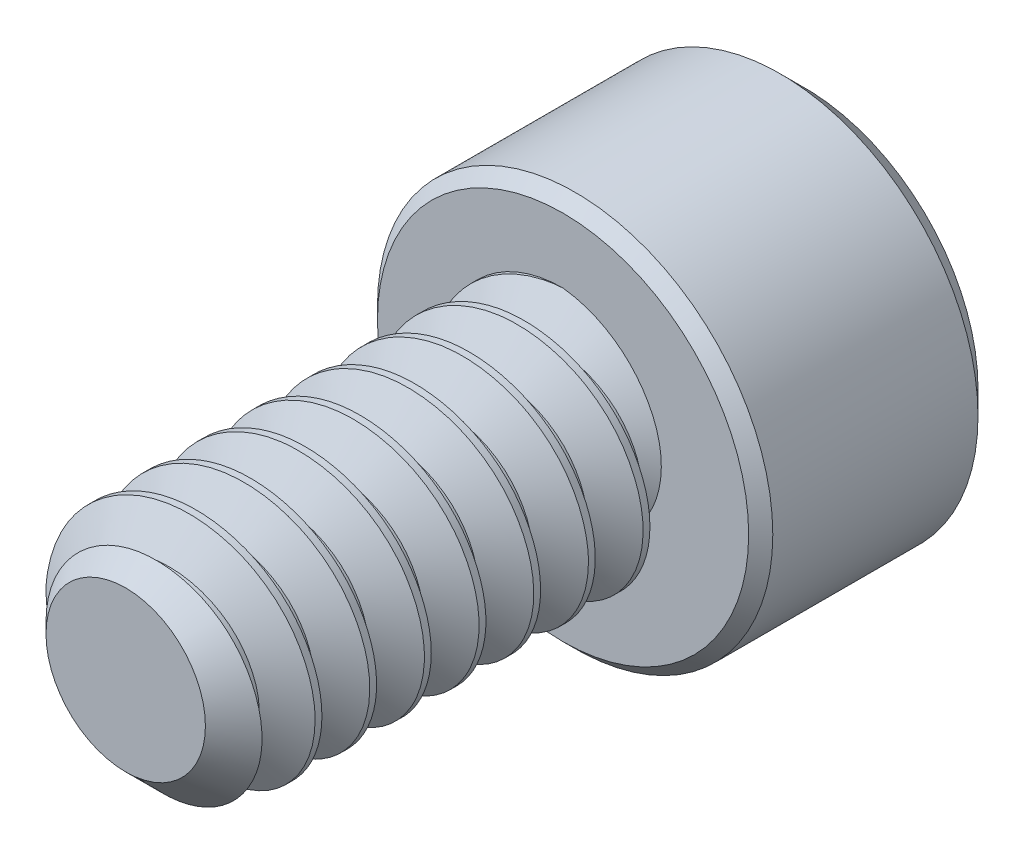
ISO-10303-21;
HEADER;
FILE_DESCRIPTION(('STEP AP214'),'2;1');
FILE_NAME('part.step','',(''),(''),'','','');
FILE_SCHEMA(('AUTOMOTIVE_DESIGN { 1 0 10303 214 1 1 1 1 }'));
ENDSEC;
DATA;
#1=APPLICATION_CONTEXT('core data for automotive mechanical design processes');
#2=APPLICATION_PROTOCOL_DEFINITION('international standard','automotive_design',2000,#1);
#3=PRODUCT_CONTEXT('',#1,'mechanical');
#4=PRODUCT('Part','Part','',(#3));
#5=PRODUCT_RELATED_PRODUCT_CATEGORY('part','',(#4));
#6=PRODUCT_DEFINITION_FORMATION('','',#4);
#7=PRODUCT_DEFINITION_CONTEXT('part definition',#1,'design');
#8=PRODUCT_DEFINITION('design','',#6,#7);
#9=PRODUCT_DEFINITION_SHAPE('','',#8);
#10=(LENGTH_UNIT() NAMED_UNIT(*) SI_UNIT(.MILLI.,.METRE.));
#11=(NAMED_UNIT(*) PLANE_ANGLE_UNIT() SI_UNIT($,.RADIAN.));
#12=(NAMED_UNIT(*) SI_UNIT($,.STERADIAN.) SOLID_ANGLE_UNIT());
#13=UNCERTAINTY_MEASURE_WITH_UNIT(LENGTH_MEASURE(1.E-05),#10,'distance_accuracy_value','');
#14=(GEOMETRIC_REPRESENTATION_CONTEXT(3) GLOBAL_UNCERTAINTY_ASSIGNED_CONTEXT((#13)) GLOBAL_UNIT_ASSIGNED_CONTEXT((#10,
#11,#12)) REPRESENTATION_CONTEXT('',''));
#15=CARTESIAN_POINT('',(0.,0.,0.));
#16=DIRECTION('',(0.,0.,1.));
#17=DIRECTION('',(1.,0.,0.));
#18=AXIS2_PLACEMENT_3D('',#15,#16,#17);
#19=CARTESIAN_POINT('',(0.,0.,-6.35));
#20=DIRECTION('',(0.,0.,1.));
#21=DIRECTION('',(1.,0.,0.));
#22=AXIS2_PLACEMENT_3D('',#19,#20,#21);
#23=CYLINDRICAL_SURFACE('',#22,1.7526);
#24=CARTESIAN_POINT('',(0.,1.7526,0.));
#25=CARTESIAN_POINT('',(1.01186408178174,1.7526,-0.0661458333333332));
#26=CARTESIAN_POINT('',(1.51779612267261,0.8763,-0.132291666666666));
#27=CARTESIAN_POINT('',(2.02372816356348,0.,-0.1984375));
#28=CARTESIAN_POINT('',(1.51779612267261,-0.8763,-0.264583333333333));
#29=CARTESIAN_POINT('',(1.01186408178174,-1.7526,-0.330729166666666));
#30=CARTESIAN_POINT('',(0.,-1.7526,-0.396874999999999));
#31=CARTESIAN_POINT('',(-1.01186408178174,-1.7526,-0.463020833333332));
#32=CARTESIAN_POINT('',(-1.51779612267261,-0.876300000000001,-0.529166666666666));
#33=CARTESIAN_POINT('',(-2.02372816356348,0.,-0.595312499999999));
#34=CARTESIAN_POINT('',(-1.51779612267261,0.876299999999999,-0.661458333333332));
#35=CARTESIAN_POINT('',(-1.01186408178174,1.7526,-0.727604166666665));
#36=CARTESIAN_POINT('',(0.,1.7526,-0.793749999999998));
#37=CARTESIAN_POINT('',(1.01186408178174,1.7526,-0.859895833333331));
#38=CARTESIAN_POINT('',(1.51779612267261,0.876300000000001,-0.926041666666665));
#39=CARTESIAN_POINT('',(2.02372816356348,0.,-0.992187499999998));
#40=CARTESIAN_POINT('',(1.51779612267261,-0.876299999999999,-1.05833333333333));
#41=CARTESIAN_POINT('',(1.01186408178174,-1.7526,-1.12447916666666));
#42=CARTESIAN_POINT('',(0.,-1.7526,-1.190625));
#43=CARTESIAN_POINT('',(-1.01186408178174,-1.7526,-1.25677083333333));
#44=CARTESIAN_POINT('',(-1.51779612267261,-0.876300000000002,-1.32291666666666));
#45=CARTESIAN_POINT('',(-2.02372816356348,0.,-1.3890625));
#46=CARTESIAN_POINT('',(-1.51779612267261,0.876299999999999,-1.45520833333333));
#47=CARTESIAN_POINT('',(-1.01186408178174,1.7526,-1.52135416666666));
#48=CARTESIAN_POINT('',(0.,1.7526,-1.5875));
#49=CARTESIAN_POINT('',(1.01186408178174,1.7526,-1.65364583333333));
#50=CARTESIAN_POINT('',(1.51779612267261,0.876300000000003,-1.71979166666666));
#51=CARTESIAN_POINT('',(2.02372816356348,0.,-1.7859375));
#52=CARTESIAN_POINT('',(1.51779612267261,-0.876299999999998,-1.85208333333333));
#53=CARTESIAN_POINT('',(1.01186408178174,-1.7526,-1.91822916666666));
#54=CARTESIAN_POINT('',(0.,-1.7526,-1.984375));
#55=CARTESIAN_POINT('',(-1.01186408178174,-1.7526,-2.05052083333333));
#56=CARTESIAN_POINT('',(-1.51779612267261,-0.876300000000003,-2.11666666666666));
#57=CARTESIAN_POINT('',(-2.02372816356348,0.,-2.18281249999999));
#58=CARTESIAN_POINT('',(-1.51779612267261,0.876299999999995,-2.24895833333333));
#59=CARTESIAN_POINT('',(-1.01186408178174,1.7526,-2.31510416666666));
#60=CARTESIAN_POINT('',(0.,1.7526,-2.38124999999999));
#61=CARTESIAN_POINT('',(1.01186408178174,1.7526,-2.44739583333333));
#62=CARTESIAN_POINT('',(1.51779612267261,0.876300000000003,-2.51354166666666));
#63=CARTESIAN_POINT('',(2.02372816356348,0.,-2.57968749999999));
#64=CARTESIAN_POINT('',(1.51779612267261,-0.876299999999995,-2.64583333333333));
#65=CARTESIAN_POINT('',(1.01186408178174,-1.7526,-2.71197916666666));
#66=CARTESIAN_POINT('',(0.,-1.7526,-2.77812499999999));
#67=CARTESIAN_POINT('',(-1.01186408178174,-1.7526,-2.84427083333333));
#68=CARTESIAN_POINT('',(-1.51779612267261,-0.876300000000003,-2.91041666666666));
#69=CARTESIAN_POINT('',(-2.02372816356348,0.,-2.97656249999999));
#70=CARTESIAN_POINT('',(-1.51779612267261,0.876299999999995,-3.04270833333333));
#71=CARTESIAN_POINT('',(-1.01186408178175,1.7526,-3.10885416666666));
#72=CARTESIAN_POINT('',(0.,1.7526,-3.17499999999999));
#73=CARTESIAN_POINT('',(1.01186408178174,1.7526,-3.24114583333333));
#74=CARTESIAN_POINT('',(1.51779612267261,0.876300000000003,-3.30729166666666));
#75=CARTESIAN_POINT('',(2.02372816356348,0.,-3.37343749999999));
#76=CARTESIAN_POINT('',(1.51779612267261,-0.876299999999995,-3.43958333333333));
#77=CARTESIAN_POINT('',(1.01186408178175,-1.7526,-3.50572916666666));
#78=CARTESIAN_POINT('',(0.,-1.7526,-3.57187499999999));
#79=CARTESIAN_POINT('',(-1.01186408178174,-1.7526,-3.63802083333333));
#80=CARTESIAN_POINT('',(-1.51779612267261,-0.876300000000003,-3.70416666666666));
#81=CARTESIAN_POINT('',(-2.02372816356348,0.,-3.77031249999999));
#82=CARTESIAN_POINT('',(-1.51779612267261,0.876299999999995,-3.83645833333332));
#83=CARTESIAN_POINT('',(-1.01186408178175,1.7526,-3.90260416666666));
#84=CARTESIAN_POINT('',(0.,1.7526,-3.96874999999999));
#85=CARTESIAN_POINT('',(1.01186408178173,1.7526,-4.03489583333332));
#86=CARTESIAN_POINT('',(1.51779612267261,0.876300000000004,-4.10104166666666));
#87=CARTESIAN_POINT('',(2.02372816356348,0.,-4.16718749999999));
#88=CARTESIAN_POINT('',(1.51779612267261,-0.876299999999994,-4.23333333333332));
#89=CARTESIAN_POINT('',(1.01186408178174,-1.7526,-4.29947916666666));
#90=CARTESIAN_POINT('',(0.,-1.7526,-4.36562499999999));
#91=CARTESIAN_POINT('',(-1.01186408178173,-1.7526,-4.43177083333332));
#92=CARTESIAN_POINT('',(-1.5177961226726,-0.876300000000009,-4.49791666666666));
#93=CARTESIAN_POINT('',(-2.02372816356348,0.,-4.56406249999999));
#94=CARTESIAN_POINT('',(-1.51779612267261,0.876299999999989,-4.63020833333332));
#95=CARTESIAN_POINT('',(-1.01186408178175,1.7526,-4.69635416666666));
#96=CARTESIAN_POINT('',(0.,1.7526,-4.76249999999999));
#97=CARTESIAN_POINT('',(1.01186408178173,1.75260000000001,-4.82864583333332));
#98=CARTESIAN_POINT('',(1.5177961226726,0.876300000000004,-4.89479166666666));
#99=CARTESIAN_POINT('',(2.02372816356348,0.,-4.96093749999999));
#100=CARTESIAN_POINT('',(1.51779612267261,-0.876299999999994,-5.02708333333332));
#101=CARTESIAN_POINT('',(1.01186408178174,-1.7526,-5.09322916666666));
#102=CARTESIAN_POINT('',(0.,-1.7526,-5.15937499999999));
#103=CARTESIAN_POINT('',(-1.01186408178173,-1.7526,-5.22552083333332));
#104=CARTESIAN_POINT('',(-1.5177961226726,-0.87630000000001,-5.29166666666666));
#105=CARTESIAN_POINT('',(-2.02372816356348,0.,-5.35781249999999));
#106=CARTESIAN_POINT('',(-1.51779612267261,0.876299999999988,-5.42395833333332));
#107=CARTESIAN_POINT('',(-1.01186408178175,1.7526,-5.49010416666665));
#108=CARTESIAN_POINT('',(0.,1.7526,-5.55624999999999));
#109=CARTESIAN_POINT('',(1.01186408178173,1.75260000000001,-5.62239583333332));
#110=CARTESIAN_POINT('',(1.5177961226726,0.876300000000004,-5.68854166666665));
#111=CARTESIAN_POINT('',(2.02372816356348,0.,-5.75468749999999));
#112=CARTESIAN_POINT('',(1.51779612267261,-0.876299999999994,-5.82083333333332));
#113=CARTESIAN_POINT('',(1.01186408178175,-1.75259999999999,-5.88697916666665));
#114=CARTESIAN_POINT('',(0.,-1.7526,-5.95312499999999));
#115=CARTESIAN_POINT('',(-1.01186408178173,-1.7526,-6.01927083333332));
#116=CARTESIAN_POINT('',(-1.5177961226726,-0.87630000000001,-6.08541666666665));
#117=CARTESIAN_POINT('',(-2.02372816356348,0.,-6.15156249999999));
#118=CARTESIAN_POINT('',(-1.51779612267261,0.876299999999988,-6.21770833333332));
#119=CARTESIAN_POINT('',(-1.01186408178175,1.75259999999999,-6.28385416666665));
#120=CARTESIAN_POINT('',(0.,1.7526,-6.34999999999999));
#121=CARTESIAN_POINT('',(1.01186408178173,1.75260000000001,-6.41614583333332));
#122=CARTESIAN_POINT('',(1.5177961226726,0.876300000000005,-6.48229166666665));
#123=CARTESIAN_POINT('',(2.02372816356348,0.,-6.54843749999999));
#124=CARTESIAN_POINT('',(1.51779612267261,-0.876299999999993,-6.61458333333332));
#125=CARTESIAN_POINT('',(1.01186408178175,-1.75259999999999,-6.68072916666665));
#126=CARTESIAN_POINT('',(0.,-1.7526,-6.74687499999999));
#127=CARTESIAN_POINT('',(-1.01186408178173,-1.7526,-6.81302083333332));
#128=CARTESIAN_POINT('',(-1.5177961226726,-0.876300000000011,-6.87916666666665));
#129=CARTESIAN_POINT('',(-2.02372816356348,0.,-6.94531249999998));
#130=CARTESIAN_POINT('',(-1.51779612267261,0.876299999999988,-7.01145833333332));
#131=CARTESIAN_POINT('',(-1.01186408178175,1.75259999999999,-7.07760416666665));
#132=CARTESIAN_POINT('',(0.,1.7526,-7.14374999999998));
#133=CARTESIAN_POINT('',(1.01186408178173,1.75260000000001,-7.20989583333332));
#134=CARTESIAN_POINT('',(1.5177961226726,0.876300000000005,-7.27604166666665));
#135=CARTESIAN_POINT('',(2.02372816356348,0.,-7.34218749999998));
#136=CARTESIAN_POINT('',(1.51779612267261,-0.876299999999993,-7.40833333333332));
#137=CARTESIAN_POINT('',(1.01186408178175,-1.75259999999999,-7.47447916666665));
#138=CARTESIAN_POINT('',(0.,-1.7526,-7.54062499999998));
#139=CARTESIAN_POINT('',(-1.01186408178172,-1.75260000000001,-7.60677083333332));
#140=CARTESIAN_POINT('',(-1.5177961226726,-0.876300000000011,-7.67291666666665));
#141=CARTESIAN_POINT('',(-2.02372816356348,0.,-7.73906249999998));
#142=CARTESIAN_POINT('',(-1.51779612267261,0.876299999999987,-7.80520833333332));
#143=CARTESIAN_POINT('',(-1.01186408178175,1.75259999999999,-7.87135416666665));
#144=CARTESIAN_POINT('',(0.,1.7526,-7.93749999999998));
#145=(BOUNDED_CURVE() B_SPLINE_CURVE(2,(#24,#25,#26,#27,#28,#29,#30,#31,#32,#33,#34,#35,#36,#37,
#38,#39,#40,#41,#42,#43,#44,#45,#46,#47,#48,#49,#50,#51,#52,#53,#54,#55,#56,#57,#58,#59,#60,#61,
#62,#63,#64,#65,#66,#67,#68,#69,#70,#71,#72,#73,#74,#75,#76,#77,#78,#79,#80,#81,#82,#83,#84,#85,
#86,#87,#88,#89,#90,#91,#92,#93,#94,#95,#96,#97,#98,#99,#100,#101,#102,#103,#104,#105,#106,#107,
#108,#109,#110,#111,#112,#113,#114,#115,#116,#117,#118,#119,#120,#121,#122,#123,#124,#125,#126,
#127,#128,#129,#130,#131,#132,#133,#134,#135,#136,#137,#138,#139,#140,#141,#142,#143,#144),
.UNSPECIFIED.,.F.,.F.) B_SPLINE_CURVE_WITH_KNOTS((3,2,2,2,2,2,2,2,2,2,2,2,2,2,2,2,2,2,2,2,2,2,2,
2,2,2,2,2,2,2,2,2,2,2,2,2,2,2,2,2,2,2,2,2,2,2,2,2,2,2,2,2,2,2,2,2,2,2,2,2,3),(0.,
0.0166666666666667,0.0333333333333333,0.05,0.0666666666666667,0.0833333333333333,0.1,
0.116666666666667,0.133333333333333,0.15,0.166666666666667,0.183333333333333,0.2,
0.216666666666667,0.233333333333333,0.25,0.266666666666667,0.283333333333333,0.3,
0.316666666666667,0.333333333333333,0.35,0.366666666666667,0.383333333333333,0.4,
0.416666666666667,0.433333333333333,0.45,0.466666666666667,0.483333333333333,0.5,
0.516666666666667,0.533333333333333,0.55,0.566666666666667,0.583333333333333,0.6,
0.616666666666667,0.633333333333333,0.65,0.666666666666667,0.683333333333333,0.7,
0.716666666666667,0.733333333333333,0.75,0.766666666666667,0.783333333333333,0.8,
0.816666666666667,0.833333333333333,0.85,0.866666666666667,0.883333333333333,0.9,
0.916666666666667,0.933333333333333,0.95,0.966666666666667,0.983333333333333,1.),
.UNSPECIFIED.) CURVE() GEOMETRIC_REPRESENTATION_ITEM() RATIONAL_B_SPLINE_CURVE((1.,
0.866025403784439,1.,0.866025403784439,1.,0.866025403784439,1.,0.866025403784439,1.,
0.866025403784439,1.,0.866025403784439,1.,0.866025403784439,1.,0.866025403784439,1.,
0.866025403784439,1.,0.866025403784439,1.,0.866025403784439,1.,0.866025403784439,1.,
0.866025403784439,1.,0.866025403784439,1.,0.866025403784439,1.,0.866025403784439,1.,
0.866025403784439,1.,0.866025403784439,1.,0.866025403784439,1.,0.866025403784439,1.,
0.866025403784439,1.,0.866025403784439,1.,0.866025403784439,1.,0.866025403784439,1.,
0.866025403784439,1.,0.866025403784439,1.,0.866025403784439,1.,0.866025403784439,1.,
0.866025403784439,1.,0.866025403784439,1.,0.866025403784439,1.,0.866025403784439,1.,
0.866025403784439,1.,0.866025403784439,1.,0.866025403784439,1.,0.866025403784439,1.,
0.866025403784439,1.,0.866025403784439,1.,0.866025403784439,1.,0.866025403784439,1.,
0.866025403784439,1.,0.866025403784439,1.,0.866025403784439,1.,0.866025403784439,1.,
0.866025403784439,1.,0.866025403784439,1.,0.866025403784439,1.,0.866025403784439,1.,
0.866025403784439,1.,0.866025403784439,1.,0.866025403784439,1.,0.866025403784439,1.,
0.866025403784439,1.,0.866025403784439,1.,0.866025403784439,1.,0.866025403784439,1.,
0.866025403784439,1.,0.866025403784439,1.,0.866025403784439,1.,0.866025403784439,1.)) REPRESENTATION_ITEM(''));
#146=CARTESIAN_POINT('',(-1.7526,0.,-0.595312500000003));
#147=VERTEX_POINT('',#146);
#148=CARTESIAN_POINT('',(0.,1.7526,-6.34999999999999));
#149=VERTEX_POINT('',#148);
#150=EDGE_CURVE('E290',#147,#149,#145,.T.);
#151=ORIENTED_EDGE('',*,*,#150,.T.);
#152=CARTESIAN_POINT('',(0.,0.,-6.35));
#153=DIRECTION('',(0.,0.,1.));
#154=DIRECTION('',(1.,0.,0.));
#155=AXIS2_PLACEMENT_3D('',#152,#153,#154);
#156=CIRCLE('',#155,1.7526);
#157=CARTESIAN_POINT('',(-1.2279228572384,1.25052477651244,-6.35));
#158=VERTEX_POINT('',#157);
#159=EDGE_CURVE('E283',#149,#158,#156,.T.);
#160=ORIENTED_EDGE('',*,*,#159,.T.);
#161=CARTESIAN_POINT('',(0.,1.7526,0.69453125));
#162=CARTESIAN_POINT('',(1.01186408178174,1.7526,0.628385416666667));
#163=CARTESIAN_POINT('',(1.51779612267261,0.8763,0.562239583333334));
#164=CARTESIAN_POINT('',(2.02372816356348,0.,0.49609375));
#165=CARTESIAN_POINT('',(1.51779612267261,-0.8763,0.429947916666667));
#166=CARTESIAN_POINT('',(1.01186408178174,-1.7526,0.363802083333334));
#167=CARTESIAN_POINT('',(0.,-1.7526,0.297656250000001));
#168=CARTESIAN_POINT('',(-1.01186408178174,-1.7526,0.231510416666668));
#169=CARTESIAN_POINT('',(-1.51779612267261,-0.876300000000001,0.165364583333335));
#170=CARTESIAN_POINT('',(-2.02372816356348,0.,0.0992187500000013));
#171=CARTESIAN_POINT('',(-1.51779612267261,0.876299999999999,0.0330729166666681));
#172=CARTESIAN_POINT('',(-1.01186408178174,1.7526,-0.0330729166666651));
#173=CARTESIAN_POINT('',(0.,1.7526,-0.0992187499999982));
#174=CARTESIAN_POINT('',(1.01186408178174,1.7526,-0.165364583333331));
#175=CARTESIAN_POINT('',(1.51779612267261,0.876300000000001,-0.231510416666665));
#176=CARTESIAN_POINT('',(2.02372816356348,0.,-0.297656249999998));
#177=CARTESIAN_POINT('',(1.51779612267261,-0.876299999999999,-0.363802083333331));
#178=CARTESIAN_POINT('',(1.01186408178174,-1.7526,-0.429947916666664));
#179=CARTESIAN_POINT('',(0.,-1.7526,-0.496093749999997));
#180=CARTESIAN_POINT('',(-1.01186408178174,-1.7526,-0.562239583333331));
#181=CARTESIAN_POINT('',(-1.51779612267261,-0.876300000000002,-0.628385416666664));
#182=CARTESIAN_POINT('',(-2.02372816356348,0.,-0.694531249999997));
#183=CARTESIAN_POINT('',(-1.51779612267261,0.876299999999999,-0.76067708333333));
#184=CARTESIAN_POINT('',(-1.01186408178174,1.7526,-0.826822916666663));
#185=CARTESIAN_POINT('',(0.,1.7526,-0.892968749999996));
#186=CARTESIAN_POINT('',(1.01186408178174,1.7526,-0.95911458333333));
#187=CARTESIAN_POINT('',(1.51779612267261,0.876300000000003,-1.02526041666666));
#188=CARTESIAN_POINT('',(2.02372816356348,0.,-1.09140625));
#189=CARTESIAN_POINT('',(1.51779612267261,-0.876299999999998,-1.15755208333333));
#190=CARTESIAN_POINT('',(1.01186408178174,-1.7526,-1.22369791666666));
#191=CARTESIAN_POINT('',(0.,-1.7526,-1.28984375));
#192=CARTESIAN_POINT('',(-1.01186408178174,-1.7526,-1.35598958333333));
#193=CARTESIAN_POINT('',(-1.51779612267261,-0.876300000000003,-1.42213541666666));
#194=CARTESIAN_POINT('',(-2.02372816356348,0.,-1.48828125));
#195=CARTESIAN_POINT('',(-1.51779612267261,0.876299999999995,-1.55442708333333));
#196=CARTESIAN_POINT('',(-1.01186408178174,1.7526,-1.62057291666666));
#197=CARTESIAN_POINT('',(0.,1.7526,-1.68671874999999));
#198=CARTESIAN_POINT('',(1.01186408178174,1.7526,-1.75286458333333));
#199=CARTESIAN_POINT('',(1.51779612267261,0.876300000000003,-1.81901041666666));
#200=CARTESIAN_POINT('',(2.02372816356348,0.,-1.88515624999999));
#201=CARTESIAN_POINT('',(1.51779612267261,-0.876299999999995,-1.95130208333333));
#202=CARTESIAN_POINT('',(1.01186408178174,-1.7526,-2.01744791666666));
#203=CARTESIAN_POINT('',(0.,-1.7526,-2.08359374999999));
#204=CARTESIAN_POINT('',(-1.01186408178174,-1.7526,-2.14973958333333));
#205=CARTESIAN_POINT('',(-1.51779612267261,-0.876300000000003,-2.21588541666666));
#206=CARTESIAN_POINT('',(-2.02372816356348,0.,-2.28203124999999));
#207=CARTESIAN_POINT('',(-1.51779612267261,0.876299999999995,-2.34817708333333));
#208=CARTESIAN_POINT('',(-1.01186408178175,1.7526,-2.41432291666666));
#209=CARTESIAN_POINT('',(0.,1.7526,-2.48046874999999));
#210=CARTESIAN_POINT('',(1.01186408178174,1.7526,-2.54661458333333));
#211=CARTESIAN_POINT('',(1.51779612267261,0.876300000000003,-2.61276041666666));
#212=CARTESIAN_POINT('',(2.02372816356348,0.,-2.67890624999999));
#213=CARTESIAN_POINT('',(1.51779612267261,-0.876299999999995,-2.74505208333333));
#214=CARTESIAN_POINT('',(1.01186408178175,-1.7526,-2.81119791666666));
#215=CARTESIAN_POINT('',(0.,-1.7526,-2.87734374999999));
#216=CARTESIAN_POINT('',(-1.01186408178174,-1.7526,-2.94348958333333));
#217=CARTESIAN_POINT('',(-1.51779612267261,-0.876300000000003,-3.00963541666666));
#218=CARTESIAN_POINT('',(-2.02372816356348,0.,-3.07578124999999));
#219=CARTESIAN_POINT('',(-1.51779612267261,0.876299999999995,-3.14192708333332));
#220=CARTESIAN_POINT('',(-1.01186408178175,1.7526,-3.20807291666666));
#221=CARTESIAN_POINT('',(0.,1.7526,-3.27421874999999));
#222=CARTESIAN_POINT('',(1.01186408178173,1.7526,-3.34036458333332));
#223=CARTESIAN_POINT('',(1.51779612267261,0.876300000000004,-3.40651041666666));
#224=CARTESIAN_POINT('',(2.02372816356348,0.,-3.47265624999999));
#225=CARTESIAN_POINT('',(1.51779612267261,-0.876299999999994,-3.53880208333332));
#226=CARTESIAN_POINT('',(1.01186408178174,-1.7526,-3.60494791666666));
#227=CARTESIAN_POINT('',(0.,-1.7526,-3.67109374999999));
#228=CARTESIAN_POINT('',(-1.01186408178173,-1.7526,-3.73723958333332));
#229=CARTESIAN_POINT('',(-1.5177961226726,-0.876300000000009,-3.80338541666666));
#230=CARTESIAN_POINT('',(-2.02372816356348,0.,-3.86953124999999));
#231=CARTESIAN_POINT('',(-1.51779612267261,0.876299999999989,-3.93567708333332));
#232=CARTESIAN_POINT('',(-1.01186408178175,1.7526,-4.00182291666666));
#233=CARTESIAN_POINT('',(0.,1.7526,-4.06796874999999));
#234=CARTESIAN_POINT('',(1.01186408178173,1.75260000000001,-4.13411458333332));
#235=CARTESIAN_POINT('',(1.5177961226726,0.876300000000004,-4.20026041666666));
#236=CARTESIAN_POINT('',(2.02372816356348,0.,-4.26640624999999));
#237=CARTESIAN_POINT('',(1.51779612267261,-0.876299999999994,-4.33255208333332));
#238=CARTESIAN_POINT('',(1.01186408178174,-1.7526,-4.39869791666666));
#239=CARTESIAN_POINT('',(0.,-1.7526,-4.46484374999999));
#240=CARTESIAN_POINT('',(-1.01186408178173,-1.7526,-4.53098958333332));
#241=CARTESIAN_POINT('',(-1.5177961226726,-0.87630000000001,-4.59713541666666));
#242=CARTESIAN_POINT('',(-2.02372816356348,0.,-4.66328124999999));
#243=CARTESIAN_POINT('',(-1.51779612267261,0.876299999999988,-4.72942708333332));
#244=CARTESIAN_POINT('',(-1.01186408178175,1.7526,-4.79557291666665));
#245=CARTESIAN_POINT('',(0.,1.7526,-4.86171874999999));
#246=CARTESIAN_POINT('',(1.01186408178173,1.75260000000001,-4.92786458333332));
#247=CARTESIAN_POINT('',(1.5177961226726,0.876300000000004,-4.99401041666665));
#248=CARTESIAN_POINT('',(2.02372816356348,0.,-5.06015624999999));
#249=CARTESIAN_POINT('',(1.51779612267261,-0.876299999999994,-5.12630208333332));
#250=CARTESIAN_POINT('',(1.01186408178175,-1.75259999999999,-5.19244791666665));
#251=CARTESIAN_POINT('',(0.,-1.7526,-5.25859374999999));
#252=CARTESIAN_POINT('',(-1.01186408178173,-1.7526,-5.32473958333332));
#253=CARTESIAN_POINT('',(-1.5177961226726,-0.87630000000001,-5.39088541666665));
#254=CARTESIAN_POINT('',(-2.02372816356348,0.,-5.45703124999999));
#255=CARTESIAN_POINT('',(-1.51779612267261,0.876299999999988,-5.52317708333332));
#256=CARTESIAN_POINT('',(-1.01186408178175,1.75259999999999,-5.58932291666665));
#257=CARTESIAN_POINT('',(0.,1.7526,-5.65546874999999));
#258=CARTESIAN_POINT('',(1.01186408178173,1.75260000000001,-5.72161458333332));
#259=CARTESIAN_POINT('',(1.5177961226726,0.876300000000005,-5.78776041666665));
#260=CARTESIAN_POINT('',(2.02372816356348,0.,-5.85390624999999));
#261=CARTESIAN_POINT('',(1.51779612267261,-0.876299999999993,-5.92005208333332));
#262=CARTESIAN_POINT('',(1.01186408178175,-1.75259999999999,-5.98619791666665));
#263=CARTESIAN_POINT('',(0.,-1.7526,-6.05234374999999));
#264=CARTESIAN_POINT('',(-1.01186408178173,-1.7526,-6.11848958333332));
#265=CARTESIAN_POINT('',(-1.5177961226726,-0.876300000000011,-6.18463541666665));
#266=CARTESIAN_POINT('',(-2.02372816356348,0.,-6.25078124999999));
#267=CARTESIAN_POINT('',(-1.51779612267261,0.876299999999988,-6.31692708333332));
#268=CARTESIAN_POINT('',(-1.01186408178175,1.75259999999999,-6.38307291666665));
#269=CARTESIAN_POINT('',(0.,1.7526,-6.44921874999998));
#270=CARTESIAN_POINT('',(1.01186408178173,1.75260000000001,-6.51536458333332));
#271=CARTESIAN_POINT('',(1.5177961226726,0.876300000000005,-6.58151041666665));
#272=CARTESIAN_POINT('',(2.02372816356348,0.,-6.64765624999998));
#273=CARTESIAN_POINT('',(1.51779612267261,-0.876299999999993,-6.71380208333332));
#274=CARTESIAN_POINT('',(1.01186408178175,-1.75259999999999,-6.77994791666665));
#275=CARTESIAN_POINT('',(0.,-1.7526,-6.84609374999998));
#276=CARTESIAN_POINT('',(-1.01186408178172,-1.75260000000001,-6.91223958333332));
#277=CARTESIAN_POINT('',(-1.5177961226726,-0.876300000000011,-6.97838541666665));
#278=CARTESIAN_POINT('',(-2.02372816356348,0.,-7.04453124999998));
#279=CARTESIAN_POINT('',(-1.51779612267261,0.876299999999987,-7.11067708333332));
#280=CARTESIAN_POINT('',(-1.01186408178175,1.75259999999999,-7.17682291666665));
#281=CARTESIAN_POINT('',(0.,1.7526,-7.24296874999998));
#282=(BOUNDED_CURVE() B_SPLINE_CURVE(2,(#161,#162,#163,#164,#165,#166,#167,#168,#169,#170,#171,
#172,#173,#174,#175,#176,#177,#178,#179,#180,#181,#182,#183,#184,#185,#186,#187,#188,#189,#190,
#191,#192,#193,#194,#195,#196,#197,#198,#199,#200,#201,#202,#203,#204,#205,#206,#207,#208,#209,
#210,#211,#212,#213,#214,#215,#216,#217,#218,#219,#220,#221,#222,#223,#224,#225,#226,#227,#228,
#229,#230,#231,#232,#233,#234,#235,#236,#237,#238,#239,#240,#241,#242,#243,#244,#245,#246,#247,
#248,#249,#250,#251,#252,#253,#254,#255,#256,#257,#258,#259,#260,#261,#262,#263,#264,#265,#266,
#267,#268,#269,#270,#271,#272,#273,#274,#275,#276,#277,#278,#279,#280,#281),.UNSPECIFIED.,.F.,
.F.) B_SPLINE_CURVE_WITH_KNOTS((3,2,2,2,2,2,2,2,2,2,2,2,2,2,2,2,2,2,2,2,2,2,2,2,2,2,2,2,2,2,2,2,
2,2,2,2,2,2,2,2,2,2,2,2,2,2,2,2,2,2,2,2,2,2,2,2,2,2,2,2,3),(0.,0.0166666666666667,
0.0333333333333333,0.05,0.0666666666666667,0.0833333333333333,0.1,0.116666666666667,
0.133333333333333,0.15,0.166666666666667,0.183333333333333,0.2,0.216666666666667,
0.233333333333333,0.25,0.266666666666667,0.283333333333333,0.3,0.316666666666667,
0.333333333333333,0.35,0.366666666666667,0.383333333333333,0.4,0.416666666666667,
0.433333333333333,0.45,0.466666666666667,0.483333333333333,0.5,0.516666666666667,
0.533333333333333,0.55,0.566666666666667,0.583333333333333,0.6,0.616666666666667,
0.633333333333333,0.65,0.666666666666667,0.683333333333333,0.7,0.716666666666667,
0.733333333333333,0.75,0.766666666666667,0.783333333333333,0.8,0.816666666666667,
0.833333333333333,0.85,0.866666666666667,0.883333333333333,0.9,0.916666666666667,
0.933333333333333,0.95,0.966666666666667,0.983333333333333,1.),
.UNSPECIFIED.) CURVE() GEOMETRIC_REPRESENTATION_ITEM() RATIONAL_B_SPLINE_CURVE((1.,
0.866025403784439,1.,0.866025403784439,1.,0.866025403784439,1.,0.866025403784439,1.,
0.866025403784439,1.,0.866025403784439,1.,0.866025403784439,1.,0.866025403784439,1.,
0.866025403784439,1.,0.866025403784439,1.,0.866025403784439,1.,0.866025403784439,1.,
0.866025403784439,1.,0.866025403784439,1.,0.866025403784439,1.,0.866025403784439,1.,
0.866025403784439,1.,0.866025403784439,1.,0.866025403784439,1.,0.866025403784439,1.,
0.866025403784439,1.,0.866025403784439,1.,0.866025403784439,1.,0.866025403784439,1.,
0.866025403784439,1.,0.866025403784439,1.,0.866025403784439,1.,0.866025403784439,1.,
0.866025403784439,1.,0.866025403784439,1.,0.866025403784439,1.,0.866025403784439,1.,
0.866025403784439,1.,0.866025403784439,1.,0.866025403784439,1.,0.866025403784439,1.,
0.866025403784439,1.,0.866025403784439,1.,0.866025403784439,1.,0.866025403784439,1.,
0.866025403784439,1.,0.866025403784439,1.,0.866025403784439,1.,0.866025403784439,1.,
0.866025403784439,1.,0.866025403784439,1.,0.866025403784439,1.,0.866025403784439,1.,
0.866025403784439,1.,0.866025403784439,1.,0.866025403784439,1.,0.866025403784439,1.,
0.866025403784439,1.,0.866025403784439,1.,0.866025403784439,1.,0.866025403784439,1.,
0.866025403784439,1.,0.866025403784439,1.,0.866025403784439,1.,0.866025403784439,1.)) REPRESENTATION_ITEM(''));
#283=CARTESIAN_POINT('',(-1.22792285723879,-1.25052477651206,-0.595312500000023));
#284=VERTEX_POINT('',#283);
#285=EDGE_CURVE('E271',#284,#158,#282,.T.);
#286=ORIENTED_EDGE('',*,*,#285,.F.);
#287=CARTESIAN_POINT('',(0.,0.,-0.595312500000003));
#288=DIRECTION('',(0.,0.,1.));
#289=DIRECTION('',(1.,0.,0.));
#290=AXIS2_PLACEMENT_3D('',#287,#288,#289);
#291=CIRCLE('',#290,1.7526);
#292=EDGE_CURVE('E240',#284,#147,#291,.F.);
#293=ORIENTED_EDGE('',*,*,#292,.T.);
#294=EDGE_LOOP('',(#151,#160,#286,#293));
#295=FACE_BOUND('',#294,.T.);
#296=ADVANCED_FACE('F36',(#295),#23,.T.);
#297=CARTESIAN_POINT('',(0.,0.,0.));
#298=DIRECTION('',(0.,0.,1.));
#299=DIRECTION('',(1.,0.,0.));
#300=AXIS2_PLACEMENT_3D('',#297,#298,#299);
#301=PLANE('',#300);
#302=CARTESIAN_POINT('',(0.,0.,0.));
#303=DIRECTION('',(0.,0.,1.));
#304=DIRECTION('',(1.,0.,0.));
#305=AXIS2_PLACEMENT_3D('',#302,#303,#304);
#306=CIRCLE('',#305,1.1572875);
#307=CARTESIAN_POINT('',(1.1572875,0.,0.));
#308=VERTEX_POINT('',#307);
#309=EDGE_CURVE('E284',#308,#308,#306,.T.);
#310=ORIENTED_EDGE('',*,*,#309,.T.);
#311=EDGE_LOOP('',(#310));
#312=FACE_BOUND('',#311,.T.);
#313=ADVANCED_FACE('F216',(#312),#301,.T.);
#314=CARTESIAN_POINT('',(0.,0.,0.));
#315=DIRECTION('',(0.,0.,-1.));
#316=DIRECTION('',(-1.,0.,0.));
#317=AXIS2_PLACEMENT_3D('',#314,#315,#316);
#318=CONICAL_SURFACE('',#317,1.1572875,0.785398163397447);
#319=CARTESIAN_POINT('',(-1.7526,0.,-0.595312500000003));
#320=CARTESIAN_POINT('',(-1.7439736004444,-0.0483325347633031,-0.586681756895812));
#321=CARTESIAN_POINT('',(-1.73327760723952,-0.0962842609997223,-0.577989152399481));
#322=CARTESIAN_POINT('',(-1.70785011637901,-0.191073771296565,-0.560540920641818));
#323=CARTESIAN_POINT('',(-1.69312015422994,-0.237911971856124,-0.551785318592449));
#324=CARTESIAN_POINT('',(-1.65959360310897,-0.330513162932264,-0.534197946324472));
#325=CARTESIAN_POINT('',(-1.64076668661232,-0.376265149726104,-0.525366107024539));
#326=CARTESIAN_POINT('',(-1.59924208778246,-0.466006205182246,-0.507756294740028));
#327=CARTESIAN_POINT('',(-1.57654371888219,-0.509994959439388,-0.498978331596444));
#328=CARTESIAN_POINT('',(-1.53972272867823,-0.574403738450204,-0.485908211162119));
#329=CARTESIAN_POINT('',(-1.52698337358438,-0.595615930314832,-0.481566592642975));
#330=CARTESIAN_POINT('',(-1.50060117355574,-0.637483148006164,-0.472925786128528));
#331=CARTESIAN_POINT('',(-1.48695829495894,-0.658138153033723,-0.468626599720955));
#332=CARTESIAN_POINT('',(-1.45879184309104,-0.698846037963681,-0.460076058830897));
#333=CARTESIAN_POINT('',(-1.44426831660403,-0.718898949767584,-0.455824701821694));
#334=CARTESIAN_POINT('',(-1.41437949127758,-0.758385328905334,-0.447400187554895));
#335=CARTESIAN_POINT('',(-1.39901420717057,-0.777818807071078,-0.443227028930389));
#336=CARTESIAN_POINT('',(-1.3753404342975,-0.806404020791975,-0.436983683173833));
#337=CARTESIAN_POINT('',(-1.36735710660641,-0.815824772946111,-0.434908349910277));
#338=CARTESIAN_POINT('',(-1.35114821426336,-0.834445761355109,-0.430715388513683));
#339=CARTESIAN_POINT('',(-1.34292265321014,-0.84364600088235,-0.428597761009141));
#340=CARTESIAN_POINT('',(-1.31790317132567,-0.87091965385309,-0.42219957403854));
#341=CARTESIAN_POINT('',(-1.30076459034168,-0.888668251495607,-0.417873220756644));
#342=CARTESIAN_POINT('',(-1.26561594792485,-0.923236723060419,-0.40909737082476));
#343=CARTESIAN_POINT('',(-1.24760614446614,-0.940056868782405,-0.404647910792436));
#344=CARTESIAN_POINT('',(-1.21076039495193,-0.972732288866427,-0.395633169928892));
#345=CARTESIAN_POINT('',(-1.19192441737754,-0.988587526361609,-0.391067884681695));
#346=CARTESIAN_POINT('',(-1.13758668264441,-1.03197741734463,-0.378008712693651));
#347=CARTESIAN_POINT('',(-1.1011700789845,-1.05834186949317,-0.369384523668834));
#348=CARTESIAN_POINT('',(-1.02606307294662,-1.10748014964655,-0.351811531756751));
#349=CARTESIAN_POINT('',(-0.987372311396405,-1.13025340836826,-0.342862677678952));
#350=CARTESIAN_POINT('',(-0.908013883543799,-1.17203349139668,-0.324677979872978));
#351=CARTESIAN_POINT('',(-0.867344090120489,-1.19103614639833,-0.315441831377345));
#352=CARTESIAN_POINT('',(-0.784431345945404,-1.22507335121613,-0.296747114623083));
#353=CARTESIAN_POINT('',(-0.742188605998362,-1.24010843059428,-0.287288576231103));
#354=CARTESIAN_POINT('',(-0.660566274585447,-1.26484908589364,-0.269114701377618));
#355=CARTESIAN_POINT('',(-0.621295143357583,-1.27492489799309,-0.26041396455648));
#356=CARTESIAN_POINT('',(-0.542051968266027,-1.29164757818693,-0.242930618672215));
#357=CARTESIAN_POINT('',(-0.50208001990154,-1.29829490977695,-0.234148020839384));
#358=CARTESIAN_POINT('',(-0.421770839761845,-1.30810792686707,-0.216568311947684));
#359=CARTESIAN_POINT('',(-0.381434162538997,-1.31127821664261,-0.20777123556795));
#360=CARTESIAN_POINT('',(-0.300621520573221,-1.31413047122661,-0.190211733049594));
#361=CARTESIAN_POINT('',(-0.260145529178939,-1.31381172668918,-0.181449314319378));
#362=CARTESIAN_POINT('',(-0.183795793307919,-1.30991529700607,-0.164992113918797));
#363=CARTESIAN_POINT('',(-0.147905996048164,-1.30670028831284,-0.157286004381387));
#364=CARTESIAN_POINT('',(-0.0943313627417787,-1.2998215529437,-0.145833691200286));
#365=CARTESIAN_POINT('',(-0.0765202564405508,-1.29718671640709,-0.142034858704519));
#366=CARTESIAN_POINT('',(-0.0409995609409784,-1.29124158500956,-0.134484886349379));
#367=CARTESIAN_POINT('',(-0.023289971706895,-1.28793129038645,-0.130733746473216));
#368=CARTESIAN_POINT('',(0.00318657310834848,-1.28244109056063,-0.125127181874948));
#369=CARTESIAN_POINT('',(0.0120055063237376,-1.28052155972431,-0.123259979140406));
#370=CARTESIAN_POINT('',(0.0295855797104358,-1.27646535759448,-0.119490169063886));
#371=CARTESIAN_POINT('',(0.0383467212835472,-1.27432869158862,-0.117587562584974));
#372=CARTESIAN_POINT('',(0.0645405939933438,-1.26760928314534,-0.111841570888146));
#373=CARTESIAN_POINT('',(0.0818863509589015,-1.26271659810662,-0.107959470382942));
#374=CARTESIAN_POINT('',(0.116325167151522,-1.25210211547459,-0.100083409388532));
#375=CARTESIAN_POINT('',(0.133417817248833,-1.24637910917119,-0.0960892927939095));
#376=CARTESIAN_POINT('',(0.167292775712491,-1.23412252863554,-0.0879983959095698));
#377=CARTESIAN_POINT('',(0.184074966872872,-1.22758865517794,-0.0839015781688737));
#378=CARTESIAN_POINT('',(0.200679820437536,-1.22065805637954,-0.0797567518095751));
#379=B_SPLINE_CURVE_WITH_KNOTS('',3,(#319,#320,#321,#322,#323,#324,#325,#326,#327,#328,#329,
#330,#331,#332,#333,#334,#335,#336,#337,#338,#339,#340,#341,#342,#343,#344,#345,#346,#347,#348,
#349,#350,#351,#352,#353,#354,#355,#356,#357,#358,#359,#360,#361,#362,#363,#364,#365,#366,#367,
#368,#369,#370,#371,#372,#373,#374,#375,#376,#377,#378),.UNSPECIFIED.,.F.,.F.,(4,2,2,2,2,2,2,2,
2,2,2,2,2,2,2,2,2,2,2,2,2,2,2,2,2,2,2,2,2,4),(0.,0.14950342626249,0.298950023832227,
0.44954299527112,0.60016270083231,0.675509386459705,0.75085888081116,0.826204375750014,
0.901548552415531,0.939109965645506,0.976670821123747,1.05178366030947,1.12687439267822,
1.20196799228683,1.33908761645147,1.47622895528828,1.61352110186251,1.75079491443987,
1.87504851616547,1.99928531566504,2.12335740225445,2.24745471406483,2.35788879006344,
2.41308235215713,2.46827589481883,2.49592349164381,2.52357041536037,2.57885620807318,
2.63422330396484,2.68961089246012),.UNSPECIFIED.);
#380=CARTESIAN_POINT('',(0.200679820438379,-1.2206580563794,-0.0797567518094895));
#381=VERTEX_POINT('',#380);
#382=EDGE_CURVE('E134',#147,#381,#379,.T.);
#383=ORIENTED_EDGE('',*,*,#382,.F.);
#384=ORIENTED_EDGE('',*,*,#292,.F.);
#385=CARTESIAN_POINT('',(-0.725462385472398,-1.00198942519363,-0.0797567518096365));
#386=CARTESIAN_POINT('',(-0.754789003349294,-0.983628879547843,-0.0820853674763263));
#387=CARTESIAN_POINT('',(-0.783320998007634,-0.964039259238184,-0.0843951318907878));
#388=CARTESIAN_POINT('',(-0.838642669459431,-0.922509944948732,-0.0889675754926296));
#389=CARTESIAN_POINT('',(-0.865431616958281,-0.90056927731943,-0.0912302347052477));
#390=CARTESIAN_POINT('',(-0.942699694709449,-0.831602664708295,-0.0979116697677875));
#391=CARTESIAN_POINT('',(-0.990331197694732,-0.781274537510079,-0.102243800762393));
#392=CARTESIAN_POINT('',(-1.05486680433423,-0.700397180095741,-0.108456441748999));
#393=CARTESIAN_POINT('',(-1.07523143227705,-0.672532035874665,-0.110480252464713));
#394=CARTESIAN_POINT('',(-1.10398711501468,-0.629527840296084,-0.113459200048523));
#395=CARTESIAN_POINT('',(-1.11327478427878,-0.614990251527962,-0.114442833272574));
#396=CARTESIAN_POINT('',(-1.13127694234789,-0.585565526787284,-0.116438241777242));
#397=CARTESIAN_POINT('',(-1.13999130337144,-0.570678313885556,-0.117450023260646));
#398=CARTESIAN_POINT('',(-1.18206880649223,-0.495411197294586,-0.122549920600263));
#399=CARTESIAN_POINT('',(-1.21099619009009,-0.432463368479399,-0.126766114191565));
#400=CARTESIAN_POINT('',(-1.2597236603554,-0.299678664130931,-0.135571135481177));
#401=CARTESIAN_POINT('',(-1.27900988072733,-0.229655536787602,-0.140168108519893));
#402=CARTESIAN_POINT('',(-1.30576604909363,-0.0873925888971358,-0.149404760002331));
#403=CARTESIAN_POINT('',(-1.31323630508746,-0.0151528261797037,-0.154044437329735));
#404=CARTESIAN_POINT('',(-1.31616649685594,0.131022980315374,-0.163334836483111));
#405=CARTESIAN_POINT('',(-1.31138992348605,0.20496468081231,-0.167984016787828));
#406=CARTESIAN_POINT('',(-1.29497388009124,0.314410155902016,-0.17479684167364));
#407=CARTESIAN_POINT('',(-1.2879559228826,0.350659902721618,-0.17704171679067));
#408=CARTESIAN_POINT('',(-1.27088694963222,0.422448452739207,-0.181466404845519));
#409=CARTESIAN_POINT('',(-1.26083617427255,0.457987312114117,-0.183646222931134));
#410=CARTESIAN_POINT('',(-1.23777926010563,0.528062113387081,-0.187923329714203));
#411=CARTESIAN_POINT('',(-1.22477597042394,0.562598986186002,-0.190020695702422));
#412=CARTESIAN_POINT('',(-1.2031292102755,0.613489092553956,-0.193101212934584));
#413=CARTESIAN_POINT('',(-1.1955554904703,0.630302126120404,-0.194117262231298));
#414=CARTESIAN_POINT('',(-1.1796995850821,0.663592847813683,-0.196118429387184));
#415=CARTESIAN_POINT('',(-1.17141737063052,0.680070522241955,-0.197103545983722));
#416=CARTESIAN_POINT('',(-1.14559505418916,0.729001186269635,-0.200090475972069));
#417=CARTESIAN_POINT('',(-1.12708168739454,0.760946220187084,-0.202123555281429));
#418=CARTESIAN_POINT('',(-1.08759203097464,0.823255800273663,-0.206254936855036));
#419=CARTESIAN_POINT('',(-1.06661570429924,0.853620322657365,-0.208353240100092));
#420=CARTESIAN_POINT('',(-0.998689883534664,0.94403520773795,-0.214867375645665));
#421=CARTESIAN_POINT('',(-0.947876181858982,1.00125079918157,-0.219370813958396));
#422=CARTESIAN_POINT('',(-0.837618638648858,1.10657334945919,-0.228465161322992));
#423=CARTESIAN_POINT('',(-0.778175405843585,1.15468095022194,-0.233056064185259));
#424=CARTESIAN_POINT('',(-0.650338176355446,1.241836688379,-0.242340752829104));
#425=CARTESIAN_POINT('',(-0.581729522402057,1.28057055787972,-0.247033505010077));
#426=CARTESIAN_POINT('',(-0.438940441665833,1.34594803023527,-0.256257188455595));
#427=CARTESIAN_POINT('',(-0.364761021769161,1.37259381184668,-0.260788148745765));
#428=CARTESIAN_POINT('',(-0.251016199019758,1.40291614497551,-0.267367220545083));
#429=CARTESIAN_POINT('',(-0.212680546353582,1.41141661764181,-0.269524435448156));
#430=CARTESIAN_POINT('',(-0.135416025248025,1.42516447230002,-0.273760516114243));
#431=CARTESIAN_POINT('',(-0.0964871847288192,1.43041200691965,-0.275839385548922));
#432=CARTESIAN_POINT('',(-0.0183123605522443,1.43759253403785,-0.279886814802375));
#433=CARTESIAN_POINT('',(0.0209337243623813,1.43952442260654,-0.281855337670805));
#434=CARTESIAN_POINT('',(0.0994518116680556,1.44027925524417,-0.285888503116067));
#435=CARTESIAN_POINT('',(0.138723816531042,1.43910183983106,-0.287953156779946));
#436=CARTESIAN_POINT('',(0.217853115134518,1.43356367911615,-0.292183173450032));
#437=CARTESIAN_POINT('',(0.257705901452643,1.42913816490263,-0.294349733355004));
#438=CARTESIAN_POINT('',(0.336905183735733,1.41707153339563,-0.298732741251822));
#439=CARTESIAN_POINT('',(0.376251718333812,1.40943066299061,-0.300949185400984));
#440=CARTESIAN_POINT('',(0.493153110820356,1.38174381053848,-0.307648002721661));
#441=CARTESIAN_POINT('',(0.569632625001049,1.3569291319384,-0.312183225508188));
#442=CARTESIAN_POINT('',(0.72040568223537,1.29404805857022,-0.321439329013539));
#443=CARTESIAN_POINT('',(0.794499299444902,1.25550488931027,-0.326160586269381));
#444=CARTESIAN_POINT('',(0.935145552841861,1.16651923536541,-0.335482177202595));
#445=CARTESIAN_POINT('',(1.00169944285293,1.11607873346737,-0.340082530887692));
#446=CARTESIAN_POINT('',(1.12539980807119,1.00469508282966,-0.349045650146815));
#447=CARTESIAN_POINT('',(1.18254808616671,0.943753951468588,-0.353408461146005));
#448=CARTESIAN_POINT('',(1.25995491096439,0.845842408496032,-0.359683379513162));
#449=CARTESIAN_POINT('',(1.28438260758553,0.812101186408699,-0.361731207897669));
#450=CARTESIAN_POINT('',(1.31883509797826,0.760037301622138,-0.364734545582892));
#451=CARTESIAN_POINT('',(1.32995545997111,0.742438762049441,-0.365724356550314));
#452=CARTESIAN_POINT('',(1.35149282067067,0.706813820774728,-0.367732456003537));
#453=CARTESIAN_POINT('',(1.36190964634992,0.688787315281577,-0.368750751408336));
#454=CARTESIAN_POINT('',(1.39224972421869,0.633767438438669,-0.371849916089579));
#455=CARTESIAN_POINT('',(1.41105435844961,0.596148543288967,-0.373957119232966));
#456=CARTESIAN_POINT('',(1.44557215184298,0.519525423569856,-0.378232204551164));
#457=CARTESIAN_POINT('',(1.46128440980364,0.480520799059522,-0.380400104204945));
#458=CARTESIAN_POINT('',(1.50361040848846,0.361808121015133,-0.386968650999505));
#459=CARTESIAN_POINT('',(1.52544855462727,0.280337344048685,-0.391437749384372));
#460=CARTESIAN_POINT('',(1.55643686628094,0.111154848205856,-0.400636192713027));
#461=CARTESIAN_POINT('',(1.56495239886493,0.0233288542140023,-0.405368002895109));
#462=CARTESIAN_POINT('',(1.5670847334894,-0.152551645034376,-0.414758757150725));
#463=CARTESIAN_POINT('',(1.56070336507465,-0.240606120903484,-0.419417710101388));
#464=CARTESIAN_POINT('',(1.54012844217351,-0.370859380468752,-0.426251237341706));
#465=CARTESIAN_POINT('',(1.53142997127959,-0.413991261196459,-0.428504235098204));
#466=CARTESIAN_POINT('',(1.51042706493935,-0.499379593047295,-0.432946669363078));
#467=CARTESIAN_POINT('',(1.49812285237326,-0.541636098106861,-0.435136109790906));
#468=CARTESIAN_POINT('',(1.4699881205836,-0.62497243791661,-0.439435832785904));
#469=CARTESIAN_POINT('',(1.4541570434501,-0.66605208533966,-0.44154610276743));
#470=CARTESIAN_POINT('',(1.42786190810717,-0.72655745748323,-0.444646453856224));
#471=CARTESIAN_POINT('',(1.41867071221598,-0.746542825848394,-0.445669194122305));
#472=CARTESIAN_POINT('',(1.39944668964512,-0.786106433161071,-0.447683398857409));
#473=CARTESIAN_POINT('',(1.38941383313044,-0.80568465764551,-0.448674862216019));
#474=CARTESIAN_POINT('',(1.35814483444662,-0.863801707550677,-0.451681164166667));
#475=CARTESIAN_POINT('',(1.3357398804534,-0.901719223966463,-0.453727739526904));
#476=CARTESIAN_POINT('',(1.28797811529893,-0.975623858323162,-0.457889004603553));
#477=CARTESIAN_POINT('',(1.26262134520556,-1.01161100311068,-0.460003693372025));
#478=CARTESIAN_POINT('',(1.18233812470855,-1.1163500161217,-0.466428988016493));
#479=CARTESIAN_POINT('',(1.1231745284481,-1.18192442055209,-0.470823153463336));
#480=CARTESIAN_POINT('',(0.991768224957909,-1.30594068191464,-0.479940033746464));
#481=CARTESIAN_POINT('',(0.919000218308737,-1.36382382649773,-0.484667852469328));
#482=CARTESIAN_POINT('',(0.764783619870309,-1.46653429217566,-0.494092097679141));
#483=CARTESIAN_POINT('',(0.683335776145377,-1.51136273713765,-0.498788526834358));
#484=CARTESIAN_POINT('',(0.5140030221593,-1.5867017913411,-0.508025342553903));
#485=CARTESIAN_POINT('',(0.426117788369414,-1.61721168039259,-0.512565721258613));
#486=CARTESIAN_POINT('',(0.291473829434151,-1.65156859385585,-0.519162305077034));
#487=CARTESIAN_POINT('',(0.246102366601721,-1.66112128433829,-0.521326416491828));
#488=CARTESIAN_POINT('',(0.154700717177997,-1.67637509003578,-0.525575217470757));
#489=CARTESIAN_POINT('',(0.10867055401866,-1.68207634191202,-0.527659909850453));
#490=CARTESIAN_POINT('',(0.0163785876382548,-1.68955953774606,-0.531719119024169));
#491=CARTESIAN_POINT('',(-0.0298826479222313,-1.69134853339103,-0.533693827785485));
#492=CARTESIAN_POINT('',(-0.122396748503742,-1.69123909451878,-0.53774476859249));
#493=CARTESIAN_POINT('',(-0.168649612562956,-1.68934036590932,-0.539821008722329));
#494=CARTESIAN_POINT('',(-0.260878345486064,-1.68183478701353,-0.544032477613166));
#495=CARTESIAN_POINT('',(-0.306854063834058,-1.67622607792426,-0.546167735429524));
#496=CARTESIAN_POINT('',(-0.398192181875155,-1.66134869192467,-0.550488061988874));
#497=CARTESIAN_POINT('',(-0.443554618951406,-1.65208023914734,-0.552673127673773));
#498=CARTESIAN_POINT('',(-0.582466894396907,-1.61782719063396,-0.559482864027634));
#499=CARTESIAN_POINT('',(-0.674581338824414,-1.5867295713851,-0.564167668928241));
#500=CARTESIAN_POINT('',(-0.852198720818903,-1.50959610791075,-0.573544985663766));
#501=CARTESIAN_POINT('',(-0.937709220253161,-1.46357767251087,-0.578237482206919));
#502=CARTESIAN_POINT('',(-1.05558999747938,-1.38677674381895,-0.584975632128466));
#503=CARTESIAN_POINT('',(-1.09153461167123,-1.36134911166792,-0.587070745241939));
#504=CARTESIAN_POINT('',(-1.16132536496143,-1.30787325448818,-0.591222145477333));
#505=CARTESIAN_POINT('',(-1.19517491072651,-1.27982948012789,-0.593278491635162));
#506=CARTESIAN_POINT('',(-1.2279228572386,-1.25052477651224,-0.595312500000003));
#507=B_SPLINE_CURVE_WITH_KNOTS('',3,(#385,#386,#387,#388,#389,#390,#391,#392,#393,#394,#395,
#396,#397,#398,#399,#400,#401,#402,#403,#404,#405,#406,#407,#408,#409,#410,#411,#412,#413,#414,
#415,#416,#417,#418,#419,#420,#421,#422,#423,#424,#425,#426,#427,#428,#429,#430,#431,#432,#433,
#434,#435,#436,#437,#438,#439,#440,#441,#442,#443,#444,#445,#446,#447,#448,#449,#450,#451,#452,
#453,#454,#455,#456,#457,#458,#459,#460,#461,#462,#463,#464,#465,#466,#467,#468,#469,#470,#471,
#472,#473,#474,#475,#476,#477,#478,#479,#480,#481,#482,#483,#484,#485,#486,#487,#488,#489,#490,
#491,#492,#493,#494,#495,#496,#497,#498,#499,#500,#501,#502,#503,#504,#505,#506),.UNSPECIFIED.,
.F.,.F.,(4,2,2,2,2,2,2,2,2,2,2,2,2,2,2,2,2,2,2,2,2,2,2,2,2,2,2,2,2,2,2,2,2,2,2,2,2,2,2,2,2,2,2,
2,2,2,2,2,2,2,2,2,2,2,2,2,2,2,2,2,4),(0.,0.103958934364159,0.20796108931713,0.415084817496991,
0.518704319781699,0.570526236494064,0.622359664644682,0.82960490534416,1.04695617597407,
1.2643017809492,1.48587621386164,1.59674108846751,1.70759716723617,1.81834672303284,
1.8737363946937,1.9291283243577,2.03993043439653,2.15073421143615,2.37957564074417,
2.60840093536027,2.84407541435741,3.07970739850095,3.19757162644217,3.31543032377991,
3.43332825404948,3.5512398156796,3.67156876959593,3.79188848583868,4.03234079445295,
4.28212190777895,4.53186142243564,4.78155301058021,4.90653896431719,4.96904492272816,
5.0315661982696,5.15773922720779,5.28394897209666,5.53615182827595,5.80003793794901,
6.06389164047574,6.19593658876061,6.32797337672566,6.46003106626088,6.52607755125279,
6.59212637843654,6.72423608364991,6.8563439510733,7.120408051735,7.39840163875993,
7.67637128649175,7.95435491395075,8.0934704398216,8.23258102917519,8.3714406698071,
8.51031138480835,8.64925173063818,8.78818356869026,9.07872778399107,9.3689342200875,
9.50106274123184,9.63297044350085),.UNSPECIFIED.);
#508=CARTESIAN_POINT('',(-0.725462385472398,-1.00198942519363,-0.0797567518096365));
#509=VERTEX_POINT('',#508);
#510=EDGE_CURVE('E233',#509,#284,#507,.T.);
#511=ORIENTED_EDGE('',*,*,#510,.F.);
#512=CARTESIAN_POINT('',(0.,0.,-0.0797567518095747));
#513=DIRECTION('',(0.,0.,-1.));
#514=DIRECTION('',(-1.,0.,0.));
#515=AXIS2_PLACEMENT_3D('',#512,#513,#514);
#516=CIRCLE('',#515,1.23704425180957);
#517=EDGE_CURVE('E239',#381,#509,#516,.T.);
#518=ORIENTED_EDGE('',*,*,#517,.F.);
#519=EDGE_LOOP('',(#383,#384,#511,#518));
#520=FACE_BOUND('',#519,.T.);
#521=ORIENTED_EDGE('',*,*,#309,.F.);
#522=EDGE_LOOP('',(#521));
#523=FACE_BOUND('',#522,.T.);
#524=ADVANCED_FACE('F222',(#520,#523),#318,.T.);
#525=CARTESIAN_POINT('',(0.,0.,0.));
#526=DIRECTION('',(0.,0.,-1.));
#527=DIRECTION('',(-1.,0.,0.));
#528=AXIS2_PLACEMENT_3D('',#525,#526,#527);
#529=CYLINDRICAL_SURFACE('',#528,1.23704425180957);
#530=CARTESIAN_POINT('',(0.,1.23704425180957,0.29765625));
#531=CARTESIAN_POINT('',(0.714207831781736,1.23704425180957,0.231510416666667));
#532=CARTESIAN_POINT('',(1.0713117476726,0.618522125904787,0.165364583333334));
#533=CARTESIAN_POINT('',(1.42841566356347,0.,0.0992187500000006));
#534=CARTESIAN_POINT('',(1.0713117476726,-0.618522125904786,0.0330729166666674));
#535=CARTESIAN_POINT('',(0.714207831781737,-1.23704425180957,-0.0330729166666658));
#536=CARTESIAN_POINT('',(0.,-1.23704425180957,-0.0992187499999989));
#537=CARTESIAN_POINT('',(-0.714207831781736,-1.23704425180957,-0.165364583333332));
#538=CARTESIAN_POINT('',(-1.0713117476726,-0.618522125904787,-0.231510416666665));
#539=CARTESIAN_POINT('',(-1.42841566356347,0.,-0.297656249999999));
#540=CARTESIAN_POINT('',(-1.07131174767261,0.618522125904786,-0.363802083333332));
#541=CARTESIAN_POINT('',(-0.714207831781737,1.23704425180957,-0.429947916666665));
#542=CARTESIAN_POINT('',(0.,1.23704425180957,-0.496093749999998));
#543=CARTESIAN_POINT('',(0.714207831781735,1.23704425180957,-0.562239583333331));
#544=CARTESIAN_POINT('',(1.0713117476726,0.618522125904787,-0.628385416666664));
#545=CARTESIAN_POINT('',(1.42841566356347,0.,-0.694531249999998));
#546=CARTESIAN_POINT('',(1.07131174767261,-0.618522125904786,-0.760677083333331));
#547=CARTESIAN_POINT('',(0.714207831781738,-1.23704425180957,-0.826822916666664));
#548=CARTESIAN_POINT('',(0.,-1.23704425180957,-0.892968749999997));
#549=CARTESIAN_POINT('',(-0.714207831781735,-1.23704425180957,-0.95911458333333));
#550=CARTESIAN_POINT('',(-1.0713117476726,-0.618522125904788,-1.02526041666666));
#551=CARTESIAN_POINT('',(-1.42841566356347,0.,-1.09140625));
#552=CARTESIAN_POINT('',(-1.07131174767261,0.618522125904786,-1.15755208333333));
#553=CARTESIAN_POINT('',(-0.714207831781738,1.23704425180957,-1.22369791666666));
#554=CARTESIAN_POINT('',(0.,1.23704425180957,-1.28984375));
#555=CARTESIAN_POINT('',(0.714207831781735,1.23704425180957,-1.35598958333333));
#556=CARTESIAN_POINT('',(1.0713117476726,0.618522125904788,-1.42213541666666));
#557=CARTESIAN_POINT('',(1.42841566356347,0.,-1.48828125));
#558=CARTESIAN_POINT('',(1.07131174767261,-0.618522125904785,-1.55442708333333));
#559=CARTESIAN_POINT('',(0.714207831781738,-1.23704425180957,-1.62057291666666));
#560=CARTESIAN_POINT('',(0.,-1.23704425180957,-1.68671875));
#561=CARTESIAN_POINT('',(-0.714207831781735,-1.23704425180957,-1.75286458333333));
#562=CARTESIAN_POINT('',(-1.0713117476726,-0.618522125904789,-1.81901041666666));
#563=CARTESIAN_POINT('',(-1.42841566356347,0.,-1.88515624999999));
#564=CARTESIAN_POINT('',(-1.07131174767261,0.618522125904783,-1.95130208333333));
#565=CARTESIAN_POINT('',(-0.714207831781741,1.23704425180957,-2.01744791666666));
#566=CARTESIAN_POINT('',(0.,1.23704425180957,-2.08359374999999));
#567=CARTESIAN_POINT('',(0.714207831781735,1.23704425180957,-2.14973958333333));
#568=CARTESIAN_POINT('',(1.0713117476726,0.618522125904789,-2.21588541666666));
#569=CARTESIAN_POINT('',(1.42841566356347,0.,-2.28203124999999));
#570=CARTESIAN_POINT('',(1.07131174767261,-0.618522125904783,-2.34817708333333));
#571=CARTESIAN_POINT('',(0.714207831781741,-1.23704425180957,-2.41432291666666));
#572=CARTESIAN_POINT('',(0.,-1.23704425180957,-2.48046874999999));
#573=CARTESIAN_POINT('',(-0.714207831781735,-1.23704425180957,-2.54661458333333));
#574=CARTESIAN_POINT('',(-1.0713117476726,-0.618522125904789,-2.61276041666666));
#575=CARTESIAN_POINT('',(-1.42841566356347,0.,-2.67890624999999));
#576=CARTESIAN_POINT('',(-1.07131174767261,0.618522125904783,-2.74505208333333));
#577=CARTESIAN_POINT('',(-0.714207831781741,1.23704425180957,-2.81119791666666));
#578=CARTESIAN_POINT('',(0.,1.23704425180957,-2.87734374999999));
#579=CARTESIAN_POINT('',(0.714207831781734,1.23704425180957,-2.94348958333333));
#580=CARTESIAN_POINT('',(1.0713117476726,0.618522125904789,-3.00963541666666));
#581=CARTESIAN_POINT('',(1.42841566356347,0.,-3.07578124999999));
#582=CARTESIAN_POINT('',(1.07131174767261,-0.618522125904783,-3.14192708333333));
#583=CARTESIAN_POINT('',(0.714207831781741,-1.23704425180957,-3.20807291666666));
#584=CARTESIAN_POINT('',(0.,-1.23704425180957,-3.27421874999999));
#585=CARTESIAN_POINT('',(-0.714207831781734,-1.23704425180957,-3.34036458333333));
#586=CARTESIAN_POINT('',(-1.0713117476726,-0.618522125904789,-3.40651041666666));
#587=CARTESIAN_POINT('',(-1.42841566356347,0.,-3.47265624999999));
#588=CARTESIAN_POINT('',(-1.07131174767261,0.618522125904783,-3.53880208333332));
#589=CARTESIAN_POINT('',(-0.714207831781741,1.23704425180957,-3.60494791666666));
#590=CARTESIAN_POINT('',(0.,1.23704425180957,-3.67109374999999));
#591=CARTESIAN_POINT('',(0.714207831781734,1.23704425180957,-3.73723958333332));
#592=CARTESIAN_POINT('',(1.0713117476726,0.618522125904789,-3.80338541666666));
#593=CARTESIAN_POINT('',(1.42841566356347,0.,-3.86953124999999));
#594=CARTESIAN_POINT('',(1.07131174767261,-0.618522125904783,-3.93567708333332));
#595=CARTESIAN_POINT('',(0.714207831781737,-1.23704425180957,-4.00182291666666));
#596=CARTESIAN_POINT('',(0.,-1.23704425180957,-4.06796874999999));
#597=CARTESIAN_POINT('',(-0.714207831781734,-1.23704425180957,-4.13411458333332));
#598=CARTESIAN_POINT('',(-1.0713117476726,-0.618522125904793,-4.20026041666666));
#599=CARTESIAN_POINT('',(-1.42841566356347,0.,-4.26640624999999));
#600=CARTESIAN_POINT('',(-1.07131174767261,0.618522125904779,-4.33255208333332));
#601=CARTESIAN_POINT('',(-0.714207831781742,1.23704425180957,-4.39869791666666));
#602=CARTESIAN_POINT('',(0.,1.23704425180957,-4.46484374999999));
#603=CARTESIAN_POINT('',(0.714207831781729,1.23704425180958,-4.53098958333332));
#604=CARTESIAN_POINT('',(1.0713117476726,0.61852212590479,-4.59713541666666));
#605=CARTESIAN_POINT('',(1.42841566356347,0.,-4.66328124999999));
#606=CARTESIAN_POINT('',(1.07131174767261,-0.618522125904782,-4.72942708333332));
#607=CARTESIAN_POINT('',(0.714207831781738,-1.23704425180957,-4.79557291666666));
#608=CARTESIAN_POINT('',(0.,-1.23704425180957,-4.86171874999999));
#609=CARTESIAN_POINT('',(-0.714207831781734,-1.23704425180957,-4.92786458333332));
#610=CARTESIAN_POINT('',(-1.0713117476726,-0.618522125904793,-4.99401041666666));
#611=CARTESIAN_POINT('',(-1.42841566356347,0.,-5.06015624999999));
#612=CARTESIAN_POINT('',(-1.07131174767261,0.618522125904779,-5.12630208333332));
#613=CARTESIAN_POINT('',(-0.714207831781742,1.23704425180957,-5.19244791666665));
#614=CARTESIAN_POINT('',(0.,1.23704425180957,-5.25859374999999));
#615=CARTESIAN_POINT('',(0.714207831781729,1.23704425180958,-5.32473958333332));
#616=CARTESIAN_POINT('',(1.0713117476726,0.61852212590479,-5.39088541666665));
#617=CARTESIAN_POINT('',(1.42841566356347,0.,-5.45703124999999));
#618=CARTESIAN_POINT('',(1.07131174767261,-0.618522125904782,-5.52317708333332));
#619=CARTESIAN_POINT('',(0.714207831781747,-1.23704425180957,-5.58932291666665));
#620=CARTESIAN_POINT('',(0.,-1.23704425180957,-5.65546874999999));
#621=CARTESIAN_POINT('',(-0.714207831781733,-1.23704425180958,-5.72161458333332));
#622=CARTESIAN_POINT('',(-1.0713117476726,-0.618522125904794,-5.78776041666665));
#623=CARTESIAN_POINT('',(-1.42841566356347,0.,-5.85390624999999));
#624=CARTESIAN_POINT('',(-1.07131174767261,0.618522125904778,-5.92005208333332));
#625=CARTESIAN_POINT('',(-0.714207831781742,1.23704425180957,-5.98619791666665));
#626=CARTESIAN_POINT('',(0.,1.23704425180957,-6.05234374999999));
#627=CARTESIAN_POINT('',(0.714207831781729,1.23704425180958,-6.11848958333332));
#628=CARTESIAN_POINT('',(1.0713117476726,0.61852212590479,-6.18463541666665));
#629=CARTESIAN_POINT('',(1.42841566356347,0.,-6.25078124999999));
#630=CARTESIAN_POINT('',(1.07131174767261,-0.618522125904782,-6.31692708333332));
#631=CARTESIAN_POINT('',(0.714207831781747,-1.23704425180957,-6.38307291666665));
#632=CARTESIAN_POINT('',(0.,-1.23704425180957,-6.44921874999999));
#633=CARTESIAN_POINT('',(-0.714207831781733,-1.23704425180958,-6.51536458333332));
#634=CARTESIAN_POINT('',(-1.0713117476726,-0.618522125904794,-6.58151041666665));
#635=CARTESIAN_POINT('',(-1.42841566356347,0.,-6.64765624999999));
#636=CARTESIAN_POINT('',(-1.07131174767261,0.618522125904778,-6.71380208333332));
#637=CARTESIAN_POINT('',(-0.714207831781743,1.23704425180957,-6.77994791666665));
#638=CARTESIAN_POINT('',(0.,1.23704425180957,-6.84609374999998));
#639=CARTESIAN_POINT('',(0.714207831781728,1.23704425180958,-6.91223958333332));
#640=CARTESIAN_POINT('',(1.0713117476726,0.61852212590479,-6.97838541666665));
#641=CARTESIAN_POINT('',(1.42841566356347,0.,-7.04453124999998));
#642=CARTESIAN_POINT('',(1.07131174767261,-0.618522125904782,-7.11067708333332));
#643=CARTESIAN_POINT('',(0.714207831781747,-1.23704425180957,-7.17682291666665));
#644=CARTESIAN_POINT('',(0.,-1.23704425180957,-7.24296874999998));
#645=CARTESIAN_POINT('',(-0.714207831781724,-1.23704425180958,-7.30911458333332));
#646=CARTESIAN_POINT('',(-1.0713117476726,-0.618522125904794,-7.37526041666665));
#647=CARTESIAN_POINT('',(-1.42841566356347,0.,-7.44140624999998));
#648=CARTESIAN_POINT('',(-1.07131174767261,0.618522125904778,-7.50755208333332));
#649=CARTESIAN_POINT('',(-0.714207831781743,1.23704425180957,-7.57369791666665));
#650=CARTESIAN_POINT('',(0.,1.23704425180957,-7.63984374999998));
#651=(BOUNDED_CURVE() B_SPLINE_CURVE(2,(#530,#531,#532,#533,#534,#535,#536,#537,#538,#539,#540,
#541,#542,#543,#544,#545,#546,#547,#548,#549,#550,#551,#552,#553,#554,#555,#556,#557,#558,#559,
#560,#561,#562,#563,#564,#565,#566,#567,#568,#569,#570,#571,#572,#573,#574,#575,#576,#577,#578,
#579,#580,#581,#582,#583,#584,#585,#586,#587,#588,#589,#590,#591,#592,#593,#594,#595,#596,#597,
#598,#599,#600,#601,#602,#603,#604,#605,#606,#607,#608,#609,#610,#611,#612,#613,#614,#615,#616,
#617,#618,#619,#620,#621,#622,#623,#624,#625,#626,#627,#628,#629,#630,#631,#632,#633,#634,#635,
#636,#637,#638,#639,#640,#641,#642,#643,#644,#645,#646,#647,#648,#649,#650),.UNSPECIFIED.,.F.,
.F.) B_SPLINE_CURVE_WITH_KNOTS((3,2,2,2,2,2,2,2,2,2,2,2,2,2,2,2,2,2,2,2,2,2,2,2,2,2,2,2,2,2,2,2,
2,2,2,2,2,2,2,2,2,2,2,2,2,2,2,2,2,2,2,2,2,2,2,2,2,2,2,2,3),(0.,0.0166666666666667,
0.0333333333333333,0.05,0.0666666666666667,0.0833333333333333,0.1,0.116666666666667,
0.133333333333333,0.15,0.166666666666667,0.183333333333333,0.2,0.216666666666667,
0.233333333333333,0.25,0.266666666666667,0.283333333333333,0.3,0.316666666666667,
0.333333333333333,0.35,0.366666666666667,0.383333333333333,0.4,0.416666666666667,
0.433333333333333,0.45,0.466666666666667,0.483333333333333,0.5,0.516666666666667,
0.533333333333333,0.55,0.566666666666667,0.583333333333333,0.6,0.616666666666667,
0.633333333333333,0.65,0.666666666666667,0.683333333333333,0.7,0.716666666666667,
0.733333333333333,0.75,0.766666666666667,0.783333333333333,0.8,0.816666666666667,
0.833333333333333,0.85,0.866666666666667,0.883333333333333,0.9,0.916666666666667,
0.933333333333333,0.95,0.966666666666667,0.983333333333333,1.),
.UNSPECIFIED.) CURVE() GEOMETRIC_REPRESENTATION_ITEM() RATIONAL_B_SPLINE_CURVE((1.,
0.866025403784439,1.,0.866025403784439,1.,0.866025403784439,1.,0.866025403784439,1.,
0.866025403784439,1.,0.866025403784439,1.,0.866025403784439,1.,0.866025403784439,1.,
0.866025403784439,1.,0.866025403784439,1.,0.866025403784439,1.,0.866025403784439,1.,
0.866025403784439,1.,0.866025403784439,1.,0.866025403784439,1.,0.866025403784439,1.,
0.866025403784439,1.,0.866025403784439,1.,0.866025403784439,1.,0.866025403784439,1.,
0.866025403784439,1.,0.866025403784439,1.,0.866025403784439,1.,0.866025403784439,1.,
0.866025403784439,1.,0.866025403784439,1.,0.866025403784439,1.,0.866025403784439,1.,
0.866025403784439,1.,0.866025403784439,1.,0.866025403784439,1.,0.866025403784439,1.,
0.866025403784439,1.,0.866025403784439,1.,0.866025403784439,1.,0.866025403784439,1.,
0.866025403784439,1.,0.866025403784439,1.,0.866025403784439,1.,0.866025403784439,1.,
0.866025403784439,1.,0.866025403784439,1.,0.866025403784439,1.,0.866025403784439,1.,
0.866025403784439,1.,0.866025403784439,1.,0.866025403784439,1.,0.866025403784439,1.,
0.866025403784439,1.,0.866025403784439,1.,0.866025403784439,1.,0.866025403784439,1.,
0.866025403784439,1.,0.866025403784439,1.,0.866025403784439,1.,0.866025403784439,1.,
0.866025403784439,1.,0.866025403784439,1.,0.866025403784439,1.,0.866025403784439,1.)) REPRESENTATION_ITEM(''));
#652=CARTESIAN_POINT('',(0.866709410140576,-0.882662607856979,-6.35));
#653=VERTEX_POINT('',#652);
#654=EDGE_CURVE('E304',#381,#653,#651,.T.);
#655=ORIENTED_EDGE('',*,*,#654,.F.);
#656=ORIENTED_EDGE('',*,*,#517,.T.);
#657=CARTESIAN_POINT('',(0.,1.23704425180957,0.396875));
#658=CARTESIAN_POINT('',(0.714207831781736,1.23704425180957,0.330729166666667));
#659=CARTESIAN_POINT('',(1.0713117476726,0.618522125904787,0.264583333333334));
#660=CARTESIAN_POINT('',(1.42841566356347,0.,0.198437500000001));
#661=CARTESIAN_POINT('',(1.0713117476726,-0.618522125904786,0.132291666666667));
#662=CARTESIAN_POINT('',(0.714207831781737,-1.23704425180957,0.0661458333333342));
#663=CARTESIAN_POINT('',(0.,-1.23704425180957,0.));
#664=CARTESIAN_POINT('',(-0.714207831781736,-1.23704425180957,-0.0661458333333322));
#665=CARTESIAN_POINT('',(-1.0713117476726,-0.618522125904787,-0.132291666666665));
#666=CARTESIAN_POINT('',(-1.42841566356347,0.,-0.198437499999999));
#667=CARTESIAN_POINT('',(-1.07131174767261,0.618522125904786,-0.264583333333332));
#668=CARTESIAN_POINT('',(-0.714207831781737,1.23704425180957,-0.330729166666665));
#669=CARTESIAN_POINT('',(0.,1.23704425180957,-0.396874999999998));
#670=CARTESIAN_POINT('',(0.714207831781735,1.23704425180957,-0.463020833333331));
#671=CARTESIAN_POINT('',(1.0713117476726,0.618522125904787,-0.529166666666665));
#672=CARTESIAN_POINT('',(1.42841566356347,0.,-0.595312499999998));
#673=CARTESIAN_POINT('',(1.07131174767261,-0.618522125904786,-0.661458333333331));
#674=CARTESIAN_POINT('',(0.714207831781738,-1.23704425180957,-0.727604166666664));
#675=CARTESIAN_POINT('',(0.,-1.23704425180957,-0.793749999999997));
#676=CARTESIAN_POINT('',(-0.714207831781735,-1.23704425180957,-0.859895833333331));
#677=CARTESIAN_POINT('',(-1.0713117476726,-0.618522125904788,-0.926041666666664));
#678=CARTESIAN_POINT('',(-1.42841566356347,0.,-0.992187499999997));
#679=CARTESIAN_POINT('',(-1.07131174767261,0.618522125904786,-1.05833333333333));
#680=CARTESIAN_POINT('',(-0.714207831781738,1.23704425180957,-1.12447916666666));
#681=CARTESIAN_POINT('',(0.,1.23704425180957,-1.190625));
#682=CARTESIAN_POINT('',(0.714207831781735,1.23704425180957,-1.25677083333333));
#683=CARTESIAN_POINT('',(1.0713117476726,0.618522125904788,-1.32291666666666));
#684=CARTESIAN_POINT('',(1.42841566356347,0.,-1.3890625));
#685=CARTESIAN_POINT('',(1.07131174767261,-0.618522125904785,-1.45520833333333));
#686=CARTESIAN_POINT('',(0.714207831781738,-1.23704425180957,-1.52135416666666));
#687=CARTESIAN_POINT('',(0.,-1.23704425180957,-1.5875));
#688=CARTESIAN_POINT('',(-0.714207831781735,-1.23704425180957,-1.65364583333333));
#689=CARTESIAN_POINT('',(-1.0713117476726,-0.618522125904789,-1.71979166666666));
#690=CARTESIAN_POINT('',(-1.42841566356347,0.,-1.7859375));
#691=CARTESIAN_POINT('',(-1.07131174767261,0.618522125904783,-1.85208333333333));
#692=CARTESIAN_POINT('',(-0.714207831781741,1.23704425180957,-1.91822916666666));
#693=CARTESIAN_POINT('',(0.,1.23704425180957,-1.98437499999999));
#694=CARTESIAN_POINT('',(0.714207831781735,1.23704425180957,-2.05052083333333));
#695=CARTESIAN_POINT('',(1.0713117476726,0.618522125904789,-2.11666666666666));
#696=CARTESIAN_POINT('',(1.42841566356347,0.,-2.18281249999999));
#697=CARTESIAN_POINT('',(1.07131174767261,-0.618522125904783,-2.24895833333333));
#698=CARTESIAN_POINT('',(0.714207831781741,-1.23704425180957,-2.31510416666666));
#699=CARTESIAN_POINT('',(0.,-1.23704425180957,-2.38124999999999));
#700=CARTESIAN_POINT('',(-0.714207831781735,-1.23704425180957,-2.44739583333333));
#701=CARTESIAN_POINT('',(-1.0713117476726,-0.618522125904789,-2.51354166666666));
#702=CARTESIAN_POINT('',(-1.42841566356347,0.,-2.57968749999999));
#703=CARTESIAN_POINT('',(-1.07131174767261,0.618522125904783,-2.64583333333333));
#704=CARTESIAN_POINT('',(-0.714207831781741,1.23704425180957,-2.71197916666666));
#705=CARTESIAN_POINT('',(0.,1.23704425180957,-2.77812499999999));
#706=CARTESIAN_POINT('',(0.714207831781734,1.23704425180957,-2.84427083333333));
#707=CARTESIAN_POINT('',(1.0713117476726,0.618522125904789,-2.91041666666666));
#708=CARTESIAN_POINT('',(1.42841566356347,0.,-2.97656249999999));
#709=CARTESIAN_POINT('',(1.07131174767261,-0.618522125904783,-3.04270833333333));
#710=CARTESIAN_POINT('',(0.714207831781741,-1.23704425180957,-3.10885416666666));
#711=CARTESIAN_POINT('',(0.,-1.23704425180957,-3.17499999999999));
#712=CARTESIAN_POINT('',(-0.714207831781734,-1.23704425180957,-3.24114583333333));
#713=CARTESIAN_POINT('',(-1.0713117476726,-0.618522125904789,-3.30729166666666));
#714=CARTESIAN_POINT('',(-1.42841566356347,0.,-3.37343749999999));
#715=CARTESIAN_POINT('',(-1.07131174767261,0.618522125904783,-3.43958333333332));
#716=CARTESIAN_POINT('',(-0.714207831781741,1.23704425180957,-3.50572916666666));
#717=CARTESIAN_POINT('',(0.,1.23704425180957,-3.57187499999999));
#718=CARTESIAN_POINT('',(0.714207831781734,1.23704425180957,-3.63802083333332));
#719=CARTESIAN_POINT('',(1.0713117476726,0.618522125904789,-3.70416666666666));
#720=CARTESIAN_POINT('',(1.42841566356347,0.,-3.77031249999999));
#721=CARTESIAN_POINT('',(1.07131174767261,-0.618522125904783,-3.83645833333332));
#722=CARTESIAN_POINT('',(0.714207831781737,-1.23704425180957,-3.90260416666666));
#723=CARTESIAN_POINT('',(0.,-1.23704425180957,-3.96874999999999));
#724=CARTESIAN_POINT('',(-0.714207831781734,-1.23704425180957,-4.03489583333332));
#725=CARTESIAN_POINT('',(-1.0713117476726,-0.618522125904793,-4.10104166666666));
#726=CARTESIAN_POINT('',(-1.42841566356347,0.,-4.16718749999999));
#727=CARTESIAN_POINT('',(-1.07131174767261,0.618522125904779,-4.23333333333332));
#728=CARTESIAN_POINT('',(-0.714207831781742,1.23704425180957,-4.29947916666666));
#729=CARTESIAN_POINT('',(0.,1.23704425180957,-4.36562499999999));
#730=CARTESIAN_POINT('',(0.714207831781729,1.23704425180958,-4.43177083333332));
#731=CARTESIAN_POINT('',(1.0713117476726,0.61852212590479,-4.49791666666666));
#732=CARTESIAN_POINT('',(1.42841566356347,0.,-4.56406249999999));
#733=CARTESIAN_POINT('',(1.07131174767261,-0.618522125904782,-4.63020833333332));
#734=CARTESIAN_POINT('',(0.714207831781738,-1.23704425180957,-4.69635416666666));
#735=CARTESIAN_POINT('',(0.,-1.23704425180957,-4.76249999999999));
#736=CARTESIAN_POINT('',(-0.714207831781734,-1.23704425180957,-4.82864583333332));
#737=CARTESIAN_POINT('',(-1.0713117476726,-0.618522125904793,-4.89479166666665));
#738=CARTESIAN_POINT('',(-1.42841566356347,0.,-4.96093749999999));
#739=CARTESIAN_POINT('',(-1.07131174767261,0.618522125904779,-5.02708333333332));
#740=CARTESIAN_POINT('',(-0.714207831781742,1.23704425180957,-5.09322916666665));
#741=CARTESIAN_POINT('',(0.,1.23704425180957,-5.15937499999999));
#742=CARTESIAN_POINT('',(0.714207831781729,1.23704425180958,-5.22552083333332));
#743=CARTESIAN_POINT('',(1.0713117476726,0.61852212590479,-5.29166666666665));
#744=CARTESIAN_POINT('',(1.42841566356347,0.,-5.35781249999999));
#745=CARTESIAN_POINT('',(1.07131174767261,-0.618522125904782,-5.42395833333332));
#746=CARTESIAN_POINT('',(0.714207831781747,-1.23704425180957,-5.49010416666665));
#747=CARTESIAN_POINT('',(0.,-1.23704425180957,-5.55624999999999));
#748=CARTESIAN_POINT('',(-0.714207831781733,-1.23704425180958,-5.62239583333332));
#749=CARTESIAN_POINT('',(-1.0713117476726,-0.618522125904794,-5.68854166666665));
#750=CARTESIAN_POINT('',(-1.42841566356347,0.,-5.75468749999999));
#751=CARTESIAN_POINT('',(-1.07131174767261,0.618522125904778,-5.82083333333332));
#752=CARTESIAN_POINT('',(-0.714207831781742,1.23704425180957,-5.88697916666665));
#753=CARTESIAN_POINT('',(0.,1.23704425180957,-5.95312499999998));
#754=CARTESIAN_POINT('',(0.714207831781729,1.23704425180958,-6.01927083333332));
#755=CARTESIAN_POINT('',(1.0713117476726,0.61852212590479,-6.08541666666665));
#756=CARTESIAN_POINT('',(1.42841566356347,0.,-6.15156249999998));
#757=CARTESIAN_POINT('',(1.07131174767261,-0.618522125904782,-6.21770833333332));
#758=CARTESIAN_POINT('',(0.714207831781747,-1.23704425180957,-6.28385416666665));
#759=CARTESIAN_POINT('',(0.,-1.23704425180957,-6.34999999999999));
#760=CARTESIAN_POINT('',(-0.714207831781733,-1.23704425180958,-6.41614583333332));
#761=CARTESIAN_POINT('',(-1.0713117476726,-0.618522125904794,-6.48229166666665));
#762=CARTESIAN_POINT('',(-1.42841566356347,0.,-6.54843749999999));
#763=CARTESIAN_POINT('',(-1.07131174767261,0.618522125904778,-6.61458333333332));
#764=CARTESIAN_POINT('',(-0.714207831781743,1.23704425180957,-6.68072916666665));
#765=CARTESIAN_POINT('',(0.,1.23704425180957,-6.74687499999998));
#766=CARTESIAN_POINT('',(0.714207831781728,1.23704425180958,-6.81302083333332));
#767=CARTESIAN_POINT('',(1.0713117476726,0.61852212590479,-6.87916666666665));
#768=CARTESIAN_POINT('',(1.42841566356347,0.,-6.94531249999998));
#769=CARTESIAN_POINT('',(1.07131174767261,-0.618522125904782,-7.01145833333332));
#770=CARTESIAN_POINT('',(0.714207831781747,-1.23704425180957,-7.07760416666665));
#771=CARTESIAN_POINT('',(0.,-1.23704425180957,-7.14374999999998));
#772=CARTESIAN_POINT('',(-0.714207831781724,-1.23704425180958,-7.20989583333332));
#773=CARTESIAN_POINT('',(-1.0713117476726,-0.618522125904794,-7.27604166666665));
#774=CARTESIAN_POINT('',(-1.42841566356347,0.,-7.34218749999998));
#775=CARTESIAN_POINT('',(-1.07131174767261,0.618522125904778,-7.40833333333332));
#776=CARTESIAN_POINT('',(-0.714207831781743,1.23704425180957,-7.47447916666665));
#777=CARTESIAN_POINT('',(0.,1.23704425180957,-7.54062499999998));
#778=(BOUNDED_CURVE() B_SPLINE_CURVE(2,(#657,#658,#659,#660,#661,#662,#663,#664,#665,#666,#667,
#668,#669,#670,#671,#672,#673,#674,#675,#676,#677,#678,#679,#680,#681,#682,#683,#684,#685,#686,
#687,#688,#689,#690,#691,#692,#693,#694,#695,#696,#697,#698,#699,#700,#701,#702,#703,#704,#705,
#706,#707,#708,#709,#710,#711,#712,#713,#714,#715,#716,#717,#718,#719,#720,#721,#722,#723,#724,
#725,#726,#727,#728,#729,#730,#731,#732,#733,#734,#735,#736,#737,#738,#739,#740,#741,#742,#743,
#744,#745,#746,#747,#748,#749,#750,#751,#752,#753,#754,#755,#756,#757,#758,#759,#760,#761,#762,
#763,#764,#765,#766,#767,#768,#769,#770,#771,#772,#773,#774,#775,#776,#777),.UNSPECIFIED.,.F.,
.F.) B_SPLINE_CURVE_WITH_KNOTS((3,2,2,2,2,2,2,2,2,2,2,2,2,2,2,2,2,2,2,2,2,2,2,2,2,2,2,2,2,2,2,2,
2,2,2,2,2,2,2,2,2,2,2,2,2,2,2,2,2,2,2,2,2,2,2,2,2,2,2,2,3),(0.,0.0166666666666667,
0.0333333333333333,0.05,0.0666666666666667,0.0833333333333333,0.1,0.116666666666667,
0.133333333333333,0.15,0.166666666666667,0.183333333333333,0.2,0.216666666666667,
0.233333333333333,0.25,0.266666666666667,0.283333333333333,0.3,0.316666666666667,
0.333333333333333,0.35,0.366666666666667,0.383333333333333,0.4,0.416666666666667,
0.433333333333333,0.45,0.466666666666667,0.483333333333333,0.5,0.516666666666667,
0.533333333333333,0.55,0.566666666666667,0.583333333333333,0.6,0.616666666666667,
0.633333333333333,0.65,0.666666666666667,0.683333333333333,0.7,0.716666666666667,
0.733333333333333,0.75,0.766666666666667,0.783333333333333,0.8,0.816666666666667,
0.833333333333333,0.85,0.866666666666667,0.883333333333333,0.9,0.916666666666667,
0.933333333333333,0.95,0.966666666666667,0.983333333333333,1.),
.UNSPECIFIED.) CURVE() GEOMETRIC_REPRESENTATION_ITEM() RATIONAL_B_SPLINE_CURVE((1.,
0.866025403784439,1.,0.866025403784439,1.,0.866025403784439,1.,0.866025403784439,1.,
0.866025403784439,1.,0.866025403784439,1.,0.866025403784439,1.,0.866025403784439,1.,
0.866025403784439,1.,0.866025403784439,1.,0.866025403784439,1.,0.866025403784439,1.,
0.866025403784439,1.,0.866025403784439,1.,0.866025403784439,1.,0.866025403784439,1.,
0.866025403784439,1.,0.866025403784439,1.,0.866025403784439,1.,0.866025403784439,1.,
0.866025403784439,1.,0.866025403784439,1.,0.866025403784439,1.,0.866025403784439,1.,
0.866025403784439,1.,0.866025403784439,1.,0.866025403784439,1.,0.866025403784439,1.,
0.866025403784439,1.,0.866025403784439,1.,0.866025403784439,1.,0.866025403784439,1.,
0.866025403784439,1.,0.866025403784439,1.,0.866025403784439,1.,0.866025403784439,1.,
0.866025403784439,1.,0.866025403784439,1.,0.866025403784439,1.,0.866025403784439,1.,
0.866025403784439,1.,0.866025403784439,1.,0.866025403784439,1.,0.866025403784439,1.,
0.866025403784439,1.,0.866025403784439,1.,0.866025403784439,1.,0.866025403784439,1.,
0.866025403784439,1.,0.866025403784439,1.,0.866025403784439,1.,0.866025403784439,1.,
0.866025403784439,1.,0.866025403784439,1.,0.866025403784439,1.,0.866025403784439,1.,
0.866025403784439,1.,0.866025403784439,1.,0.866025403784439,1.,0.866025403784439,1.)) REPRESENTATION_ITEM(''));
#779=CARTESIAN_POINT('',(0.,-1.23704425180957,-6.34999999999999));
#780=VERTEX_POINT('',#779);
#781=EDGE_CURVE('E303',#509,#780,#778,.T.);
#782=ORIENTED_EDGE('',*,*,#781,.T.);
#783=CARTESIAN_POINT('',(0.,0.,-6.35));
#784=DIRECTION('',(0.,0.,1.));
#785=DIRECTION('',(1.,0.,0.));
#786=AXIS2_PLACEMENT_3D('',#783,#784,#785);
#787=CIRCLE('',#786,1.23704425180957);
#788=EDGE_CURVE('E280',#653,#780,#787,.F.);
#789=ORIENTED_EDGE('',*,*,#788,.F.);
#790=EDGE_LOOP('',(#655,#656,#782,#789));
#791=FACE_BOUND('',#790,.T.);
#792=ADVANCED_FACE('F229',(#791),#529,.T.);
#793=CARTESIAN_POINT('',(0.,1.23704425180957,0.29765625));
#794=CARTESIAN_POINT('',(0.714207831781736,1.23704425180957,0.231510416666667));
#795=CARTESIAN_POINT('',(1.0713117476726,0.618522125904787,0.165364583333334));
#796=CARTESIAN_POINT('',(1.42841566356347,0.,0.0992187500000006));
#797=CARTESIAN_POINT('',(1.0713117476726,-0.618522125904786,0.0330729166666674));
#798=CARTESIAN_POINT('',(0.714207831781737,-1.23704425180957,-0.0330729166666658));
#799=CARTESIAN_POINT('',(0.,-1.23704425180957,-0.0992187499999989));
#800=CARTESIAN_POINT('',(-0.714207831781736,-1.23704425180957,-0.165364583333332));
#801=CARTESIAN_POINT('',(-1.0713117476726,-0.618522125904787,-0.231510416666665));
#802=CARTESIAN_POINT('',(-1.42841566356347,0.,-0.297656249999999));
#803=CARTESIAN_POINT('',(-1.07131174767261,0.618522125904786,-0.363802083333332));
#804=CARTESIAN_POINT('',(-0.714207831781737,1.23704425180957,-0.429947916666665));
#805=CARTESIAN_POINT('',(0.,1.23704425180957,-0.496093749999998));
#806=CARTESIAN_POINT('',(0.714207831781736,1.23704425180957,-0.562239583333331));
#807=CARTESIAN_POINT('',(1.0713117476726,0.618522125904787,-0.628385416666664));
#808=CARTESIAN_POINT('',(1.42841566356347,0.,-0.694531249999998));
#809=CARTESIAN_POINT('',(1.0713117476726,-0.618522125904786,-0.760677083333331));
#810=CARTESIAN_POINT('',(0.714207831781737,-1.23704425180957,-0.826822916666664));
#811=CARTESIAN_POINT('',(0.,-1.23704425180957,-0.892968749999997));
#812=CARTESIAN_POINT('',(-0.714207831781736,-1.23704425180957,-0.95911458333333));
#813=CARTESIAN_POINT('',(-1.0713117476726,-0.618522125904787,-1.02526041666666));
#814=CARTESIAN_POINT('',(-1.42841566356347,0.,-1.09140625));
#815=CARTESIAN_POINT('',(-1.07131174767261,0.618522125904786,-1.15755208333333));
#816=CARTESIAN_POINT('',(-0.714207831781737,1.23704425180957,-1.22369791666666));
#817=CARTESIAN_POINT('',(0.,1.23704425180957,-1.28984375));
#818=CARTESIAN_POINT('',(0.714207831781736,1.23704425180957,-1.35598958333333));
#819=CARTESIAN_POINT('',(1.0713117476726,0.618522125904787,-1.42213541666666));
#820=CARTESIAN_POINT('',(1.42841566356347,0.,-1.48828125));
#821=CARTESIAN_POINT('',(1.0713117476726,-0.618522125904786,-1.55442708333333));
#822=CARTESIAN_POINT('',(0.714207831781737,-1.23704425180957,-1.62057291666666));
#823=CARTESIAN_POINT('',(0.,-1.23704425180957,-1.68671875));
#824=CARTESIAN_POINT('',(-0.714207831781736,-1.23704425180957,-1.75286458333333));
#825=CARTESIAN_POINT('',(-1.0713117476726,-0.618522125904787,-1.81901041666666));
#826=CARTESIAN_POINT('',(-1.42841566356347,0.,-1.88515624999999));
#827=CARTESIAN_POINT('',(-1.07131174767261,0.618522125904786,-1.95130208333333));
#828=CARTESIAN_POINT('',(-0.714207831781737,1.23704425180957,-2.01744791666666));
#829=CARTESIAN_POINT('',(0.,1.23704425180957,-2.08359374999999));
#830=CARTESIAN_POINT('',(0.714207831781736,1.23704425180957,-2.14973958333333));
#831=CARTESIAN_POINT('',(1.0713117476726,0.618522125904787,-2.21588541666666));
#832=CARTESIAN_POINT('',(1.42841566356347,0.,-2.28203124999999));
#833=CARTESIAN_POINT('',(1.0713117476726,-0.618522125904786,-2.34817708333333));
#834=CARTESIAN_POINT('',(0.714207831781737,-1.23704425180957,-2.41432291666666));
#835=CARTESIAN_POINT('',(0.,-1.23704425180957,-2.48046874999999));
#836=CARTESIAN_POINT('',(-0.714207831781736,-1.23704425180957,-2.54661458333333));
#837=CARTESIAN_POINT('',(-1.0713117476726,-0.618522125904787,-2.61276041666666));
#838=CARTESIAN_POINT('',(-1.42841566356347,0.,-2.67890624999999));
#839=CARTESIAN_POINT('',(-1.07131174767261,0.618522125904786,-2.74505208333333));
#840=CARTESIAN_POINT('',(-0.714207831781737,1.23704425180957,-2.81119791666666));
#841=CARTESIAN_POINT('',(0.,1.23704425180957,-2.87734374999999));
#842=CARTESIAN_POINT('',(0.714207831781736,1.23704425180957,-2.94348958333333));
#843=CARTESIAN_POINT('',(1.0713117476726,0.618522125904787,-3.00963541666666));
#844=CARTESIAN_POINT('',(1.42841566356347,0.,-3.07578124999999));
#845=CARTESIAN_POINT('',(1.0713117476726,-0.618522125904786,-3.14192708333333));
#846=CARTESIAN_POINT('',(0.714207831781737,-1.23704425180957,-3.20807291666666));
#847=CARTESIAN_POINT('',(0.,-1.23704425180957,-3.27421874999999));
#848=CARTESIAN_POINT('',(-0.714207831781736,-1.23704425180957,-3.34036458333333));
#849=CARTESIAN_POINT('',(-1.0713117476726,-0.618522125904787,-3.40651041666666));
#850=CARTESIAN_POINT('',(-1.42841566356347,0.,-3.47265624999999));
#851=CARTESIAN_POINT('',(-1.07131174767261,0.618522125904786,-3.53880208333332));
#852=CARTESIAN_POINT('',(-0.714207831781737,1.23704425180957,-3.60494791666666));
#853=CARTESIAN_POINT('',(0.,1.23704425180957,-3.67109374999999));
#854=CARTESIAN_POINT('',(0.714207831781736,1.23704425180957,-3.73723958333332));
#855=CARTESIAN_POINT('',(1.0713117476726,0.618522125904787,-3.80338541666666));
#856=CARTESIAN_POINT('',(1.42841566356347,0.,-3.86953124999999));
#857=CARTESIAN_POINT('',(1.0713117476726,-0.618522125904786,-3.93567708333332));
#858=CARTESIAN_POINT('',(0.714207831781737,-1.23704425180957,-4.00182291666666));
#859=CARTESIAN_POINT('',(0.,-1.23704425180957,-4.06796874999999));
#860=CARTESIAN_POINT('',(-0.714207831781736,-1.23704425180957,-4.13411458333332));
#861=CARTESIAN_POINT('',(-1.0713117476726,-0.618522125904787,-4.20026041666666));
#862=CARTESIAN_POINT('',(-1.42841566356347,0.,-4.26640624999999));
#863=CARTESIAN_POINT('',(-1.07131174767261,0.618522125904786,-4.33255208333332));
#864=CARTESIAN_POINT('',(-0.714207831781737,1.23704425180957,-4.39869791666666));
#865=CARTESIAN_POINT('',(0.,1.23704425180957,-4.46484374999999));
#866=CARTESIAN_POINT('',(0.714207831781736,1.23704425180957,-4.53098958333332));
#867=CARTESIAN_POINT('',(1.0713117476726,0.618522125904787,-4.59713541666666));
#868=CARTESIAN_POINT('',(1.42841566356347,0.,-4.66328124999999));
#869=CARTESIAN_POINT('',(1.0713117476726,-0.618522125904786,-4.72942708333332));
#870=CARTESIAN_POINT('',(0.714207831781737,-1.23704425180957,-4.79557291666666));
#871=CARTESIAN_POINT('',(0.,-1.23704425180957,-4.86171874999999));
#872=CARTESIAN_POINT('',(-0.714207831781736,-1.23704425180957,-4.92786458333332));
#873=CARTESIAN_POINT('',(-1.0713117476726,-0.618522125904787,-4.99401041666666));
#874=CARTESIAN_POINT('',(-1.42841566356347,0.,-5.06015624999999));
#875=CARTESIAN_POINT('',(-1.07131174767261,0.618522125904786,-5.12630208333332));
#876=CARTESIAN_POINT('',(-0.714207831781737,1.23704425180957,-5.19244791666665));
#877=CARTESIAN_POINT('',(0.,1.23704425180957,-5.25859374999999));
#878=CARTESIAN_POINT('',(0.714207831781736,1.23704425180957,-5.32473958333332));
#879=CARTESIAN_POINT('',(1.0713117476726,0.618522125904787,-5.39088541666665));
#880=CARTESIAN_POINT('',(1.42841566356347,0.,-5.45703124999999));
#881=CARTESIAN_POINT('',(1.0713117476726,-0.618522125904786,-5.52317708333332));
#882=CARTESIAN_POINT('',(0.714207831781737,-1.23704425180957,-5.58932291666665));
#883=CARTESIAN_POINT('',(0.,-1.23704425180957,-5.65546874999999));
#884=CARTESIAN_POINT('',(-0.714207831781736,-1.23704425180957,-5.72161458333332));
#885=CARTESIAN_POINT('',(-1.0713117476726,-0.618522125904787,-5.78776041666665));
#886=CARTESIAN_POINT('',(-1.42841566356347,0.,-5.85390624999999));
#887=CARTESIAN_POINT('',(-1.07131174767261,0.618522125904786,-5.92005208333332));
#888=CARTESIAN_POINT('',(-0.714207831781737,1.23704425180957,-5.98619791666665));
#889=CARTESIAN_POINT('',(0.,1.23704425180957,-6.05234374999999));
#890=CARTESIAN_POINT('',(0.714207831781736,1.23704425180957,-6.11848958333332));
#891=CARTESIAN_POINT('',(1.0713117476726,0.618522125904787,-6.18463541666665));
#892=CARTESIAN_POINT('',(1.42841566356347,0.,-6.25078124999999));
#893=CARTESIAN_POINT('',(1.0713117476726,-0.618522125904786,-6.31692708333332));
#894=CARTESIAN_POINT('',(0.714207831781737,-1.23704425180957,-6.38307291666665));
#895=CARTESIAN_POINT('',(0.,-1.23704425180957,-6.44921874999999));
#896=CARTESIAN_POINT('',(-0.714207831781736,-1.23704425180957,-6.51536458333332));
#897=CARTESIAN_POINT('',(-1.0713117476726,-0.618522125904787,-6.58151041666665));
#898=CARTESIAN_POINT('',(-1.42841566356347,0.,-6.64765624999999));
#899=CARTESIAN_POINT('',(-1.07131174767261,0.618522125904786,-6.71380208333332));
#900=CARTESIAN_POINT('',(-0.714207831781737,1.23704425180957,-6.77994791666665));
#901=CARTESIAN_POINT('',(0.,1.23704425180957,-6.84609374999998));
#902=CARTESIAN_POINT('',(0.714207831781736,1.23704425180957,-6.91223958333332));
#903=CARTESIAN_POINT('',(1.0713117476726,0.618522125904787,-6.97838541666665));
#904=CARTESIAN_POINT('',(1.42841566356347,0.,-7.04453124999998));
#905=CARTESIAN_POINT('',(1.0713117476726,-0.618522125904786,-7.11067708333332));
#906=CARTESIAN_POINT('',(0.714207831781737,-1.23704425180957,-7.17682291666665));
#907=CARTESIAN_POINT('',(0.,-1.23704425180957,-7.24296874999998));
#908=CARTESIAN_POINT('',(-0.714207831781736,-1.23704425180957,-7.30911458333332));
#909=CARTESIAN_POINT('',(-1.0713117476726,-0.618522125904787,-7.37526041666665));
#910=CARTESIAN_POINT('',(-1.42841566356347,0.,-7.44140624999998));
#911=CARTESIAN_POINT('',(-1.07131174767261,0.618522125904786,-7.50755208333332));
#912=CARTESIAN_POINT('',(-0.714207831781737,1.23704425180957,-7.57369791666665));
#913=CARTESIAN_POINT('',(0.,1.23704425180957,-7.63984374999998));
#914=CARTESIAN_POINT('',(0.,1.7526,0.));
#915=CARTESIAN_POINT('',(1.01186408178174,1.7526,-0.0661458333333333));
#916=CARTESIAN_POINT('',(1.51779612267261,0.8763,-0.132291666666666));
#917=CARTESIAN_POINT('',(2.02372816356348,0.,-0.1984375));
#918=CARTESIAN_POINT('',(1.51779612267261,-0.8763,-0.264583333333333));
#919=CARTESIAN_POINT('',(1.01186408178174,-1.7526,-0.330729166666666));
#920=CARTESIAN_POINT('',(0.,-1.7526,-0.396874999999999));
#921=CARTESIAN_POINT('',(-1.01186408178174,-1.7526,-0.463020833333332));
#922=CARTESIAN_POINT('',(-1.51779612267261,-0.876300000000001,-0.529166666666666));
#923=CARTESIAN_POINT('',(-2.02372816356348,0.,-0.595312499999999));
#924=CARTESIAN_POINT('',(-1.51779612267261,0.876299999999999,-0.661458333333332));
#925=CARTESIAN_POINT('',(-1.01186408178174,1.7526,-0.727604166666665));
#926=CARTESIAN_POINT('',(0.,1.7526,-0.793749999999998));
#927=CARTESIAN_POINT('',(1.01186408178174,1.7526,-0.859895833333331));
#928=CARTESIAN_POINT('',(1.51779612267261,0.8763,-0.926041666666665));
#929=CARTESIAN_POINT('',(2.02372816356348,0.,-0.992187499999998));
#930=CARTESIAN_POINT('',(1.51779612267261,-0.8763,-1.05833333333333));
#931=CARTESIAN_POINT('',(1.01186408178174,-1.7526,-1.12447916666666));
#932=CARTESIAN_POINT('',(0.,-1.7526,-1.190625));
#933=CARTESIAN_POINT('',(-1.01186408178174,-1.7526,-1.25677083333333));
#934=CARTESIAN_POINT('',(-1.51779612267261,-0.876300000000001,-1.32291666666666));
#935=CARTESIAN_POINT('',(-2.02372816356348,0.,-1.3890625));
#936=CARTESIAN_POINT('',(-1.51779612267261,0.876299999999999,-1.45520833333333));
#937=CARTESIAN_POINT('',(-1.01186408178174,1.7526,-1.52135416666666));
#938=CARTESIAN_POINT('',(0.,1.7526,-1.5875));
#939=CARTESIAN_POINT('',(1.01186408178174,1.7526,-1.65364583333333));
#940=CARTESIAN_POINT('',(1.51779612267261,0.8763,-1.71979166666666));
#941=CARTESIAN_POINT('',(2.02372816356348,0.,-1.7859375));
#942=CARTESIAN_POINT('',(1.51779612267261,-0.8763,-1.85208333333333));
#943=CARTESIAN_POINT('',(1.01186408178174,-1.7526,-1.91822916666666));
#944=CARTESIAN_POINT('',(0.,-1.7526,-1.984375));
#945=CARTESIAN_POINT('',(-1.01186408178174,-1.7526,-2.05052083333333));
#946=CARTESIAN_POINT('',(-1.51779612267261,-0.876300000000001,-2.11666666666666));
#947=CARTESIAN_POINT('',(-2.02372816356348,0.,-2.18281249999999));
#948=CARTESIAN_POINT('',(-1.51779612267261,0.876299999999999,-2.24895833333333));
#949=CARTESIAN_POINT('',(-1.01186408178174,1.7526,-2.31510416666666));
#950=CARTESIAN_POINT('',(0.,1.7526,-2.38124999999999));
#951=CARTESIAN_POINT('',(1.01186408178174,1.7526,-2.44739583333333));
#952=CARTESIAN_POINT('',(1.51779612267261,0.8763,-2.51354166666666));
#953=CARTESIAN_POINT('',(2.02372816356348,0.,-2.57968749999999));
#954=CARTESIAN_POINT('',(1.51779612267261,-0.8763,-2.64583333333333));
#955=CARTESIAN_POINT('',(1.01186408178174,-1.7526,-2.71197916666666));
#956=CARTESIAN_POINT('',(0.,-1.7526,-2.77812499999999));
#957=CARTESIAN_POINT('',(-1.01186408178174,-1.7526,-2.84427083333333));
#958=CARTESIAN_POINT('',(-1.51779612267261,-0.876300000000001,-2.91041666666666));
#959=CARTESIAN_POINT('',(-2.02372816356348,0.,-2.97656249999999));
#960=CARTESIAN_POINT('',(-1.51779612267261,0.876299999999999,-3.04270833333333));
#961=CARTESIAN_POINT('',(-1.01186408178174,1.7526,-3.10885416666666));
#962=CARTESIAN_POINT('',(0.,1.7526,-3.17499999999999));
#963=CARTESIAN_POINT('',(1.01186408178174,1.7526,-3.24114583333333));
#964=CARTESIAN_POINT('',(1.51779612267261,0.8763,-3.30729166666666));
#965=CARTESIAN_POINT('',(2.02372816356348,0.,-3.37343749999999));
#966=CARTESIAN_POINT('',(1.51779612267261,-0.8763,-3.43958333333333));
#967=CARTESIAN_POINT('',(1.01186408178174,-1.7526,-3.50572916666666));
#968=CARTESIAN_POINT('',(0.,-1.7526,-3.57187499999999));
#969=CARTESIAN_POINT('',(-1.01186408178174,-1.7526,-3.63802083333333));
#970=CARTESIAN_POINT('',(-1.51779612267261,-0.876300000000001,-3.70416666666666));
#971=CARTESIAN_POINT('',(-2.02372816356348,0.,-3.77031249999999));
#972=CARTESIAN_POINT('',(-1.51779612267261,0.876299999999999,-3.83645833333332));
#973=CARTESIAN_POINT('',(-1.01186408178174,1.7526,-3.90260416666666));
#974=CARTESIAN_POINT('',(0.,1.7526,-3.96874999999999));
#975=CARTESIAN_POINT('',(1.01186408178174,1.7526,-4.03489583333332));
#976=CARTESIAN_POINT('',(1.51779612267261,0.8763,-4.10104166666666));
#977=CARTESIAN_POINT('',(2.02372816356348,0.,-4.16718749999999));
#978=CARTESIAN_POINT('',(1.51779612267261,-0.8763,-4.23333333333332));
#979=CARTESIAN_POINT('',(1.01186408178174,-1.7526,-4.29947916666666));
#980=CARTESIAN_POINT('',(0.,-1.7526,-4.36562499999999));
#981=CARTESIAN_POINT('',(-1.01186408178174,-1.7526,-4.43177083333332));
#982=CARTESIAN_POINT('',(-1.51779612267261,-0.876300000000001,-4.49791666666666));
#983=CARTESIAN_POINT('',(-2.02372816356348,0.,-4.56406249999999));
#984=CARTESIAN_POINT('',(-1.51779612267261,0.876299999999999,-4.63020833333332));
#985=CARTESIAN_POINT('',(-1.01186408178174,1.7526,-4.69635416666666));
#986=CARTESIAN_POINT('',(0.,1.7526,-4.76249999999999));
#987=CARTESIAN_POINT('',(1.01186408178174,1.7526,-4.82864583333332));
#988=CARTESIAN_POINT('',(1.51779612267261,0.8763,-4.89479166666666));
#989=CARTESIAN_POINT('',(2.02372816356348,0.,-4.96093749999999));
#990=CARTESIAN_POINT('',(1.51779612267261,-0.8763,-5.02708333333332));
#991=CARTESIAN_POINT('',(1.01186408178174,-1.7526,-5.09322916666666));
#992=CARTESIAN_POINT('',(0.,-1.7526,-5.15937499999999));
#993=CARTESIAN_POINT('',(-1.01186408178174,-1.7526,-5.22552083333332));
#994=CARTESIAN_POINT('',(-1.51779612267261,-0.876300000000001,-5.29166666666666));
#995=CARTESIAN_POINT('',(-2.02372816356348,0.,-5.35781249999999));
#996=CARTESIAN_POINT('',(-1.51779612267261,0.876299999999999,-5.42395833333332));
#997=CARTESIAN_POINT('',(-1.01186408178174,1.7526,-5.49010416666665));
#998=CARTESIAN_POINT('',(0.,1.7526,-5.55624999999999));
#999=CARTESIAN_POINT('',(1.01186408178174,1.7526,-5.62239583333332));
#1000=CARTESIAN_POINT('',(1.51779612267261,0.8763,-5.68854166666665));
#1001=CARTESIAN_POINT('',(2.02372816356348,0.,-5.75468749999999));
#1002=CARTESIAN_POINT('',(1.51779612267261,-0.8763,-5.82083333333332));
#1003=CARTESIAN_POINT('',(1.01186408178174,-1.7526,-5.88697916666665));
#1004=CARTESIAN_POINT('',(0.,-1.7526,-5.95312499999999));
#1005=CARTESIAN_POINT('',(-1.01186408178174,-1.7526,-6.01927083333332));
#1006=CARTESIAN_POINT('',(-1.51779612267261,-0.876300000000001,-6.08541666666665));
#1007=CARTESIAN_POINT('',(-2.02372816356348,0.,-6.15156249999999));
#1008=CARTESIAN_POINT('',(-1.51779612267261,0.876299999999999,-6.21770833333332));
#1009=CARTESIAN_POINT('',(-1.01186408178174,1.7526,-6.28385416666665));
#1010=CARTESIAN_POINT('',(0.,1.7526,-6.34999999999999));
#1011=CARTESIAN_POINT('',(1.01186408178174,1.7526,-6.41614583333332));
#1012=CARTESIAN_POINT('',(1.51779612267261,0.8763,-6.48229166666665));
#1013=CARTESIAN_POINT('',(2.02372816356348,0.,-6.54843749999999));
#1014=CARTESIAN_POINT('',(1.51779612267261,-0.8763,-6.61458333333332));
#1015=CARTESIAN_POINT('',(1.01186408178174,-1.7526,-6.68072916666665));
#1016=CARTESIAN_POINT('',(0.,-1.7526,-6.74687499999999));
#1017=CARTESIAN_POINT('',(-1.01186408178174,-1.7526,-6.81302083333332));
#1018=CARTESIAN_POINT('',(-1.51779612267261,-0.876300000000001,-6.87916666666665));
#1019=CARTESIAN_POINT('',(-2.02372816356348,0.,-6.94531249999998));
#1020=CARTESIAN_POINT('',(-1.51779612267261,0.876299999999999,-7.01145833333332));
#1021=CARTESIAN_POINT('',(-1.01186408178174,1.7526,-7.07760416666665));
#1022=CARTESIAN_POINT('',(0.,1.7526,-7.14374999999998));
#1023=CARTESIAN_POINT('',(1.01186408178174,1.7526,-7.20989583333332));
#1024=CARTESIAN_POINT('',(1.51779612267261,0.8763,-7.27604166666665));
#1025=CARTESIAN_POINT('',(2.02372816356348,0.,-7.34218749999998));
#1026=CARTESIAN_POINT('',(1.51779612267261,-0.8763,-7.40833333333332));
#1027=CARTESIAN_POINT('',(1.01186408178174,-1.7526,-7.47447916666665));
#1028=CARTESIAN_POINT('',(0.,-1.7526,-7.54062499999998));
#1029=CARTESIAN_POINT('',(-1.01186408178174,-1.7526,-7.60677083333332));
#1030=CARTESIAN_POINT('',(-1.51779612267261,-0.876300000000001,-7.67291666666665));
#1031=CARTESIAN_POINT('',(-2.02372816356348,0.,-7.73906249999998));
#1032=CARTESIAN_POINT('',(-1.51779612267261,0.876299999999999,-7.80520833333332));
#1033=CARTESIAN_POINT('',(-1.01186408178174,1.7526,-7.87135416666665));
#1034=CARTESIAN_POINT('',(0.,1.7526,-7.93749999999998));
#1035=(BOUNDED_SURFACE() B_SPLINE_SURFACE(1,2,((#793,#794,#795,#796,#797,#798,#799,#800,#801,
#802,#803,#804,#805,#806,#807,#808,#809,#810,#811,#812,#813,#814,#815,#816,#817,#818,#819,#820,
#821,#822,#823,#824,#825,#826,#827,#828,#829,#830,#831,#832,#833,#834,#835,#836,#837,#838,#839,
#840,#841,#842,#843,#844,#845,#846,#847,#848,#849,#850,#851,#852,#853,#854,#855,#856,#857,#858,
#859,#860,#861,#862,#863,#864,#865,#866,#867,#868,#869,#870,#871,#872,#873,#874,#875,#876,#877,
#878,#879,#880,#881,#882,#883,#884,#885,#886,#887,#888,#889,#890,#891,#892,#893,#894,#895,#896,
#897,#898,#899,#900,#901,#902,#903,#904,#905,#906,#907,#908,#909,#910,#911,#912,#913),(#914,
#915,#916,#917,#918,#919,#920,#921,#922,#923,#924,#925,#926,#927,#928,#929,#930,#931,#932,#933,
#934,#935,#936,#937,#938,#939,#940,#941,#942,#943,#944,#945,#946,#947,#948,#949,#950,#951,#952,
#953,#954,#955,#956,#957,#958,#959,#960,#961,#962,#963,#964,#965,#966,#967,#968,#969,#970,#971,
#972,#973,#974,#975,#976,#977,#978,#979,#980,#981,#982,#983,#984,#985,#986,#987,#988,#989,#990,
#991,#992,#993,#994,#995,#996,#997,#998,#999,#1000,#1001,#1002,#1003,#1004,#1005,#1006,#1007,
#1008,#1009,#1010,#1011,#1012,#1013,#1014,#1015,#1016,#1017,#1018,#1019,#1020,#1021,#1022,#1023,
#1024,#1025,#1026,#1027,#1028,#1029,#1030,#1031,#1032,#1033,#1034)),.UNSPECIFIED.,.F.,.F.,
.F.) B_SPLINE_SURFACE_WITH_KNOTS((2,2),(3,2,2,2,2,2,2,2,2,2,2,2,2,2,2,2,2,2,2,2,2,2,2,2,2,2,2,2,
2,2,2,2,2,2,2,2,2,2,2,2,2,2,2,2,2,2,2,2,2,2,2,2,2,2,2,2,2,2,2,2,3),(0.,1.),(0.,
0.0166666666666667,0.0333333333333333,0.05,0.0666666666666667,0.0833333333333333,0.1,
0.116666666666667,0.133333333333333,0.15,0.166666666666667,0.183333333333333,0.2,
0.216666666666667,0.233333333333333,0.25,0.266666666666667,0.283333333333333,0.3,
0.316666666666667,0.333333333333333,0.35,0.366666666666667,0.383333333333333,0.4,
0.416666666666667,0.433333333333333,0.45,0.466666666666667,0.483333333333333,0.5,
0.516666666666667,0.533333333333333,0.55,0.566666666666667,0.583333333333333,0.6,
0.616666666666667,0.633333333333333,0.65,0.666666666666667,0.683333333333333,0.7,
0.716666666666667,0.733333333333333,0.75,0.766666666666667,0.783333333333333,0.8,
0.816666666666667,0.833333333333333,0.85,0.866666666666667,0.883333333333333,0.9,
0.916666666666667,0.933333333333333,0.95,0.966666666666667,0.983333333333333,1.),
.UNSPECIFIED.) GEOMETRIC_REPRESENTATION_ITEM() RATIONAL_B_SPLINE_SURFACE(((1.,0.866025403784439,
1.,0.866025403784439,1.,0.866025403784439,1.,0.866025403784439,1.,0.866025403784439,1.,
0.866025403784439,1.,0.866025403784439,1.,0.866025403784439,1.,0.866025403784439,1.,
0.866025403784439,1.,0.866025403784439,1.,0.866025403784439,1.,0.866025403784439,1.,
0.866025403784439,1.,0.866025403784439,1.,0.866025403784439,1.,0.866025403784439,1.,
0.866025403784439,1.,0.866025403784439,1.,0.866025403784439,1.,0.866025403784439,1.,
0.866025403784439,1.,0.866025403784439,1.,0.866025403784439,1.,0.866025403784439,1.,
0.866025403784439,1.,0.866025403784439,1.,0.866025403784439,1.,0.866025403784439,1.,
0.866025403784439,1.,0.866025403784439,1.,0.866025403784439,1.,0.866025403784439,1.,
0.866025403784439,1.,0.866025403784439,1.,0.866025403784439,1.,0.866025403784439,1.,
0.866025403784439,1.,0.866025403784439,1.,0.866025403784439,1.,0.866025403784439,1.,
0.866025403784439,1.,0.866025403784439,1.,0.866025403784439,1.,0.866025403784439,1.,
0.866025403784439,1.,0.866025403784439,1.,0.866025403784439,1.,0.866025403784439,1.,
0.866025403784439,1.,0.866025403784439,1.,0.866025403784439,1.,0.866025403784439,1.,
0.866025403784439,1.,0.866025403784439,1.,0.866025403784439,1.,0.866025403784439,1.,
0.866025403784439,1.,0.866025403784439,1.,0.866025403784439,1.),(1.,0.866025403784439,1.,
0.866025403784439,1.,0.866025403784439,1.,0.866025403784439,1.,0.866025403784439,1.,
0.866025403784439,1.,0.866025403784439,1.,0.866025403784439,1.,0.866025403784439,1.,
0.866025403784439,1.,0.866025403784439,1.,0.866025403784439,1.,0.866025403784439,1.,
0.866025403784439,1.,0.866025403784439,1.,0.866025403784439,1.,0.866025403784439,1.,
0.866025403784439,1.,0.866025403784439,1.,0.866025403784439,1.,0.866025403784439,1.,
0.866025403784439,1.,0.866025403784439,1.,0.866025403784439,1.,0.866025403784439,1.,
0.866025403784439,1.,0.866025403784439,1.,0.866025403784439,1.,0.866025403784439,1.,
0.866025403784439,1.,0.866025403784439,1.,0.866025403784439,1.,0.866025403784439,1.,
0.866025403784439,1.,0.866025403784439,1.,0.866025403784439,1.,0.866025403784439,1.,
0.866025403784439,1.,0.866025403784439,1.,0.866025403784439,1.,0.866025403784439,1.,
0.866025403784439,1.,0.866025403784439,1.,0.866025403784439,1.,0.866025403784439,1.,
0.866025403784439,1.,0.866025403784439,1.,0.866025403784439,1.,0.866025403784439,1.,
0.866025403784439,1.,0.866025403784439,1.,0.866025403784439,1.,0.866025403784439,1.,
0.866025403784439,1.,0.866025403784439,1.,0.866025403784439,1.,0.866025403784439,1.,
0.866025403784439,1.,0.866025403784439,1.,0.866025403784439,1.))) REPRESENTATION_ITEM('') SURFACE());
#1036=CARTESIAN_POINT('',(0.,1.7526,-6.34999999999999));
#1037=CARTESIAN_POINT('',(0.0456858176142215,1.747427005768,-6.34999999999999));
#1038=CARTESIAN_POINT('',(0.0911322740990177,1.7403314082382,-6.35));
#1039=CARTESIAN_POINT('',(0.181265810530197,1.72234019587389,-6.35));
#1040=CARTESIAN_POINT('',(0.225952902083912,1.71144463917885,-6.35));
#1041=CARTESIAN_POINT('',(0.358285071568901,1.67317499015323,-6.35));
#1042=CARTESIAN_POINT('',(0.444380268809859,1.64019749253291,-6.35));
#1043=CARTESIAN_POINT('',(0.609699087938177,1.56023464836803,-6.35));
#1044=CARTESIAN_POINT('',(0.688926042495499,1.51325614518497,-6.35));
#1045=CARTESIAN_POINT('',(0.83831139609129,1.40661119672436,-6.35));
#1046=CARTESIAN_POINT('',(0.908470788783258,1.34694614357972,-6.35));
#1047=CARTESIAN_POINT('',(1.03736625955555,1.21693041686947,-6.35));
#1048=CARTESIAN_POINT('',(1.09616236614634,1.14663959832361,-6.35));
#1049=CARTESIAN_POINT('',(1.17485440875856,1.03462206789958,-6.35));
#1050=CARTESIAN_POINT('',(1.19951572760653,0.996155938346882,-6.35));
#1051=CARTESIAN_POINT('',(1.24552038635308,0.917258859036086,-6.35));
#1052=CARTESIAN_POINT('',(1.26686311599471,0.876827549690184,-6.35));
#1053=CARTESIAN_POINT('',(1.29633918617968,0.814844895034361,-6.35));
#1054=CARTESIAN_POINT('',(1.30576561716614,0.793897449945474,-6.35));
#1055=CARTESIAN_POINT('',(1.32369046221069,0.751610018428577,-6.35));
#1056=CARTESIAN_POINT('',(1.33218897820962,0.730270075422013,-6.35));
#1057=CARTESIAN_POINT('',(1.35607075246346,0.665666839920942,-6.35));
#1058=CARTESIAN_POINT('',(1.36985080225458,0.621798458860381,-6.35));
#1059=CARTESIAN_POINT('',(1.39304157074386,0.533007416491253,-6.35));
#1060=CARTESIAN_POINT('',(1.40245961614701,0.488086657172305,-6.35));
#1061=CARTESIAN_POINT('',(1.41684382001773,0.397540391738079,-6.35));
#1062=CARTESIAN_POINT('',(1.42180929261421,0.351914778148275,-6.35));
#1063=CARTESIAN_POINT('',(1.42926987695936,0.22571748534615,-6.35));
#1064=CARTESIAN_POINT('',(1.42705582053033,0.144815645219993,-6.35));
#1065=CARTESIAN_POINT('',(1.40867476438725,-0.0154244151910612,-6.35));
#1066=CARTESIAN_POINT('',(1.39249365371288,-0.09476097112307,-6.35));
#1067=CARTESIAN_POINT('',(1.34726092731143,-0.247276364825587,-6.35));
#1068=CARTESIAN_POINT('',(1.31858751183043,-0.320566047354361,-6.35));
#1069=CARTESIAN_POINT('',(1.26671946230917,-0.425966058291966,-6.35));
#1070=CARTESIAN_POINT('',(1.24796346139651,-0.460330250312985,-6.35));
#1071=CARTESIAN_POINT('',(1.20761539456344,-0.527376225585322,-6.35));
#1072=CARTESIAN_POINT('',(1.18602300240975,-0.560057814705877,-6.35));
#1073=CARTESIAN_POINT('',(1.15293066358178,-0.605844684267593,-6.35));
#1074=CARTESIAN_POINT('',(1.14249419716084,-0.619731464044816,-6.35));
#1075=CARTESIAN_POINT('',(1.12110657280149,-0.64710205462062,-6.35));
#1076=CARTESIAN_POINT('',(1.11015547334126,-0.660585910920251,-6.35));
#1077=CARTESIAN_POINT('',(1.07642094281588,-0.700264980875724,-6.35));
#1078=CARTESIAN_POINT('',(1.05274156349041,-0.725708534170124,-6.35));
#1079=CARTESIAN_POINT('',(1.00316667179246,-0.774472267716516,-6.35));
#1080=CARTESIAN_POINT('',(0.977265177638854,-0.797786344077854,-6.35));
#1081=CARTESIAN_POINT('',(0.923445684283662,-0.842056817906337,-6.35));
#1082=CARTESIAN_POINT('',(0.89552428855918,-0.863009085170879,-6.35));
#1083=CARTESIAN_POINT('',(0.866709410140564,-0.88266260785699,-6.35));
#1084=B_SPLINE_CURVE_WITH_KNOTS('',3,(#1036,#1037,#1038,#1039,#1040,#1041,#1042,#1043,#1044,
#1045,#1046,#1047,#1048,#1049,#1050,#1051,#1052,#1053,#1054,#1055,#1056,#1057,#1058,#1059,#1060,
#1061,#1062,#1063,#1064,#1065,#1066,#1067,#1068,#1069,#1070,#1071,#1072,#1073,#1074,#1075,#1076,
#1077,#1078,#1079,#1080,#1081,#1082,#1083),.UNSPECIFIED.,.F.,.F.,(4,2,2,2,2,2,2,2,2,2,2,2,2,2,2,
2,2,2,2,2,2,2,2,4),(0.,0.137849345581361,0.275696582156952,0.55085679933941,0.825882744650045,
1.10087852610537,1.37437931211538,1.51132703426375,1.64829991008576,1.71719504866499,
1.78608261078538,1.92378569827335,2.06125664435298,2.19874876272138,2.44023491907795,
2.68196533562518,2.91683714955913,3.03417518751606,3.15152673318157,3.20363171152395,
3.25573078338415,3.35985266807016,3.46426420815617,3.56885559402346),.UNSPECIFIED.);
#1085=EDGE_CURVE('E270',#149,#653,#1084,.T.);
#1086=ORIENTED_EDGE('',*,*,#150,.F.);
#1087=ORIENTED_EDGE('',*,*,#382,.T.);
#1088=ORIENTED_EDGE('',*,*,#654,.T.);
#1089=ORIENTED_EDGE('',*,*,#1085,.F.);
#1090=EDGE_LOOP('',(#1086,#1087,#1088,#1089));
#1091=FACE_BOUND('',#1090,.T.);
#1092=ADVANCED_FACE('F248',(#1091),#1035,.F.);
#1093=CARTESIAN_POINT('',(0.,1.7526,0.69453125));
#1094=CARTESIAN_POINT('',(1.01186408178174,1.7526,0.628385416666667));
#1095=CARTESIAN_POINT('',(1.51779612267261,0.8763,0.562239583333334));
#1096=CARTESIAN_POINT('',(2.02372816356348,0.,0.49609375));
#1097=CARTESIAN_POINT('',(1.51779612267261,-0.8763,0.429947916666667));
#1098=CARTESIAN_POINT('',(1.01186408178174,-1.7526,0.363802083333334));
#1099=CARTESIAN_POINT('',(0.,-1.7526,0.297656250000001));
#1100=CARTESIAN_POINT('',(-1.01186408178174,-1.7526,0.231510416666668));
#1101=CARTESIAN_POINT('',(-1.51779612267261,-0.876300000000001,0.165364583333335));
#1102=CARTESIAN_POINT('',(-2.02372816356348,0.,0.0992187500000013));
#1103=CARTESIAN_POINT('',(-1.51779612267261,0.876299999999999,0.0330729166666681));
#1104=CARTESIAN_POINT('',(-1.01186408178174,1.7526,-0.0330729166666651));
#1105=CARTESIAN_POINT('',(0.,1.7526,-0.0992187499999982));
#1106=CARTESIAN_POINT('',(1.01186408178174,1.7526,-0.165364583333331));
#1107=CARTESIAN_POINT('',(1.51779612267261,0.8763,-0.231510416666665));
#1108=CARTESIAN_POINT('',(2.02372816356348,0.,-0.297656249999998));
#1109=CARTESIAN_POINT('',(1.51779612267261,-0.8763,-0.363802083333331));
#1110=CARTESIAN_POINT('',(1.01186408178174,-1.7526,-0.429947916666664));
#1111=CARTESIAN_POINT('',(0.,-1.7526,-0.496093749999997));
#1112=CARTESIAN_POINT('',(-1.01186408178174,-1.7526,-0.562239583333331));
#1113=CARTESIAN_POINT('',(-1.51779612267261,-0.876300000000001,-0.628385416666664));
#1114=CARTESIAN_POINT('',(-2.02372816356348,0.,-0.694531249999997));
#1115=CARTESIAN_POINT('',(-1.51779612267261,0.876299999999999,-0.76067708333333));
#1116=CARTESIAN_POINT('',(-1.01186408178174,1.7526,-0.826822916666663));
#1117=CARTESIAN_POINT('',(0.,1.7526,-0.892968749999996));
#1118=CARTESIAN_POINT('',(1.01186408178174,1.7526,-0.95911458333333));
#1119=CARTESIAN_POINT('',(1.51779612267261,0.8763,-1.02526041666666));
#1120=CARTESIAN_POINT('',(2.02372816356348,0.,-1.09140625));
#1121=CARTESIAN_POINT('',(1.51779612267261,-0.8763,-1.15755208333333));
#1122=CARTESIAN_POINT('',(1.01186408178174,-1.7526,-1.22369791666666));
#1123=CARTESIAN_POINT('',(0.,-1.7526,-1.28984375));
#1124=CARTESIAN_POINT('',(-1.01186408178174,-1.7526,-1.35598958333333));
#1125=CARTESIAN_POINT('',(-1.51779612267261,-0.876300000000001,-1.42213541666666));
#1126=CARTESIAN_POINT('',(-2.02372816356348,0.,-1.48828125));
#1127=CARTESIAN_POINT('',(-1.51779612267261,0.876299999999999,-1.55442708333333));
#1128=CARTESIAN_POINT('',(-1.01186408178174,1.7526,-1.62057291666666));
#1129=CARTESIAN_POINT('',(0.,1.7526,-1.68671874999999));
#1130=CARTESIAN_POINT('',(1.01186408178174,1.7526,-1.75286458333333));
#1131=CARTESIAN_POINT('',(1.51779612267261,0.8763,-1.81901041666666));
#1132=CARTESIAN_POINT('',(2.02372816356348,0.,-1.88515624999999));
#1133=CARTESIAN_POINT('',(1.51779612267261,-0.8763,-1.95130208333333));
#1134=CARTESIAN_POINT('',(1.01186408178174,-1.7526,-2.01744791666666));
#1135=CARTESIAN_POINT('',(0.,-1.7526,-2.08359374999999));
#1136=CARTESIAN_POINT('',(-1.01186408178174,-1.7526,-2.14973958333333));
#1137=CARTESIAN_POINT('',(-1.51779612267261,-0.876300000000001,-2.21588541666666));
#1138=CARTESIAN_POINT('',(-2.02372816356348,0.,-2.28203124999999));
#1139=CARTESIAN_POINT('',(-1.51779612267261,0.876299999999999,-2.34817708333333));
#1140=CARTESIAN_POINT('',(-1.01186408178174,1.7526,-2.41432291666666));
#1141=CARTESIAN_POINT('',(0.,1.7526,-2.48046874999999));
#1142=CARTESIAN_POINT('',(1.01186408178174,1.7526,-2.54661458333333));
#1143=CARTESIAN_POINT('',(1.51779612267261,0.8763,-2.61276041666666));
#1144=CARTESIAN_POINT('',(2.02372816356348,0.,-2.67890624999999));
#1145=CARTESIAN_POINT('',(1.51779612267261,-0.8763,-2.74505208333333));
#1146=CARTESIAN_POINT('',(1.01186408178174,-1.7526,-2.81119791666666));
#1147=CARTESIAN_POINT('',(0.,-1.7526,-2.87734374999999));
#1148=CARTESIAN_POINT('',(-1.01186408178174,-1.7526,-2.94348958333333));
#1149=CARTESIAN_POINT('',(-1.51779612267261,-0.876300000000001,-3.00963541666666));
#1150=CARTESIAN_POINT('',(-2.02372816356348,0.,-3.07578124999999));
#1151=CARTESIAN_POINT('',(-1.51779612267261,0.876299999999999,-3.14192708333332));
#1152=CARTESIAN_POINT('',(-1.01186408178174,1.7526,-3.20807291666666));
#1153=CARTESIAN_POINT('',(0.,1.7526,-3.27421874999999));
#1154=CARTESIAN_POINT('',(1.01186408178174,1.7526,-3.34036458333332));
#1155=CARTESIAN_POINT('',(1.51779612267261,0.8763,-3.40651041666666));
#1156=CARTESIAN_POINT('',(2.02372816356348,0.,-3.47265624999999));
#1157=CARTESIAN_POINT('',(1.51779612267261,-0.8763,-3.53880208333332));
#1158=CARTESIAN_POINT('',(1.01186408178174,-1.7526,-3.60494791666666));
#1159=CARTESIAN_POINT('',(0.,-1.7526,-3.67109374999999));
#1160=CARTESIAN_POINT('',(-1.01186408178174,-1.7526,-3.73723958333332));
#1161=CARTESIAN_POINT('',(-1.51779612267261,-0.876300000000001,-3.80338541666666));
#1162=CARTESIAN_POINT('',(-2.02372816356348,0.,-3.86953124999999));
#1163=CARTESIAN_POINT('',(-1.51779612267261,0.876299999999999,-3.93567708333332));
#1164=CARTESIAN_POINT('',(-1.01186408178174,1.7526,-4.00182291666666));
#1165=CARTESIAN_POINT('',(0.,1.7526,-4.06796874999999));
#1166=CARTESIAN_POINT('',(1.01186408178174,1.7526,-4.13411458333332));
#1167=CARTESIAN_POINT('',(1.51779612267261,0.8763,-4.20026041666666));
#1168=CARTESIAN_POINT('',(2.02372816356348,0.,-4.26640624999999));
#1169=CARTESIAN_POINT('',(1.51779612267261,-0.8763,-4.33255208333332));
#1170=CARTESIAN_POINT('',(1.01186408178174,-1.7526,-4.39869791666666));
#1171=CARTESIAN_POINT('',(0.,-1.7526,-4.46484374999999));
#1172=CARTESIAN_POINT('',(-1.01186408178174,-1.7526,-4.53098958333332));
#1173=CARTESIAN_POINT('',(-1.51779612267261,-0.876300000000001,-4.59713541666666));
#1174=CARTESIAN_POINT('',(-2.02372816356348,0.,-4.66328124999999));
#1175=CARTESIAN_POINT('',(-1.51779612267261,0.876299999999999,-4.72942708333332));
#1176=CARTESIAN_POINT('',(-1.01186408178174,1.7526,-4.79557291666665));
#1177=CARTESIAN_POINT('',(0.,1.7526,-4.86171874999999));
#1178=CARTESIAN_POINT('',(1.01186408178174,1.7526,-4.92786458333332));
#1179=CARTESIAN_POINT('',(1.51779612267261,0.8763,-4.99401041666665));
#1180=CARTESIAN_POINT('',(2.02372816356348,0.,-5.06015624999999));
#1181=CARTESIAN_POINT('',(1.51779612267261,-0.8763,-5.12630208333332));
#1182=CARTESIAN_POINT('',(1.01186408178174,-1.7526,-5.19244791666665));
#1183=CARTESIAN_POINT('',(0.,-1.7526,-5.25859374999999));
#1184=CARTESIAN_POINT('',(-1.01186408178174,-1.7526,-5.32473958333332));
#1185=CARTESIAN_POINT('',(-1.51779612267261,-0.876300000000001,-5.39088541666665));
#1186=CARTESIAN_POINT('',(-2.02372816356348,0.,-5.45703124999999));
#1187=CARTESIAN_POINT('',(-1.51779612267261,0.876299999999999,-5.52317708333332));
#1188=CARTESIAN_POINT('',(-1.01186408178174,1.7526,-5.58932291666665));
#1189=CARTESIAN_POINT('',(0.,1.7526,-5.65546874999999));
#1190=CARTESIAN_POINT('',(1.01186408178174,1.7526,-5.72161458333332));
#1191=CARTESIAN_POINT('',(1.51779612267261,0.8763,-5.78776041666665));
#1192=CARTESIAN_POINT('',(2.02372816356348,0.,-5.85390624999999));
#1193=CARTESIAN_POINT('',(1.51779612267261,-0.8763,-5.92005208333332));
#1194=CARTESIAN_POINT('',(1.01186408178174,-1.7526,-5.98619791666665));
#1195=CARTESIAN_POINT('',(0.,-1.7526,-6.05234374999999));
#1196=CARTESIAN_POINT('',(-1.01186408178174,-1.7526,-6.11848958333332));
#1197=CARTESIAN_POINT('',(-1.51779612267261,-0.876300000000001,-6.18463541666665));
#1198=CARTESIAN_POINT('',(-2.02372816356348,0.,-6.25078124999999));
#1199=CARTESIAN_POINT('',(-1.51779612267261,0.876299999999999,-6.31692708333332));
#1200=CARTESIAN_POINT('',(-1.01186408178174,1.7526,-6.38307291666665));
#1201=CARTESIAN_POINT('',(0.,1.7526,-6.44921874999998));
#1202=CARTESIAN_POINT('',(1.01186408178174,1.7526,-6.51536458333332));
#1203=CARTESIAN_POINT('',(1.51779612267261,0.8763,-6.58151041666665));
#1204=CARTESIAN_POINT('',(2.02372816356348,0.,-6.64765624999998));
#1205=CARTESIAN_POINT('',(1.51779612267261,-0.8763,-6.71380208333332));
#1206=CARTESIAN_POINT('',(1.01186408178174,-1.7526,-6.77994791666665));
#1207=CARTESIAN_POINT('',(0.,-1.7526,-6.84609374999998));
#1208=CARTESIAN_POINT('',(-1.01186408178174,-1.7526,-6.91223958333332));
#1209=CARTESIAN_POINT('',(-1.51779612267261,-0.876300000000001,-6.97838541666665));
#1210=CARTESIAN_POINT('',(-2.02372816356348,0.,-7.04453124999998));
#1211=CARTESIAN_POINT('',(-1.51779612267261,0.876299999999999,-7.11067708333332));
#1212=CARTESIAN_POINT('',(-1.01186408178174,1.7526,-7.17682291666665));
#1213=CARTESIAN_POINT('',(0.,1.7526,-7.24296874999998));
#1214=CARTESIAN_POINT('',(0.,1.23704425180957,0.396875));
#1215=CARTESIAN_POINT('',(0.714207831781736,1.23704425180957,0.330729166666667));
#1216=CARTESIAN_POINT('',(1.0713117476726,0.618522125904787,0.264583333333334));
#1217=CARTESIAN_POINT('',(1.42841566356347,0.,0.198437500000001));
#1218=CARTESIAN_POINT('',(1.0713117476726,-0.618522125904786,0.132291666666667));
#1219=CARTESIAN_POINT('',(0.714207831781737,-1.23704425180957,0.0661458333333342));
#1220=CARTESIAN_POINT('',(0.,-1.23704425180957,0.));
#1221=CARTESIAN_POINT('',(-0.714207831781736,-1.23704425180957,-0.0661458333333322));
#1222=CARTESIAN_POINT('',(-1.0713117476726,-0.618522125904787,-0.132291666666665));
#1223=CARTESIAN_POINT('',(-1.42841566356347,0.,-0.198437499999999));
#1224=CARTESIAN_POINT('',(-1.07131174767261,0.618522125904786,-0.264583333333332));
#1225=CARTESIAN_POINT('',(-0.714207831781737,1.23704425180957,-0.330729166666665));
#1226=CARTESIAN_POINT('',(0.,1.23704425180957,-0.396874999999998));
#1227=CARTESIAN_POINT('',(0.714207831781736,1.23704425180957,-0.463020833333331));
#1228=CARTESIAN_POINT('',(1.0713117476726,0.618522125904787,-0.529166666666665));
#1229=CARTESIAN_POINT('',(1.42841566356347,0.,-0.595312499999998));
#1230=CARTESIAN_POINT('',(1.0713117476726,-0.618522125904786,-0.661458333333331));
#1231=CARTESIAN_POINT('',(0.714207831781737,-1.23704425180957,-0.727604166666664));
#1232=CARTESIAN_POINT('',(0.,-1.23704425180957,-0.793749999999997));
#1233=CARTESIAN_POINT('',(-0.714207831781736,-1.23704425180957,-0.859895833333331));
#1234=CARTESIAN_POINT('',(-1.0713117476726,-0.618522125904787,-0.926041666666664));
#1235=CARTESIAN_POINT('',(-1.42841566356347,0.,-0.992187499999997));
#1236=CARTESIAN_POINT('',(-1.07131174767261,0.618522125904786,-1.05833333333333));
#1237=CARTESIAN_POINT('',(-0.714207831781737,1.23704425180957,-1.12447916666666));
#1238=CARTESIAN_POINT('',(0.,1.23704425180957,-1.190625));
#1239=CARTESIAN_POINT('',(0.714207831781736,1.23704425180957,-1.25677083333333));
#1240=CARTESIAN_POINT('',(1.0713117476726,0.618522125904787,-1.32291666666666));
#1241=CARTESIAN_POINT('',(1.42841566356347,0.,-1.3890625));
#1242=CARTESIAN_POINT('',(1.0713117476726,-0.618522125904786,-1.45520833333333));
#1243=CARTESIAN_POINT('',(0.714207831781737,-1.23704425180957,-1.52135416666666));
#1244=CARTESIAN_POINT('',(0.,-1.23704425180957,-1.5875));
#1245=CARTESIAN_POINT('',(-0.714207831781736,-1.23704425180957,-1.65364583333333));
#1246=CARTESIAN_POINT('',(-1.0713117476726,-0.618522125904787,-1.71979166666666));
#1247=CARTESIAN_POINT('',(-1.42841566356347,0.,-1.7859375));
#1248=CARTESIAN_POINT('',(-1.07131174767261,0.618522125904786,-1.85208333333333));
#1249=CARTESIAN_POINT('',(-0.714207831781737,1.23704425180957,-1.91822916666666));
#1250=CARTESIAN_POINT('',(0.,1.23704425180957,-1.98437499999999));
#1251=CARTESIAN_POINT('',(0.714207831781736,1.23704425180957,-2.05052083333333));
#1252=CARTESIAN_POINT('',(1.0713117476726,0.618522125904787,-2.11666666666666));
#1253=CARTESIAN_POINT('',(1.42841566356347,0.,-2.18281249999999));
#1254=CARTESIAN_POINT('',(1.0713117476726,-0.618522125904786,-2.24895833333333));
#1255=CARTESIAN_POINT('',(0.714207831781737,-1.23704425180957,-2.31510416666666));
#1256=CARTESIAN_POINT('',(0.,-1.23704425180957,-2.38124999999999));
#1257=CARTESIAN_POINT('',(-0.714207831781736,-1.23704425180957,-2.44739583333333));
#1258=CARTESIAN_POINT('',(-1.0713117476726,-0.618522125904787,-2.51354166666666));
#1259=CARTESIAN_POINT('',(-1.42841566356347,0.,-2.57968749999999));
#1260=CARTESIAN_POINT('',(-1.07131174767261,0.618522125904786,-2.64583333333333));
#1261=CARTESIAN_POINT('',(-0.714207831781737,1.23704425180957,-2.71197916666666));
#1262=CARTESIAN_POINT('',(0.,1.23704425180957,-2.77812499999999));
#1263=CARTESIAN_POINT('',(0.714207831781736,1.23704425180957,-2.84427083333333));
#1264=CARTESIAN_POINT('',(1.0713117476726,0.618522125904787,-2.91041666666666));
#1265=CARTESIAN_POINT('',(1.42841566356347,0.,-2.97656249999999));
#1266=CARTESIAN_POINT('',(1.0713117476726,-0.618522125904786,-3.04270833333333));
#1267=CARTESIAN_POINT('',(0.714207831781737,-1.23704425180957,-3.10885416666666));
#1268=CARTESIAN_POINT('',(0.,-1.23704425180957,-3.17499999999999));
#1269=CARTESIAN_POINT('',(-0.714207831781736,-1.23704425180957,-3.24114583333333));
#1270=CARTESIAN_POINT('',(-1.0713117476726,-0.618522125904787,-3.30729166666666));
#1271=CARTESIAN_POINT('',(-1.42841566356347,0.,-3.37343749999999));
#1272=CARTESIAN_POINT('',(-1.07131174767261,0.618522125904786,-3.43958333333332));
#1273=CARTESIAN_POINT('',(-0.714207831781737,1.23704425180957,-3.50572916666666));
#1274=CARTESIAN_POINT('',(0.,1.23704425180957,-3.57187499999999));
#1275=CARTESIAN_POINT('',(0.714207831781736,1.23704425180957,-3.63802083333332));
#1276=CARTESIAN_POINT('',(1.0713117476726,0.618522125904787,-3.70416666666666));
#1277=CARTESIAN_POINT('',(1.42841566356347,0.,-3.77031249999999));
#1278=CARTESIAN_POINT('',(1.0713117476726,-0.618522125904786,-3.83645833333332));
#1279=CARTESIAN_POINT('',(0.714207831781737,-1.23704425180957,-3.90260416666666));
#1280=CARTESIAN_POINT('',(0.,-1.23704425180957,-3.96874999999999));
#1281=CARTESIAN_POINT('',(-0.714207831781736,-1.23704425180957,-4.03489583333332));
#1282=CARTESIAN_POINT('',(-1.0713117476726,-0.618522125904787,-4.10104166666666));
#1283=CARTESIAN_POINT('',(-1.42841566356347,0.,-4.16718749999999));
#1284=CARTESIAN_POINT('',(-1.07131174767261,0.618522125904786,-4.23333333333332));
#1285=CARTESIAN_POINT('',(-0.714207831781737,1.23704425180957,-4.29947916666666));
#1286=CARTESIAN_POINT('',(0.,1.23704425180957,-4.36562499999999));
#1287=CARTESIAN_POINT('',(0.714207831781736,1.23704425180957,-4.43177083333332));
#1288=CARTESIAN_POINT('',(1.0713117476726,0.618522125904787,-4.49791666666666));
#1289=CARTESIAN_POINT('',(1.42841566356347,0.,-4.56406249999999));
#1290=CARTESIAN_POINT('',(1.0713117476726,-0.618522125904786,-4.63020833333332));
#1291=CARTESIAN_POINT('',(0.714207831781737,-1.23704425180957,-4.69635416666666));
#1292=CARTESIAN_POINT('',(0.,-1.23704425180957,-4.76249999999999));
#1293=CARTESIAN_POINT('',(-0.714207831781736,-1.23704425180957,-4.82864583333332));
#1294=CARTESIAN_POINT('',(-1.0713117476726,-0.618522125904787,-4.89479166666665));
#1295=CARTESIAN_POINT('',(-1.42841566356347,0.,-4.96093749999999));
#1296=CARTESIAN_POINT('',(-1.07131174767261,0.618522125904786,-5.02708333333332));
#1297=CARTESIAN_POINT('',(-0.714207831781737,1.23704425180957,-5.09322916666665));
#1298=CARTESIAN_POINT('',(0.,1.23704425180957,-5.15937499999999));
#1299=CARTESIAN_POINT('',(0.714207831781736,1.23704425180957,-5.22552083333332));
#1300=CARTESIAN_POINT('',(1.0713117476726,0.618522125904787,-5.29166666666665));
#1301=CARTESIAN_POINT('',(1.42841566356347,0.,-5.35781249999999));
#1302=CARTESIAN_POINT('',(1.0713117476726,-0.618522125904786,-5.42395833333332));
#1303=CARTESIAN_POINT('',(0.714207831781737,-1.23704425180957,-5.49010416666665));
#1304=CARTESIAN_POINT('',(0.,-1.23704425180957,-5.55624999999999));
#1305=CARTESIAN_POINT('',(-0.714207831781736,-1.23704425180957,-5.62239583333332));
#1306=CARTESIAN_POINT('',(-1.0713117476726,-0.618522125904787,-5.68854166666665));
#1307=CARTESIAN_POINT('',(-1.42841566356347,0.,-5.75468749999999));
#1308=CARTESIAN_POINT('',(-1.07131174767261,0.618522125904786,-5.82083333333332));
#1309=CARTESIAN_POINT('',(-0.714207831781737,1.23704425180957,-5.88697916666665));
#1310=CARTESIAN_POINT('',(0.,1.23704425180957,-5.95312499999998));
#1311=CARTESIAN_POINT('',(0.714207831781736,1.23704425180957,-6.01927083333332));
#1312=CARTESIAN_POINT('',(1.0713117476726,0.618522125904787,-6.08541666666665));
#1313=CARTESIAN_POINT('',(1.42841566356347,0.,-6.15156249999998));
#1314=CARTESIAN_POINT('',(1.0713117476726,-0.618522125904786,-6.21770833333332));
#1315=CARTESIAN_POINT('',(0.714207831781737,-1.23704425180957,-6.28385416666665));
#1316=CARTESIAN_POINT('',(0.,-1.23704425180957,-6.34999999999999));
#1317=CARTESIAN_POINT('',(-0.714207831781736,-1.23704425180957,-6.41614583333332));
#1318=CARTESIAN_POINT('',(-1.0713117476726,-0.618522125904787,-6.48229166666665));
#1319=CARTESIAN_POINT('',(-1.42841566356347,0.,-6.54843749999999));
#1320=CARTESIAN_POINT('',(-1.07131174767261,0.618522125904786,-6.61458333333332));
#1321=CARTESIAN_POINT('',(-0.714207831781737,1.23704425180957,-6.68072916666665));
#1322=CARTESIAN_POINT('',(0.,1.23704425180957,-6.74687499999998));
#1323=CARTESIAN_POINT('',(0.714207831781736,1.23704425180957,-6.81302083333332));
#1324=CARTESIAN_POINT('',(1.0713117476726,0.618522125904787,-6.87916666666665));
#1325=CARTESIAN_POINT('',(1.42841566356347,0.,-6.94531249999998));
#1326=CARTESIAN_POINT('',(1.0713117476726,-0.618522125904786,-7.01145833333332));
#1327=CARTESIAN_POINT('',(0.714207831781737,-1.23704425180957,-7.07760416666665));
#1328=CARTESIAN_POINT('',(0.,-1.23704425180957,-7.14374999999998));
#1329=CARTESIAN_POINT('',(-0.714207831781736,-1.23704425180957,-7.20989583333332));
#1330=CARTESIAN_POINT('',(-1.0713117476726,-0.618522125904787,-7.27604166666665));
#1331=CARTESIAN_POINT('',(-1.42841566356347,0.,-7.34218749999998));
#1332=CARTESIAN_POINT('',(-1.07131174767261,0.618522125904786,-7.40833333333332));
#1333=CARTESIAN_POINT('',(-0.714207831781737,1.23704425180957,-7.47447916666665));
#1334=CARTESIAN_POINT('',(0.,1.23704425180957,-7.54062499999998));
#1335=(BOUNDED_SURFACE() B_SPLINE_SURFACE(1,2,((#1093,#1094,#1095,#1096,#1097,#1098,#1099,#1100,
#1101,#1102,#1103,#1104,#1105,#1106,#1107,#1108,#1109,#1110,#1111,#1112,#1113,#1114,#1115,#1116,
#1117,#1118,#1119,#1120,#1121,#1122,#1123,#1124,#1125,#1126,#1127,#1128,#1129,#1130,#1131,#1132,
#1133,#1134,#1135,#1136,#1137,#1138,#1139,#1140,#1141,#1142,#1143,#1144,#1145,#1146,#1147,#1148,
#1149,#1150,#1151,#1152,#1153,#1154,#1155,#1156,#1157,#1158,#1159,#1160,#1161,#1162,#1163,#1164,
#1165,#1166,#1167,#1168,#1169,#1170,#1171,#1172,#1173,#1174,#1175,#1176,#1177,#1178,#1179,#1180,
#1181,#1182,#1183,#1184,#1185,#1186,#1187,#1188,#1189,#1190,#1191,#1192,#1193,#1194,#1195,#1196,
#1197,#1198,#1199,#1200,#1201,#1202,#1203,#1204,#1205,#1206,#1207,#1208,#1209,#1210,#1211,#1212,
#1213),(#1214,#1215,#1216,#1217,#1218,#1219,#1220,#1221,#1222,#1223,#1224,#1225,#1226,#1227,
#1228,#1229,#1230,#1231,#1232,#1233,#1234,#1235,#1236,#1237,#1238,#1239,#1240,#1241,#1242,#1243,
#1244,#1245,#1246,#1247,#1248,#1249,#1250,#1251,#1252,#1253,#1254,#1255,#1256,#1257,#1258,#1259,
#1260,#1261,#1262,#1263,#1264,#1265,#1266,#1267,#1268,#1269,#1270,#1271,#1272,#1273,#1274,#1275,
#1276,#1277,#1278,#1279,#1280,#1281,#1282,#1283,#1284,#1285,#1286,#1287,#1288,#1289,#1290,#1291,
#1292,#1293,#1294,#1295,#1296,#1297,#1298,#1299,#1300,#1301,#1302,#1303,#1304,#1305,#1306,#1307,
#1308,#1309,#1310,#1311,#1312,#1313,#1314,#1315,#1316,#1317,#1318,#1319,#1320,#1321,#1322,#1323,
#1324,#1325,#1326,#1327,#1328,#1329,#1330,#1331,#1332,#1333,#1334)),.UNSPECIFIED.,.F.,.F.,
.F.) B_SPLINE_SURFACE_WITH_KNOTS((2,2),(3,2,2,2,2,2,2,2,2,2,2,2,2,2,2,2,2,2,2,2,2,2,2,2,2,2,2,2,
2,2,2,2,2,2,2,2,2,2,2,2,2,2,2,2,2,2,2,2,2,2,2,2,2,2,2,2,2,2,2,2,3),(0.,1.),(0.,
0.0166666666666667,0.0333333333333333,0.05,0.0666666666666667,0.0833333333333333,0.1,
0.116666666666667,0.133333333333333,0.15,0.166666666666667,0.183333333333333,0.2,
0.216666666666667,0.233333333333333,0.25,0.266666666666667,0.283333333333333,0.3,
0.316666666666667,0.333333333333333,0.35,0.366666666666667,0.383333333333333,0.4,
0.416666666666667,0.433333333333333,0.45,0.466666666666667,0.483333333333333,0.5,
0.516666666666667,0.533333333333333,0.55,0.566666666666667,0.583333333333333,0.6,
0.616666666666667,0.633333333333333,0.65,0.666666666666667,0.683333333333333,0.7,
0.716666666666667,0.733333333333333,0.75,0.766666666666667,0.783333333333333,0.8,
0.816666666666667,0.833333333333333,0.85,0.866666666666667,0.883333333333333,0.9,
0.916666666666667,0.933333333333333,0.95,0.966666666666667,0.983333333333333,1.),
.UNSPECIFIED.) GEOMETRIC_REPRESENTATION_ITEM() RATIONAL_B_SPLINE_SURFACE(((1.,0.866025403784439,
1.,0.866025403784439,1.,0.866025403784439,1.,0.866025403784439,1.,0.866025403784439,1.,
0.866025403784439,1.,0.866025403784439,1.,0.866025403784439,1.,0.866025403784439,1.,
0.866025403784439,1.,0.866025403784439,1.,0.866025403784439,1.,0.866025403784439,1.,
0.866025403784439,1.,0.866025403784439,1.,0.866025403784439,1.,0.866025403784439,1.,
0.866025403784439,1.,0.866025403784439,1.,0.866025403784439,1.,0.866025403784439,1.,
0.866025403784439,1.,0.866025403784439,1.,0.866025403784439,1.,0.866025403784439,1.,
0.866025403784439,1.,0.866025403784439,1.,0.866025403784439,1.,0.866025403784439,1.,
0.866025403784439,1.,0.866025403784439,1.,0.866025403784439,1.,0.866025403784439,1.,
0.866025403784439,1.,0.866025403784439,1.,0.866025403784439,1.,0.866025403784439,1.,
0.866025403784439,1.,0.866025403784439,1.,0.866025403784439,1.,0.866025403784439,1.,
0.866025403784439,1.,0.866025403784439,1.,0.866025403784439,1.,0.866025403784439,1.,
0.866025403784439,1.,0.866025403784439,1.,0.866025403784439,1.,0.866025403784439,1.,
0.866025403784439,1.,0.866025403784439,1.,0.866025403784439,1.,0.866025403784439,1.,
0.866025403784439,1.,0.866025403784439,1.,0.866025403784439,1.,0.866025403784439,1.,
0.866025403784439,1.,0.866025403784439,1.,0.866025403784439,1.),(1.,0.866025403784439,1.,
0.866025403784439,1.,0.866025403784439,1.,0.866025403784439,1.,0.866025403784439,1.,
0.866025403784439,1.,0.866025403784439,1.,0.866025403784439,1.,0.866025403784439,1.,
0.866025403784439,1.,0.866025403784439,1.,0.866025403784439,1.,0.866025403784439,1.,
0.866025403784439,1.,0.866025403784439,1.,0.866025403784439,1.,0.866025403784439,1.,
0.866025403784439,1.,0.866025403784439,1.,0.866025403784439,1.,0.866025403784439,1.,
0.866025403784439,1.,0.866025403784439,1.,0.866025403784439,1.,0.866025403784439,1.,
0.866025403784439,1.,0.866025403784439,1.,0.866025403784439,1.,0.866025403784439,1.,
0.866025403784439,1.,0.866025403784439,1.,0.866025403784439,1.,0.866025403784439,1.,
0.866025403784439,1.,0.866025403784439,1.,0.866025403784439,1.,0.866025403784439,1.,
0.866025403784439,1.,0.866025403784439,1.,0.866025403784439,1.,0.866025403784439,1.,
0.866025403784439,1.,0.866025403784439,1.,0.866025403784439,1.,0.866025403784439,1.,
0.866025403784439,1.,0.866025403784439,1.,0.866025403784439,1.,0.866025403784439,1.,
0.866025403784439,1.,0.866025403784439,1.,0.866025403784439,1.,0.866025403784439,1.,
0.866025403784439,1.,0.866025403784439,1.,0.866025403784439,1.,0.866025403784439,1.,
0.866025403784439,1.,0.866025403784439,1.,0.866025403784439,1.))) REPRESENTATION_ITEM('') SURFACE());
#1336=CARTESIAN_POINT('',(0.,-1.23704425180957,-6.34999999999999));
#1337=CARTESIAN_POINT('',(-0.037093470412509,-1.24299469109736,-6.34999999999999));
#1338=CARTESIAN_POINT('',(-0.0744201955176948,-1.24738138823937,-6.35));
#1339=CARTESIAN_POINT('',(-0.149309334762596,-1.2529997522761,-6.35));
#1340=CARTESIAN_POINT('',(-0.186871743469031,-1.25423149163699,-6.35));
#1341=CARTESIAN_POINT('',(-0.299474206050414,-1.2531541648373,-6.35));
#1342=CARTESIAN_POINT('',(-0.374524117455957,-1.24608767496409,-6.35));
#1343=CARTESIAN_POINT('',(-0.52231270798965,-1.21942424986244,-6.35));
#1344=CARTESIAN_POINT('',(-0.595051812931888,-1.19982963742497,-6.35));
#1345=CARTESIAN_POINT('',(-0.73617457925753,-1.14870967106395,-6.35));
#1346=CARTESIAN_POINT('',(-0.804559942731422,-1.11718901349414,-6.35));
#1347=CARTESIAN_POINT('',(-0.935059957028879,-1.04313280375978,-6.35));
#1348=CARTESIAN_POINT('',(-0.997178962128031,-1.0006049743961,-6.35));
#1349=CARTESIAN_POINT('',(-1.08433855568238,-0.929552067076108,-6.35));
#1350=CARTESIAN_POINT('',(-1.11240202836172,-0.904642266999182,-6.35));
#1351=CARTESIAN_POINT('',(-1.16634979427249,-0.852568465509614,-6.35));
#1352=CARTESIAN_POINT('',(-1.19223505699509,-0.825405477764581,-6.34999999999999));
#1353=CARTESIAN_POINT('',(-1.22932945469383,-0.783086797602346,-6.35));
#1354=CARTESIAN_POINT('',(-1.24142223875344,-0.768695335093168,-6.35));
#1355=CARTESIAN_POINT('',(-1.26498997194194,-0.739418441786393,-6.35));
#1356=CARTESIAN_POINT('',(-1.27646499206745,-0.724533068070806,-6.35));
#1357=CARTESIAN_POINT('',(-1.31009188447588,-0.679274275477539,-6.35));
#1358=CARTESIAN_POINT('',(-1.33144295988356,-0.648301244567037,-6.35));
#1359=CARTESIAN_POINT('',(-1.37187305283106,-0.584869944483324,-6.35));
#1360=CARTESIAN_POINT('',(-1.39095019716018,-0.552410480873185,-6.35));
#1361=CARTESIAN_POINT('',(-1.42671570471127,-0.486217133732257,-6.35));
#1362=CARTESIAN_POINT('',(-1.44340438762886,-0.45248342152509,-6.35));
#1363=CARTESIAN_POINT('',(-1.49395466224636,-0.340265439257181,-6.35));
#1364=CARTESIAN_POINT('',(-1.52268984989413,-0.259387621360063,-6.35));
#1365=CARTESIAN_POINT('',(-1.56654905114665,-0.0941039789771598,-6.35));
#1366=CARTESIAN_POINT('',(-1.58167588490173,-0.00969888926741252,-6.35));
#1367=CARTESIAN_POINT('',(-1.59819363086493,0.16297998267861,-6.35));
#1368=CARTESIAN_POINT('',(-1.59917381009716,0.251294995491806,-6.35));
#1369=CARTESIAN_POINT('',(-1.58957074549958,0.382855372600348,-6.35));
#1370=CARTESIAN_POINT('',(-1.58451964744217,0.426575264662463,-6.35));
#1371=CARTESIAN_POINT('',(-1.57077286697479,0.513443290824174,-6.35));
#1372=CARTESIAN_POINT('',(-1.5620776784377,0.556591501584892,-6.35));
#1373=CARTESIAN_POINT('',(-1.54108160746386,0.642089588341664,-6.35));
#1374=CARTESIAN_POINT('',(-1.52877398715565,0.684437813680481,-6.35));
#1375=CARTESIAN_POINT('',(-1.50769862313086,0.747072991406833,-6.35));
#1376=CARTESIAN_POINT('',(-1.50023619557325,0.767807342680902,-6.35));
#1377=CARTESIAN_POINT('',(-1.48443448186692,0.808940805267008,-6.35));
#1378=CARTESIAN_POINT('',(-1.4760951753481,0.829339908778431,-6.35));
#1379=CARTESIAN_POINT('',(-1.45863049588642,0.869791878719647,-6.35));
#1380=CARTESIAN_POINT('',(-1.44950530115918,0.889844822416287,-6.35));
#1381=CARTESIAN_POINT('',(-1.4305380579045,0.929607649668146,-6.35));
#1382=CARTESIAN_POINT('',(-1.42069599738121,0.949317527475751,-6.35));
#1383=CARTESIAN_POINT('',(-1.39009685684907,1.00787159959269,-6.35));
#1384=CARTESIAN_POINT('',(-1.36825856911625,1.04615931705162,-6.35));
#1385=CARTESIAN_POINT('',(-1.32710182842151,1.11253124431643,-6.35));
#1386=CARTESIAN_POINT('',(-1.30833492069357,1.14096042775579,-6.35));
#1387=CARTESIAN_POINT('',(-1.26927011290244,1.19663112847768,-6.35));
#1388=CARTESIAN_POINT('',(-1.24897652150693,1.22387566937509,-6.35000000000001));
#1389=CARTESIAN_POINT('',(-1.22792285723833,1.25052477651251,-6.35000000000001));
#1390=B_SPLINE_CURVE_WITH_KNOTS('',3,(#1336,#1337,#1338,#1339,#1340,#1341,#1342,#1343,#1344,
#1345,#1346,#1347,#1348,#1349,#1350,#1351,#1352,#1353,#1354,#1355,#1356,#1357,#1358,#1359,#1360,
#1361,#1362,#1363,#1364,#1365,#1366,#1367,#1368,#1369,#1370,#1371,#1372,#1373,#1374,#1375,#1376,
#1377,#1378,#1379,#1380,#1381,#1382,#1383,#1384,#1385,#1386,#1387,#1388,#1389),.UNSPECIFIED.,
.F.,.F.,(4,2,2,2,2,2,2,2,2,2,2,2,2,2,2,2,2,2,2,2,2,2,2,2,2,2,4),(0.,0.112635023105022,
0.225267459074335,0.450248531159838,0.675187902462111,0.900038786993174,1.12473233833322,
1.23719975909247,1.3496168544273,1.40599549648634,1.4623676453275,1.57512401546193,
1.68797263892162,1.80080614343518,2.05702237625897,2.31318549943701,2.57677156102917,
2.70867718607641,2.84056494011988,2.97270027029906,3.03879281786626,3.10488690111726,
3.17096603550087,3.23704627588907,3.36914453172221,3.4712878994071,3.57315309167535),.UNSPECIFIED.);
#1391=EDGE_CURVE('E263',#780,#158,#1390,.T.);
#1392=ORIENTED_EDGE('',*,*,#781,.F.);
#1393=ORIENTED_EDGE('',*,*,#510,.T.);
#1394=ORIENTED_EDGE('',*,*,#285,.T.);
#1395=ORIENTED_EDGE('',*,*,#1391,.F.);
#1396=EDGE_LOOP('',(#1392,#1393,#1394,#1395));
#1397=FACE_BOUND('',#1396,.T.);
#1398=ADVANCED_FACE('F242',(#1397),#1335,.F.);
#1399=CARTESIAN_POINT('',(0.,0.,-6.35));
#1400=DIRECTION('',(0.,0.,-1.));
#1401=DIRECTION('',(-1.,0.,0.));
#1402=AXIS2_PLACEMENT_3D('',#1399,#1400,#1401);
#1403=PLANE('',#1402);
#1404=CARTESIAN_POINT('',(0.,0.,-6.35));
#1405=DIRECTION('',(0.,0.,-1.));
#1406=DIRECTION('',(-1.,0.,0.));
#1407=AXIS2_PLACEMENT_3D('',#1404,#1405,#1406);
#1408=CIRCLE('',#1407,2.69494);
#1409=CARTESIAN_POINT('',(-2.69494,0.,-6.35));
#1410=VERTEX_POINT('',#1409);
#1411=EDGE_CURVE('E12',#1410,#1410,#1408,.F.);
#1412=ORIENTED_EDGE('',*,*,#1411,.T.);
#1413=EDGE_LOOP('',(#1412));
#1414=FACE_BOUND('',#1413,.T.);
#1415=ORIENTED_EDGE('',*,*,#159,.F.);
#1416=ORIENTED_EDGE('',*,*,#1085,.T.);
#1417=ORIENTED_EDGE('',*,*,#788,.T.);
#1418=ORIENTED_EDGE('',*,*,#1391,.T.);
#1419=EDGE_LOOP('',(#1415,#1416,#1417,#1418));
#1420=FACE_BOUND('',#1419,.T.);
#1421=ADVANCED_FACE('F247',(#1414,#1420),#1403,.F.);
#1422=CARTESIAN_POINT('',(0.,0.,-9.8552));
#1423=DIRECTION('',(0.,0.,1.));
#1424=DIRECTION('',(1.,0.,0.));
#1425=AXIS2_PLACEMENT_3D('',#1422,#1423,#1424);
#1426=CYLINDRICAL_SURFACE('',#1425,2.8702);
#1427=CARTESIAN_POINT('',(0.,0.,-6.52526));
#1428=DIRECTION('',(0.,0.,-1.));
#1429=DIRECTION('',(-1.,0.,0.));
#1430=AXIS2_PLACEMENT_3D('',#1427,#1428,#1429);
#1431=CIRCLE('',#1430,2.8702);
#1432=CARTESIAN_POINT('',(-2.8702,0.,-6.52526));
#1433=VERTEX_POINT('',#1432);
#1434=EDGE_CURVE('E44',#1433,#1433,#1431,.T.);
#1435=ORIENTED_EDGE('',*,*,#1434,.T.);
#1436=EDGE_LOOP('',(#1435));
#1437=FACE_BOUND('',#1436,.T.);
#1438=CARTESIAN_POINT('',(0.,0.,-9.50468));
#1439=DIRECTION('',(0.,0.,-1.));
#1440=DIRECTION('',(-1.,0.,0.));
#1441=AXIS2_PLACEMENT_3D('',#1438,#1439,#1440);
#1442=CIRCLE('',#1441,2.8702);
#1443=CARTESIAN_POINT('',(-2.8702,0.,-9.50468));
#1444=VERTEX_POINT('',#1443);
#1445=EDGE_CURVE('E199',#1444,#1444,#1442,.F.);
#1446=ORIENTED_EDGE('',*,*,#1445,.T.);
#1447=EDGE_LOOP('',(#1446));
#1448=FACE_BOUND('',#1447,.T.);
#1449=ADVANCED_FACE('F204',(#1437,#1448),#1426,.T.);
#1450=CARTESIAN_POINT('',(0.,0.,-9.8552));
#1451=DIRECTION('',(0.,0.,-1.));
#1452=DIRECTION('',(-1.,0.,0.));
#1453=AXIS2_PLACEMENT_3D('',#1450,#1451,#1452);
#1454=PLANE('',#1453);
#1455=CARTESIAN_POINT('',(0.,0.,-9.8552));
#1456=DIRECTION('',(0.,0.,-1.));
#1457=DIRECTION('',(-1.,0.,0.));
#1458=AXIS2_PLACEMENT_3D('',#1455,#1456,#1457);
#1459=CIRCLE('',#1458,2.51968);
#1460=CARTESIAN_POINT('',(-2.51968,0.,-9.8552));
#1461=VERTEX_POINT('',#1460);
#1462=EDGE_CURVE('E133',#1461,#1461,#1459,.T.);
#1463=ORIENTED_EDGE('',*,*,#1462,.T.);
#1464=EDGE_LOOP('',(#1463));
#1465=FACE_BOUND('',#1464,.T.);
#1466=CARTESIAN_POINT('',(0.,0.,-9.8552));
#1467=DIRECTION('',(0.,0.,-1.));
#1468=DIRECTION('',(-1.,0.,0.));
#1469=AXIS2_PLACEMENT_3D('',#1466,#1467,#1468);
#1470=CIRCLE('',#1469,1.60395121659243);
#1471=CARTESIAN_POINT('',(-1.3890625,0.801975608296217,-9.8552));
#1472=VERTEX_POINT('',#1471);
#1473=CARTESIAN_POINT('',(0.,1.60395121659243,-9.8552));
#1474=VERTEX_POINT('',#1473);
#1475=EDGE_CURVE('E114',#1472,#1474,#1470,.T.);
#1476=ORIENTED_EDGE('',*,*,#1475,.F.);
#1477=CARTESIAN_POINT('',(-1.3890625,-0.801975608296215,-9.8552));
#1478=VERTEX_POINT('',#1477);
#1479=EDGE_CURVE('E50',#1478,#1472,#1470,.T.);
#1480=ORIENTED_EDGE('',*,*,#1479,.F.);
#1481=CARTESIAN_POINT('',(0.,-1.60395121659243,-9.8552));
#1482=VERTEX_POINT('',#1481);
#1483=EDGE_CURVE('E378',#1482,#1478,#1470,.T.);
#1484=ORIENTED_EDGE('',*,*,#1483,.F.);
#1485=CARTESIAN_POINT('',(1.3890625,-0.801975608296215,-9.8552));
#1486=VERTEX_POINT('',#1485);
#1487=EDGE_CURVE('E57',#1486,#1482,#1470,.T.);
#1488=ORIENTED_EDGE('',*,*,#1487,.F.);
#1489=CARTESIAN_POINT('',(1.3890625,0.801975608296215,-9.8552));
#1490=VERTEX_POINT('',#1489);
#1491=EDGE_CURVE('E155',#1490,#1486,#1470,.T.);
#1492=ORIENTED_EDGE('',*,*,#1491,.F.);
#1493=EDGE_CURVE('E123',#1474,#1490,#1470,.T.);
#1494=ORIENTED_EDGE('',*,*,#1493,.F.);
#1495=EDGE_LOOP('',(#1476,#1480,#1484,#1488,#1492,#1494));
#1496=FACE_BOUND('',#1495,.T.);
#1497=ADVANCED_FACE('F154',(#1465,#1496),#1454,.T.);
#1498=CARTESIAN_POINT('',(0.,0.,-9.8552));
#1499=DIRECTION('',(0.,0.,-1.));
#1500=DIRECTION('',(-1.,0.,0.));
#1501=AXIS2_PLACEMENT_3D('',#1498,#1499,#1500);
#1502=CONICAL_SURFACE('',#1501,1.60395121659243,0.78539816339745);
#1503=ORIENTED_EDGE('',*,*,#1493,.T.);
#1504=CARTESIAN_POINT('',(-0.000199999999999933,1.60406668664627,-9.85531548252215));
#1505=CARTESIAN_POINT('',(0.0475548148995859,1.57649543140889,-9.82776478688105));
#1506=CARTESIAN_POINT('',(0.0961082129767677,1.54846311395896,-9.80183191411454));
#1507=CARTESIAN_POINT('',(0.195114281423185,1.49130193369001,-9.75434896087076));
#1508=CARTESIAN_POINT('',(0.245576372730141,1.46216763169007,-9.73282530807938));
#1509=CARTESIAN_POINT('',(0.34733083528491,1.40341966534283,-9.69595460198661));
#1510=CARTESIAN_POINT('',(0.398597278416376,1.37382097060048,-9.68051485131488));
#1511=CARTESIAN_POINT('',(0.502259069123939,1.31397180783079,-9.65672645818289));
#1512=CARTESIAN_POINT('',(0.554651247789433,1.28372316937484,-9.64836005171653));
#1513=CARTESIAN_POINT('',(0.644944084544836,1.23159257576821,-9.64081136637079));
#1514=CARTESIAN_POINT('',(0.682728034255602,1.20977800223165,-9.63969369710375));
#1515=CARTESIAN_POINT('',(0.758229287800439,1.16618733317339,-9.64157505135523));
#1516=CARTESIAN_POINT('',(0.79594657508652,1.14441124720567,-9.64457498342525));
#1517=CARTESIAN_POINT('',(0.871018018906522,1.10106872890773,-9.65451895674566));
#1518=CARTESIAN_POINT('',(0.908371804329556,1.07950251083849,-9.66146667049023));
#1519=CARTESIAN_POINT('',(0.982452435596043,1.03673203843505,-9.67892888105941));
#1520=CARTESIAN_POINT('',(1.01917900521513,1.01552794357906,-9.68944490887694));
#1521=CARTESIAN_POINT('',(1.11325413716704,0.961213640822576,-9.72066642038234));
#1522=CARTESIAN_POINT('',(1.17001916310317,0.928440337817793,-9.74372636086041));
#1523=CARTESIAN_POINT('',(1.25348479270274,0.880251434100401,-9.78265471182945));
#1524=CARTESIAN_POINT('',(1.28098915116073,0.864371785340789,-9.79633181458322));
#1525=CARTESIAN_POINT('',(1.33549195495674,0.832904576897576,-9.82493480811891));
#1526=CARTESIAN_POINT('',(1.36249063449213,0.817316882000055,-9.83986010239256));
#1527=CARTESIAN_POINT('',(1.3892625,0.801860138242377,-9.85531548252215));
#1528=B_SPLINE_CURVE_WITH_KNOTS('',3,(#1504,#1505,#1506,#1507,#1508,#1509,#1510,#1511,#1512,
#1513,#1514,#1515,#1516,#1517,#1518,#1519,#1520,#1521,#1522,#1523,#1524,#1525,#1526,#1527),
.UNSPECIFIED.,.F.,.F.,(4,2,2,2,2,2,2,2,2,2,2,4),(0.,0.185054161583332,0.371186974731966,
0.554362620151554,0.737076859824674,0.867821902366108,0.998595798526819,1.12949154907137,
1.26044353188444,1.46846066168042,1.57218026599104,1.67585058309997),.UNSPECIFIED.);
#1529=EDGE_CURVE('E128',#1474,#1490,#1528,.T.);
#1530=ORIENTED_EDGE('',*,*,#1529,.F.);
#1531=EDGE_LOOP('',(#1503,#1530));
#1532=FACE_BOUND('',#1531,.T.);
#1533=ADVANCED_FACE('F129',(#1532),#1502,.F.);
#1534=ORIENTED_EDGE('',*,*,#1491,.T.);
#1535=CARTESIAN_POINT('',(1.3890625,-1.61940394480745,-10.3847819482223));
#1536=CARTESIAN_POINT('',(1.3890625,-1.58006115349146,-10.3549243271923));
#1537=CARTESIAN_POINT('',(1.3890625,-1.54050132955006,-10.3253535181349));
#1538=CARTESIAN_POINT('',(1.3890625,-1.46085876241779,-10.2669045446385));
#1539=CARTESIAN_POINT('',(1.3890625,-1.42077589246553,-10.2380265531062));
#1540=CARTESIAN_POINT('',(1.3890625,-1.29902274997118,-10.1521982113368));
#1541=CARTESIAN_POINT('',(1.3890625,-1.21644571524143,-10.0965129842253));
#1542=CARTESIAN_POINT('',(1.3890625,-1.04315507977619,-9.98701196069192));
#1543=CARTESIAN_POINT('',(1.3890625,-0.952248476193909,-9.93349819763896));
#1544=CARTESIAN_POINT('',(1.3890625,-0.765869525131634,-9.83548186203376));
#1545=CARTESIAN_POINT('',(1.3890625,-0.670413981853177,-9.79094888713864));
#1546=CARTESIAN_POINT('',(1.3890625,-0.527324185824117,-9.73646103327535));
#1547=CARTESIAN_POINT('',(1.3890625,-0.481850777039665,-9.72085651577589));
#1548=CARTESIAN_POINT('',(1.3890625,-0.389788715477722,-9.69329589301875));
#1549=CARTESIAN_POINT('',(1.3890625,-0.343199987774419,-9.68134003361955));
#1550=CARTESIAN_POINT('',(1.3890625,-0.249973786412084,-9.66190265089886));
#1551=CARTESIAN_POINT('',(1.3890625,-0.20335281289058,-9.65434323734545));
#1552=CARTESIAN_POINT('',(1.3890625,-0.109590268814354,-9.64384957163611));
#1553=CARTESIAN_POINT('',(1.3890625,-0.0624487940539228,-9.64091448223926));
#1554=CARTESIAN_POINT('',(1.3890625,0.0300876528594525,-9.63989598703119));
#1555=CARTESIAN_POINT('',(1.3890625,0.0754806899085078,-9.64163187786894));
#1556=CARTESIAN_POINT('',(1.3890625,0.165887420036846,-9.64945620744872));
#1557=CARTESIAN_POINT('',(1.3890625,0.210901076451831,-9.65554506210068));
#1558=CARTESIAN_POINT('',(1.3890625,0.300985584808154,-9.67184290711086));
#1559=CARTESIAN_POINT('',(1.3890625,0.346043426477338,-9.68212271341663));
#1560=CARTESIAN_POINT('',(1.3890625,0.435171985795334,-9.70625011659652));
#1561=CARTESIAN_POINT('',(1.3890625,0.479242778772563,-9.72009744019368));
#1562=CARTESIAN_POINT('',(1.3890625,0.617097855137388,-9.76864569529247));
#1563=CARTESIAN_POINT('',(1.3890625,0.708943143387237,-9.80883826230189));
#1564=CARTESIAN_POINT('',(1.3890625,0.888326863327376,-9.89822632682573));
#1565=CARTESIAN_POINT('',(1.3890625,0.97584844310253,-9.94745398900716));
#1566=CARTESIAN_POINT('',(1.3890625,1.14312734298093,-10.049041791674));
#1567=CARTESIAN_POINT('',(1.3890625,1.22305448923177,-10.1011257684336));
#1568=CARTESIAN_POINT('',(1.3890625,1.3408107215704,-10.1816537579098));
#1569=CARTESIAN_POINT('',(1.3890625,1.37955507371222,-10.2087826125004));
#1570=CARTESIAN_POINT('',(1.3890625,1.4565136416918,-10.26376083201));
#1571=CARTESIAN_POINT('',(1.3890625,1.49472800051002,-10.2916099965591));
#1572=CARTESIAN_POINT('',(1.3890625,1.53272159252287,-10.319757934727));
#1573=B_SPLINE_CURVE_WITH_KNOTS('',3,(#1535,#1536,#1537,#1538,#1539,#1540,#1541,#1542,#1543,
#1544,#1545,#1546,#1547,#1548,#1549,#1550,#1551,#1552,#1553,#1554,#1555,#1556,#1557,#1558,#1559,
#1560,#1561,#1562,#1563,#1564,#1565,#1566,#1567,#1568,#1569,#1570,#1571,#1572),.UNSPECIFIED.,
.F.,.F.,(4,2,2,2,2,2,2,2,2,2,2,2,2,2,2,2,2,2,4),(0.,0.148165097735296,0.296366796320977,
0.595030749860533,0.9112413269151,1.22636278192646,1.37047020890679,1.51458734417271,
1.65606664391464,1.79752032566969,1.93358111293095,2.06965490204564,2.20813012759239,
2.34659474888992,2.64647835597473,2.94745101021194,3.23350725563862,3.37539574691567,
3.51724518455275),.UNSPECIFIED.);
#1574=EDGE_CURVE('E122',#1490,#1486,#1573,.F.);
#1575=ORIENTED_EDGE('',*,*,#1574,.F.);
#1576=EDGE_LOOP('',(#1534,#1575));
#1577=FACE_BOUND('',#1576,.T.);
#1578=ADVANCED_FACE('F384',(#1577),#1502,.F.);
#1579=ORIENTED_EDGE('',*,*,#1487,.T.);
#1580=CARTESIAN_POINT('',(1.3892625,-0.801860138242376,-9.85531548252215));
#1581=CARTESIAN_POINT('',(1.34150768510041,-0.829431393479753,-9.82776478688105));
#1582=CARTESIAN_POINT('',(1.29295428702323,-0.857463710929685,-9.80183191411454));
#1583=CARTESIAN_POINT('',(1.19394821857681,-0.91462489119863,-9.75434896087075));
#1584=CARTESIAN_POINT('',(1.14348612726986,-0.943759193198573,-9.73282530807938));
#1585=CARTESIAN_POINT('',(1.04173166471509,-1.00250715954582,-9.6959546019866));
#1586=CARTESIAN_POINT('',(0.990465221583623,-1.03210585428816,-9.68051485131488));
#1587=CARTESIAN_POINT('',(0.88680343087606,-1.09195501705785,-9.65672645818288));
#1588=CARTESIAN_POINT('',(0.834411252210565,-1.12220365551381,-9.64836005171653));
#1589=CARTESIAN_POINT('',(0.744118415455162,-1.17433424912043,-9.64081136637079));
#1590=CARTESIAN_POINT('',(0.706334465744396,-1.19614882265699,-9.63969369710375));
#1591=CARTESIAN_POINT('',(0.63083321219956,-1.23973949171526,-9.64157505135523));
#1592=CARTESIAN_POINT('',(0.593115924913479,-1.26151557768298,-9.64457498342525));
#1593=CARTESIAN_POINT('',(0.518044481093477,-1.30485809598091,-9.65451895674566));
#1594=CARTESIAN_POINT('',(0.480690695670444,-1.32642431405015,-9.66146667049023));
#1595=CARTESIAN_POINT('',(0.406610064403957,-1.36919478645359,-9.67892888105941));
#1596=CARTESIAN_POINT('',(0.369883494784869,-1.39039888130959,-9.68944490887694));
#1597=CARTESIAN_POINT('',(0.275808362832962,-1.44471318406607,-9.72066642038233));
#1598=CARTESIAN_POINT('',(0.219043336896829,-1.47748648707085,-9.74372636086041));
#1599=CARTESIAN_POINT('',(0.135577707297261,-1.52567539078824,-9.78265471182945));
#1600=CARTESIAN_POINT('',(0.108073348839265,-1.54155503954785,-9.79633181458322));
#1601=CARTESIAN_POINT('',(0.0535705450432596,-1.57302224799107,-9.82493480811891));
#1602=CARTESIAN_POINT('',(0.0265718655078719,-1.58860994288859,-9.83986010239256));
#1603=CARTESIAN_POINT('',(-0.000200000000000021,-1.60406668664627,-9.85531548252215));
#1604=B_SPLINE_CURVE_WITH_KNOTS('',3,(#1580,#1581,#1582,#1583,#1584,#1585,#1586,#1587,#1588,
#1589,#1590,#1591,#1592,#1593,#1594,#1595,#1596,#1597,#1598,#1599,#1600,#1601,#1602,#1603),
.UNSPECIFIED.,.F.,.F.,(4,2,2,2,2,2,2,2,2,2,2,4),(0.,0.185054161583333,0.371186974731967,
0.554362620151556,0.737076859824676,0.86782190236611,0.998595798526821,1.12949154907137,
1.26044353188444,1.46846066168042,1.57218026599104,1.67585058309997),.UNSPECIFIED.);
#1605=EDGE_CURVE('E164',#1486,#1482,#1604,.T.);
#1606=ORIENTED_EDGE('',*,*,#1605,.F.);
#1607=EDGE_LOOP('',(#1579,#1606));
#1608=FACE_BOUND('',#1607,.T.);
#1609=ADVANCED_FACE('F381',(#1608),#1502,.F.);
#1610=ORIENTED_EDGE('',*,*,#1483,.T.);
#1611=CARTESIAN_POINT('',(0.000200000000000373,-1.60406668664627,-9.85531548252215));
#1612=CARTESIAN_POINT('',(-0.0475548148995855,-1.57649543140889,-9.82776478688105));
#1613=CARTESIAN_POINT('',(-0.0961082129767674,-1.54846311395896,-9.80183191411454));
#1614=CARTESIAN_POINT('',(-0.195114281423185,-1.49130193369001,-9.75434896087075));
#1615=CARTESIAN_POINT('',(-0.245576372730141,-1.46216763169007,-9.73282530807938));
#1616=CARTESIAN_POINT('',(-0.347330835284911,-1.40341966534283,-9.6959546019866));
#1617=CARTESIAN_POINT('',(-0.398597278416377,-1.37382097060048,-9.68051485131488));
#1618=CARTESIAN_POINT('',(-0.50225906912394,-1.31397180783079,-9.65672645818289));
#1619=CARTESIAN_POINT('',(-0.554651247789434,-1.28372316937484,-9.64836005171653));
#1620=CARTESIAN_POINT('',(-0.644944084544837,-1.23159257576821,-9.64081136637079));
#1621=CARTESIAN_POINT('',(-0.682728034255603,-1.20977800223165,-9.63969369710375));
#1622=CARTESIAN_POINT('',(-0.75822928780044,-1.16618733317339,-9.64157505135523));
#1623=CARTESIAN_POINT('',(-0.795946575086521,-1.14441124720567,-9.64457498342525));
#1624=CARTESIAN_POINT('',(-0.871018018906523,-1.10106872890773,-9.65451895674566));
#1625=CARTESIAN_POINT('',(-0.908371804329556,-1.07950251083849,-9.66146667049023));
#1626=CARTESIAN_POINT('',(-0.982452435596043,-1.03673203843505,-9.67892888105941));
#1627=CARTESIAN_POINT('',(-1.01917900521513,-1.01552794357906,-9.68944490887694));
#1628=CARTESIAN_POINT('',(-1.11325413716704,-0.961213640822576,-9.72066642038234));
#1629=CARTESIAN_POINT('',(-1.17001916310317,-0.928440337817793,-9.7437263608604));
#1630=CARTESIAN_POINT('',(-1.25348479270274,-0.880251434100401,-9.78265471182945));
#1631=CARTESIAN_POINT('',(-1.28098915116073,-0.864371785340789,-9.79633181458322));
#1632=CARTESIAN_POINT('',(-1.33549195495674,-0.832904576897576,-9.82493480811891));
#1633=CARTESIAN_POINT('',(-1.36249063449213,-0.817316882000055,-9.83986010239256));
#1634=CARTESIAN_POINT('',(-1.3892625,-0.801860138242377,-9.85531548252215));
#1635=B_SPLINE_CURVE_WITH_KNOTS('',3,(#1611,#1612,#1613,#1614,#1615,#1616,#1617,#1618,#1619,
#1620,#1621,#1622,#1623,#1624,#1625,#1626,#1627,#1628,#1629,#1630,#1631,#1632,#1633,#1634),
.UNSPECIFIED.,.F.,.F.,(4,2,2,2,2,2,2,2,2,2,2,4),(0.,0.185054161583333,0.371186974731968,
0.554362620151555,0.737076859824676,0.86782190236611,0.998595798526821,1.12949154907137,
1.26044353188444,1.46846066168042,1.57218026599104,1.67585058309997),.UNSPECIFIED.);
#1636=EDGE_CURVE('E356',#1482,#1478,#1635,.T.);
#1637=ORIENTED_EDGE('',*,*,#1636,.F.);
#1638=EDGE_LOOP('',(#1610,#1637));
#1639=FACE_BOUND('',#1638,.T.);
#1640=ADVANCED_FACE('F380',(#1639),#1502,.F.);
#1641=ORIENTED_EDGE('',*,*,#1479,.T.);
#1642=CARTESIAN_POINT('',(-1.3890625,-1.61940394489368,-10.3847819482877));
#1643=CARTESIAN_POINT('',(-1.3890625,-1.58006115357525,-10.3549243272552));
#1644=CARTESIAN_POINT('',(-1.3890625,-1.54050132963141,-10.3253535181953));
#1645=CARTESIAN_POINT('',(-1.3890625,-1.46085876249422,-10.2669045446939));
#1646=CARTESIAN_POINT('',(-1.3890625,-1.42077589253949,-10.2380265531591));
#1647=CARTESIAN_POINT('',(-1.3890625,-1.29902275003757,-10.1521982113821));
#1648=CARTESIAN_POINT('',(-1.3890625,-1.21644571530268,-10.0965129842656));
#1649=CARTESIAN_POINT('',(-1.3890625,-1.04315507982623,-9.98701196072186));
#1650=CARTESIAN_POINT('',(-1.3890625,-0.952248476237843,-9.93349819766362));
#1651=CARTESIAN_POINT('',(-1.3890625,-0.765869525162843,-9.83548186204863));
#1652=CARTESIAN_POINT('',(-1.3890625,-0.670413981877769,-9.79094888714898));
#1653=CARTESIAN_POINT('',(-1.3890625,-0.52732418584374,-9.73646103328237));
#1654=CARTESIAN_POINT('',(-1.3890625,-0.481850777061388,-9.72085651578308));
#1655=CARTESIAN_POINT('',(-1.3890625,-0.389788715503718,-9.69329589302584));
#1656=CARTESIAN_POINT('',(-1.3890625,-0.343199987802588,-9.68134003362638));
#1657=CARTESIAN_POINT('',(-1.3890625,-0.249973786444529,-9.66190265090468));
#1658=CARTESIAN_POINT('',(-1.3890625,-0.203352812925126,-9.65434323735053));
#1659=CARTESIAN_POINT('',(-1.3890625,-0.109590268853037,-9.64384957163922));
#1660=CARTESIAN_POINT('',(-1.3890625,-0.0624487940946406,-9.64091448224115));
#1661=CARTESIAN_POINT('',(-1.3890625,0.0300876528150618,-9.63989598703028));
#1662=CARTESIAN_POINT('',(-1.3890625,0.075480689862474,-9.64163187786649));
#1663=CARTESIAN_POINT('',(-1.3890625,0.165887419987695,-9.64945620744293));
#1664=CARTESIAN_POINT('',(-1.3890625,0.210901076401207,-9.65554506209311));
#1665=CARTESIAN_POINT('',(-1.3890625,0.30098558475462,-9.67184290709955));
#1666=CARTESIAN_POINT('',(-1.3890625,0.346043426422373,-9.68212271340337));
#1667=CARTESIAN_POINT('',(-1.3890625,0.435171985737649,-9.70625011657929));
#1668=CARTESIAN_POINT('',(-1.3890625,0.479242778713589,-9.72009744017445));
#1669=CARTESIAN_POINT('',(-1.3890625,0.617097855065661,-9.76864569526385));
#1670=CARTESIAN_POINT('',(-1.3890625,0.708943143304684,-9.80883826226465));
#1671=CARTESIAN_POINT('',(-1.3890625,0.888326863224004,-9.89822632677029));
#1672=CARTESIAN_POINT('',(-1.3890625,0.97584844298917,-9.94745398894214));
#1673=CARTESIAN_POINT('',(-1.3890625,1.14312734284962,-10.0490417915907));
#1674=CARTESIAN_POINT('',(-1.3890625,1.22305448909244,-10.1011257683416));
#1675=CARTESIAN_POINT('',(-1.3890625,1.3408107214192,-10.1816537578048));
#1676=CARTESIAN_POINT('',(-1.3890625,1.37955507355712,-10.2087826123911));
#1677=CARTESIAN_POINT('',(-1.3890625,1.45651364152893,-10.2637608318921));
#1678=CARTESIAN_POINT('',(-1.3890625,1.49472800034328,-10.2916099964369));
#1679=CARTESIAN_POINT('',(-1.3890625,1.53272159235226,-10.3197579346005));
#1680=B_SPLINE_CURVE_WITH_KNOTS('',3,(#1642,#1643,#1644,#1645,#1646,#1647,#1648,#1649,#1650,
#1651,#1652,#1653,#1654,#1655,#1656,#1657,#1658,#1659,#1660,#1661,#1662,#1663,#1664,#1665,#1666,
#1667,#1668,#1669,#1670,#1671,#1672,#1673,#1674,#1675,#1676,#1677,#1678,#1679),.UNSPECIFIED.,
.F.,.F.,(4,2,2,2,2,2,2,2,2,2,2,2,2,2,2,2,2,2,4),(0.,0.148165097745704,0.296366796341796,
0.595030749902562,0.911241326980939,1.22636278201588,1.37047020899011,1.51458734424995,
1.65606664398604,1.79752032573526,1.93358111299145,2.06965490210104,2.2081301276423,
2.34659474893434,2.6464783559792,2.9474510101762,3.2335072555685,3.37539574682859,
3.51724518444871),.UNSPECIFIED.);
#1681=EDGE_CURVE('E144',#1478,#1472,#1680,.T.);
#1682=ORIENTED_EDGE('',*,*,#1681,.F.);
#1683=EDGE_LOOP('',(#1641,#1682));
#1684=FACE_BOUND('',#1683,.T.);
#1685=ADVANCED_FACE('F395',(#1684),#1502,.F.);
#1686=ORIENTED_EDGE('',*,*,#1475,.T.);
#1687=CARTESIAN_POINT('',(-1.3892625,0.801860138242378,-9.85531548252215));
#1688=CARTESIAN_POINT('',(-1.34150768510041,0.829431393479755,-9.82776478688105));
#1689=CARTESIAN_POINT('',(-1.29295428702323,0.857463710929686,-9.80183191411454));
#1690=CARTESIAN_POINT('',(-1.19394821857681,0.914624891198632,-9.75434896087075));
#1691=CARTESIAN_POINT('',(-1.14348612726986,0.943759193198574,-9.73282530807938));
#1692=CARTESIAN_POINT('',(-1.04173166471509,1.00250715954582,-9.6959546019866));
#1693=CARTESIAN_POINT('',(-0.990465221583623,1.03210585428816,-9.68051485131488));
#1694=CARTESIAN_POINT('',(-0.88680343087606,1.09195501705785,-9.65672645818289));
#1695=CARTESIAN_POINT('',(-0.834411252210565,1.12220365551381,-9.64836005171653));
#1696=CARTESIAN_POINT('',(-0.744118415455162,1.17433424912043,-9.64081136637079));
#1697=CARTESIAN_POINT('',(-0.706334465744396,1.19614882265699,-9.63969369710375));
#1698=CARTESIAN_POINT('',(-0.63083321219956,1.23973949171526,-9.64157505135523));
#1699=CARTESIAN_POINT('',(-0.593115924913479,1.26151557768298,-9.64457498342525));
#1700=CARTESIAN_POINT('',(-0.518044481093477,1.30485809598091,-9.65451895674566));
#1701=CARTESIAN_POINT('',(-0.480690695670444,1.32642431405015,-9.66146667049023));
#1702=CARTESIAN_POINT('',(-0.406610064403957,1.36919478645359,-9.67892888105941));
#1703=CARTESIAN_POINT('',(-0.369883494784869,1.39039888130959,-9.68944490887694));
#1704=CARTESIAN_POINT('',(-0.275808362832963,1.44471318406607,-9.72066642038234));
#1705=CARTESIAN_POINT('',(-0.219043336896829,1.47748648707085,-9.74372636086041));
#1706=CARTESIAN_POINT('',(-0.135577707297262,1.52567539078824,-9.78265471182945));
#1707=CARTESIAN_POINT('',(-0.108073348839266,1.54155503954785,-9.79633181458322));
#1708=CARTESIAN_POINT('',(-0.0535705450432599,1.57302224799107,-9.82493480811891));
#1709=CARTESIAN_POINT('',(-0.0265718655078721,1.58860994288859,-9.83986010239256));
#1710=CARTESIAN_POINT('',(0.000199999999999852,1.60406668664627,-9.85531548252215));
#1711=B_SPLINE_CURVE_WITH_KNOTS('',3,(#1687,#1688,#1689,#1690,#1691,#1692,#1693,#1694,#1695,
#1696,#1697,#1698,#1699,#1700,#1701,#1702,#1703,#1704,#1705,#1706,#1707,#1708,#1709,#1710),
.UNSPECIFIED.,.F.,.F.,(4,2,2,2,2,2,2,2,2,2,2,4),(0.,0.185054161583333,0.371186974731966,
0.554362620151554,0.737076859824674,0.867821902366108,0.998595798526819,1.12949154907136,
1.26044353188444,1.46846066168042,1.57218026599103,1.67585058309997),.UNSPECIFIED.);
#1712=EDGE_CURVE('E118',#1472,#1474,#1711,.T.);
#1713=ORIENTED_EDGE('',*,*,#1712,.F.);
#1714=EDGE_LOOP('',(#1686,#1713));
#1715=FACE_BOUND('',#1714,.T.);
#1716=ADVANCED_FACE('F116',(#1715),#1502,.F.);
#1717=CARTESIAN_POINT('',(1.3890625,2.40592682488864,-7.77160625));
#1718=DIRECTION('',(0.,0.,-1.));
#1719=DIRECTION('',(-1.,0.,0.));
#1720=AXIS2_PLACEMENT_3D('',#1717,#1718,#1719);
#1721=PLANE('',#1720);
#1722=DIRECTION('',(0.866025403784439,0.5,0.));
#1723=VECTOR('',#1722,1.);
#1724=CARTESIAN_POINT('',(-1.3890625,0.801975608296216,-7.77160625));
#1725=LINE('',#1724,#1723);
#1726=CARTESIAN_POINT('',(-1.3890625,0.801975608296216,-7.77160625));
#1727=VERTEX_POINT('',#1726);
#1728=CARTESIAN_POINT('',(0.,1.60395121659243,-7.77160625));
#1729=VERTEX_POINT('',#1728);
#1730=EDGE_CURVE('E143',#1727,#1729,#1725,.T.);
#1731=ORIENTED_EDGE('',*,*,#1730,.T.);
#1732=DIRECTION('',(0.866025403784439,-0.5,0.));
#1733=VECTOR('',#1732,1.);
#1734=CARTESIAN_POINT('',(0.,1.60395121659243,-7.77160625));
#1735=LINE('',#1734,#1733);
#1736=CARTESIAN_POINT('',(1.3890625,0.801975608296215,-7.77160625));
#1737=VERTEX_POINT('',#1736);
#1738=EDGE_CURVE('E148',#1729,#1737,#1735,.T.);
#1739=ORIENTED_EDGE('',*,*,#1738,.T.);
#1740=DIRECTION('',(0.,-1.,0.));
#1741=VECTOR('',#1740,1.);
#1742=CARTESIAN_POINT('',(1.3890625,0.801975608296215,-7.77160625));
#1743=LINE('',#1742,#1741);
#1744=CARTESIAN_POINT('',(1.3890625,-0.801975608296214,-7.77160625));
#1745=VERTEX_POINT('',#1744);
#1746=EDGE_CURVE('E344',#1737,#1745,#1743,.T.);
#1747=ORIENTED_EDGE('',*,*,#1746,.T.);
#1748=DIRECTION('',(-0.866025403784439,-0.5,0.));
#1749=VECTOR('',#1748,1.);
#1750=CARTESIAN_POINT('',(1.3890625,-0.801975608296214,-7.77160625));
#1751=LINE('',#1750,#1749);
#1752=CARTESIAN_POINT('',(0.,-1.60395121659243,-7.77160625));
#1753=VERTEX_POINT('',#1752);
#1754=EDGE_CURVE('E341',#1745,#1753,#1751,.T.);
#1755=ORIENTED_EDGE('',*,*,#1754,.T.);
#1756=DIRECTION('',(-0.866025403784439,0.5,0.));
#1757=VECTOR('',#1756,1.);
#1758=CARTESIAN_POINT('',(0.,-1.60395121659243,-7.77160625));
#1759=LINE('',#1758,#1757);
#1760=CARTESIAN_POINT('',(-1.3890625,-0.801975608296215,-7.77160625));
#1761=VERTEX_POINT('',#1760);
#1762=EDGE_CURVE('E338',#1753,#1761,#1759,.T.);
#1763=ORIENTED_EDGE('',*,*,#1762,.T.);
#1764=DIRECTION('',(0.,1.,0.));
#1765=VECTOR('',#1764,1.);
#1766=CARTESIAN_POINT('',(-1.3890625,-0.801975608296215,-7.77160625));
#1767=LINE('',#1766,#1765);
#1768=EDGE_CURVE('E151',#1761,#1727,#1767,.T.);
#1769=ORIENTED_EDGE('',*,*,#1768,.T.);
#1770=EDGE_LOOP('',(#1731,#1739,#1747,#1755,#1763,#1769));
#1771=FACE_BOUND('',#1770,.T.);
#1772=ADVANCED_FACE('F183',(#1771),#1721,.T.);
#1773=CARTESIAN_POINT('',(0.,1.60395121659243,-7.77160625));
#1774=DIRECTION('',(0.5,0.866025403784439,0.));
#1775=DIRECTION('',(-0.866025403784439,0.5,0.));
#1776=AXIS2_PLACEMENT_3D('',#1773,#1774,#1775);
#1777=PLANE('',#1776);
#1778=DIRECTION('',(0.,0.,-1.));
#1779=VECTOR('',#1778,1.);
#1780=CARTESIAN_POINT('',(0.,1.60395121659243,-7.77160625));
#1781=LINE('',#1780,#1779);
#1782=EDGE_CURVE('E140',#1729,#1474,#1781,.T.);
#1783=ORIENTED_EDGE('',*,*,#1782,.T.);
#1784=ORIENTED_EDGE('',*,*,#1529,.T.);
#1785=DIRECTION('',(0.,0.,-1.));
#1786=VECTOR('',#1785,1.);
#1787=CARTESIAN_POINT('',(1.3890625,0.801975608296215,-7.77160625));
#1788=LINE('',#1787,#1786);
#1789=EDGE_CURVE('E150',#1737,#1490,#1788,.T.);
#1790=ORIENTED_EDGE('',*,*,#1789,.F.);
#1791=ORIENTED_EDGE('',*,*,#1738,.F.);
#1792=EDGE_LOOP('',(#1783,#1784,#1790,#1791));
#1793=FACE_BOUND('',#1792,.T.);
#1794=ADVANCED_FACE('F146',(#1793),#1777,.F.);
#1795=CARTESIAN_POINT('',(1.3890625,0.801975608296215,-7.77160625));
#1796=DIRECTION('',(1.,0.,0.));
#1797=DIRECTION('',(0.,1.,0.));
#1798=AXIS2_PLACEMENT_3D('',#1795,#1796,#1797);
#1799=PLANE('',#1798);
#1800=ORIENTED_EDGE('',*,*,#1789,.T.);
#1801=ORIENTED_EDGE('',*,*,#1574,.T.);
#1802=DIRECTION('',(0.,0.,-1.));
#1803=VECTOR('',#1802,1.);
#1804=CARTESIAN_POINT('',(1.3890625,-0.801975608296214,-7.77160625));
#1805=LINE('',#1804,#1803);
#1806=EDGE_CURVE('E327',#1745,#1486,#1805,.T.);
#1807=ORIENTED_EDGE('',*,*,#1806,.F.);
#1808=ORIENTED_EDGE('',*,*,#1746,.F.);
#1809=EDGE_LOOP('',(#1800,#1801,#1807,#1808));
#1810=FACE_BOUND('',#1809,.T.);
#1811=ADVANCED_FACE('F172',(#1810),#1799,.F.);
#1812=CARTESIAN_POINT('',(1.3890625,-0.801975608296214,-7.77160625));
#1813=DIRECTION('',(0.5,-0.866025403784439,0.));
#1814=DIRECTION('',(0.866025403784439,0.5,0.));
#1815=AXIS2_PLACEMENT_3D('',#1812,#1813,#1814);
#1816=PLANE('',#1815);
#1817=ORIENTED_EDGE('',*,*,#1806,.T.);
#1818=ORIENTED_EDGE('',*,*,#1605,.T.);
#1819=DIRECTION('',(0.,0.,-1.));
#1820=VECTOR('',#1819,1.);
#1821=CARTESIAN_POINT('',(0.,-1.60395121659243,-7.77160625));
#1822=LINE('',#1821,#1820);
#1823=EDGE_CURVE('E330',#1753,#1482,#1822,.T.);
#1824=ORIENTED_EDGE('',*,*,#1823,.F.);
#1825=ORIENTED_EDGE('',*,*,#1754,.F.);
#1826=EDGE_LOOP('',(#1817,#1818,#1824,#1825));
#1827=FACE_BOUND('',#1826,.T.);
#1828=ADVANCED_FACE('F176',(#1827),#1816,.F.);
#1829=CARTESIAN_POINT('',(0.,-1.60395121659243,-7.77160625));
#1830=DIRECTION('',(-0.5,-0.866025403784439,0.));
#1831=DIRECTION('',(0.866025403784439,-0.5,0.));
#1832=AXIS2_PLACEMENT_3D('',#1829,#1830,#1831);
#1833=PLANE('',#1832);
#1834=ORIENTED_EDGE('',*,*,#1823,.T.);
#1835=ORIENTED_EDGE('',*,*,#1636,.T.);
#1836=DIRECTION('',(0.,0.,-1.));
#1837=VECTOR('',#1836,1.);
#1838=CARTESIAN_POINT('',(-1.3890625,-0.801975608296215,-7.77160625));
#1839=LINE('',#1838,#1837);
#1840=EDGE_CURVE('E333',#1761,#1478,#1839,.T.);
#1841=ORIENTED_EDGE('',*,*,#1840,.F.);
#1842=ORIENTED_EDGE('',*,*,#1762,.F.);
#1843=EDGE_LOOP('',(#1834,#1835,#1841,#1842));
#1844=FACE_BOUND('',#1843,.T.);
#1845=ADVANCED_FACE('F363',(#1844),#1833,.F.);
#1846=CARTESIAN_POINT('',(-1.3890625,-0.801975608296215,-7.77160625));
#1847=DIRECTION('',(-1.,0.,0.));
#1848=DIRECTION('',(0.,-1.,0.));
#1849=AXIS2_PLACEMENT_3D('',#1846,#1847,#1848);
#1850=PLANE('',#1849);
#1851=ORIENTED_EDGE('',*,*,#1840,.T.);
#1852=ORIENTED_EDGE('',*,*,#1681,.T.);
#1853=DIRECTION('',(0.,0.,-1.));
#1854=VECTOR('',#1853,1.);
#1855=CARTESIAN_POINT('',(-1.3890625,0.801975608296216,-7.77160625));
#1856=LINE('',#1855,#1854);
#1857=EDGE_CURVE('E142',#1727,#1472,#1856,.T.);
#1858=ORIENTED_EDGE('',*,*,#1857,.F.);
#1859=ORIENTED_EDGE('',*,*,#1768,.F.);
#1860=EDGE_LOOP('',(#1851,#1852,#1858,#1859));
#1861=FACE_BOUND('',#1860,.T.);
#1862=ADVANCED_FACE('F360',(#1861),#1850,.F.);
#1863=CARTESIAN_POINT('',(-1.3890625,0.801975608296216,-7.77160625));
#1864=DIRECTION('',(-0.5,0.866025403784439,0.));
#1865=DIRECTION('',(-0.866025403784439,-0.5,0.));
#1866=AXIS2_PLACEMENT_3D('',#1863,#1864,#1865);
#1867=PLANE('',#1866);
#1868=ORIENTED_EDGE('',*,*,#1857,.T.);
#1869=ORIENTED_EDGE('',*,*,#1712,.T.);
#1870=ORIENTED_EDGE('',*,*,#1782,.F.);
#1871=ORIENTED_EDGE('',*,*,#1730,.F.);
#1872=EDGE_LOOP('',(#1868,#1869,#1870,#1871));
#1873=FACE_BOUND('',#1872,.T.);
#1874=ADVANCED_FACE('F138',(#1873),#1867,.F.);
#1875=CARTESIAN_POINT('',(0.,0.,-9.8552));
#1876=DIRECTION('',(0.,0.,1.));
#1877=DIRECTION('',(1.,0.,0.));
#1878=AXIS2_PLACEMENT_3D('',#1875,#1876,#1877);
#1879=CONICAL_SURFACE('',#1878,2.51968,0.785398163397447);
#1880=ORIENTED_EDGE('',*,*,#1445,.F.);
#1881=EDGE_LOOP('',(#1880));
#1882=FACE_BOUND('',#1881,.T.);
#1883=ORIENTED_EDGE('',*,*,#1462,.F.);
#1884=EDGE_LOOP('',(#1883));
#1885=FACE_BOUND('',#1884,.T.);
#1886=ADVANCED_FACE('F208',(#1882,#1885),#1879,.T.);
#1887=CARTESIAN_POINT('',(0.,0.,-6.52526));
#1888=DIRECTION('',(0.,0.,-1.));
#1889=DIRECTION('',(-1.,0.,0.));
#1890=AXIS2_PLACEMENT_3D('',#1887,#1888,#1889);
#1891=CONICAL_SURFACE('',#1890,2.8702,0.785398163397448);
#1892=ORIENTED_EDGE('',*,*,#1411,.F.);
#1893=EDGE_LOOP('',(#1892));
#1894=FACE_BOUND('',#1893,.T.);
#1895=ORIENTED_EDGE('',*,*,#1434,.F.);
#1896=EDGE_LOOP('',(#1895));
#1897=FACE_BOUND('',#1896,.T.);
#1898=ADVANCED_FACE('F38',(#1894,#1897),#1891,.T.);
#1899=CLOSED_SHELL('',(#296,#313,#524,#792,#1092,#1398,#1421,#1449,#1497,#1533,#1578,#1609,
#1640,#1685,#1716,#1772,#1794,#1811,#1828,#1845,#1862,#1874,#1886,#1898));
#1900=MANIFOLD_SOLID_BREP('B2',#1899);
#1901=ADVANCED_BREP_SHAPE_REPRESENTATION('',(#18,#1900),#14);
#1902=SHAPE_DEFINITION_REPRESENTATION(#9,#1901);
ENDSEC;
END-ISO-10303-21;
